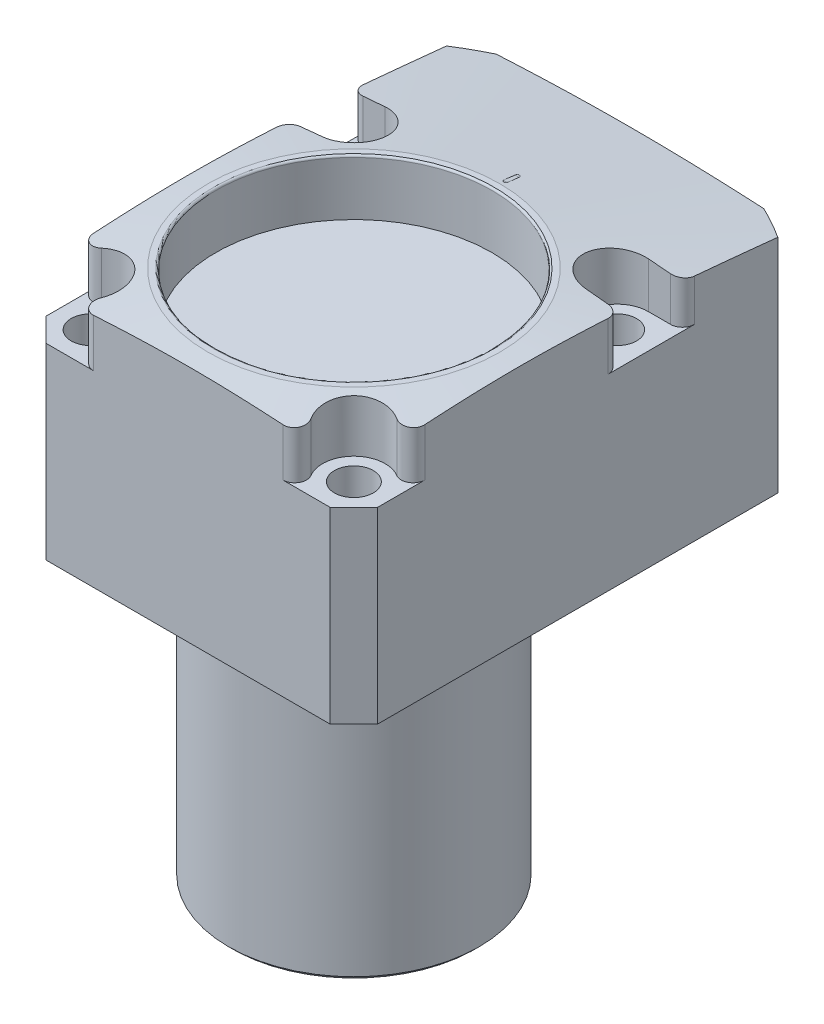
ISO-10303-21;
HEADER;
FILE_DESCRIPTION(('STEP AP214'),'2;1');
FILE_NAME('part.step','',(''),(''),'','','');
FILE_SCHEMA(('AUTOMOTIVE_DESIGN { 1 0 10303 214 1 1 1 1 }'));
ENDSEC;
DATA;
#1=APPLICATION_CONTEXT('core data for automotive mechanical design processes');
#2=APPLICATION_PROTOCOL_DEFINITION('international standard','automotive_design',2000,#1);
#3=PRODUCT_CONTEXT('',#1,'mechanical');
#4=PRODUCT('Part','Part','',(#3));
#5=PRODUCT_RELATED_PRODUCT_CATEGORY('part','',(#4));
#6=PRODUCT_DEFINITION_FORMATION('','',#4);
#7=PRODUCT_DEFINITION_CONTEXT('part definition',#1,'design');
#8=PRODUCT_DEFINITION('design','',#6,#7);
#9=PRODUCT_DEFINITION_SHAPE('','',#8);
#10=(LENGTH_UNIT() NAMED_UNIT(*) SI_UNIT(.MILLI.,.METRE.));
#11=(NAMED_UNIT(*) PLANE_ANGLE_UNIT() SI_UNIT($,.RADIAN.));
#12=(NAMED_UNIT(*) SI_UNIT($,.STERADIAN.) SOLID_ANGLE_UNIT());
#13=UNCERTAINTY_MEASURE_WITH_UNIT(LENGTH_MEASURE(1.E-05),#10,'distance_accuracy_value','');
#14=(GEOMETRIC_REPRESENTATION_CONTEXT(3) GLOBAL_UNCERTAINTY_ASSIGNED_CONTEXT((#13)) GLOBAL_UNIT_ASSIGNED_CONTEXT((#10,
#11,#12)) REPRESENTATION_CONTEXT('',''));
#15=CARTESIAN_POINT('',(0.,0.,0.));
#16=DIRECTION('',(0.,0.,1.));
#17=DIRECTION('',(1.,0.,0.));
#18=AXIS2_PLACEMENT_3D('',#15,#16,#17);
#19=CARTESIAN_POINT('',(0.,28.0774088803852,0.));
#20=DIRECTION('',(0.,-1.,0.));
#21=DIRECTION('',(0.,0.,-1.));
#22=AXIS2_PLACEMENT_3D('',#19,#20,#21);
#23=CONICAL_SURFACE('',#22,38.895,1.44862327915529);
#24=CARTESIAN_POINT('',(-0.159713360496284,30.4667739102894,-19.4345272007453));
#25=CARTESIAN_POINT('',(-0.170506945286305,30.467862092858,-19.4255756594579));
#26=CARTESIAN_POINT('',(-0.18051876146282,30.469063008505,-19.4157032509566));
#27=CARTESIAN_POINT('',(-0.198729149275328,30.4716515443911,-19.3944423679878));
#28=CARTESIAN_POINT('',(-0.206929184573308,30.4730390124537,-19.3830551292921));
#29=CARTESIAN_POINT('',(-0.221287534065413,30.4759643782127,-19.3590697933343));
#30=CARTESIAN_POINT('',(-0.227445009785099,30.4775023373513,-19.34647120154));
#31=CARTESIAN_POINT('',(-0.237543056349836,30.4806846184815,-19.3204303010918));
#32=CARTESIAN_POINT('',(-0.241484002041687,30.4823289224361,-19.306988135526));
#33=CARTESIAN_POINT('',(-0.247041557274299,30.4856791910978,-19.2796298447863));
#34=CARTESIAN_POINT('',(-0.248656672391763,30.4873851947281,-19.265713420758));
#35=CARTESIAN_POINT('',(-0.249513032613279,30.4908099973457,-19.2378072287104));
#36=CARTESIAN_POINT('',(-0.248753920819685,30.4925287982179,-19.22381744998));
#37=CARTESIAN_POINT('',(-0.244880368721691,30.4959318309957,-19.1961494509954));
#38=CARTESIAN_POINT('',(-0.241763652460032,30.4976160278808,-19.1824715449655));
#39=CARTESIAN_POINT('',(-0.233259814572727,30.5008997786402,-19.1558308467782));
#40=CARTESIAN_POINT('',(-0.227872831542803,30.5024993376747,-19.1428680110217));
#41=CARTESIAN_POINT('',(-0.214983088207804,30.5055669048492,-19.1180321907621));
#42=CARTESIAN_POINT('',(-0.207481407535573,30.5070349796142,-19.10615865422));
#43=CARTESIAN_POINT('',(-0.190572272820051,30.5097977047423,-19.0838330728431));
#44=CARTESIAN_POINT('',(-0.181164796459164,30.5110923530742,-19.0733810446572));
#45=CARTESIAN_POINT('',(-0.160729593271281,30.513467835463,-19.0542167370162));
#46=CARTESIAN_POINT('',(-0.149704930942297,30.514549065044,-19.0455012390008));
#47=CARTESIAN_POINT('',(-0.126334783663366,30.5164686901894,-19.03003615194));
#48=CARTESIAN_POINT('',(-0.113989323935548,30.5173070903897,-19.0232865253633));
#49=CARTESIAN_POINT('',(-0.0883595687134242,30.5187143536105,-19.011961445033));
#50=CARTESIAN_POINT('',(-0.0750775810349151,30.5192838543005,-19.0073808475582));
#51=CARTESIAN_POINT('',(-0.047926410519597,30.5201392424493,-19.0005020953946));
#52=CARTESIAN_POINT('',(-0.034057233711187,30.5204251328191,-18.9982039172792));
#53=CARTESIAN_POINT('',(-0.00615268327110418,30.5207044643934,-18.9959584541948));
#54=CARTESIAN_POINT('',(0.00788233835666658,30.5206984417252,-18.9960068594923));
#55=CARTESIAN_POINT('',(0.0357447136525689,30.520395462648,-18.9984424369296));
#56=CARTESIAN_POINT('',(0.04957206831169,30.5200985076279,-19.0008295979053));
#57=CARTESIAN_POINT('',(0.0766203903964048,30.5192227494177,-19.0078723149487));
#58=CARTESIAN_POINT('',(0.0898416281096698,30.5186440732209,-19.0125268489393));
#59=CARTESIAN_POINT('',(0.115310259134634,30.517222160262,-19.0239702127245));
#60=CARTESIAN_POINT('',(0.127557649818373,30.5163789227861,-19.0307590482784));
#61=CARTESIAN_POINT('',(0.150746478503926,30.5144517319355,-19.0462857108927));
#62=CARTESIAN_POINT('',(0.161686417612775,30.5133675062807,-19.0550257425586));
#63=CARTESIAN_POINT('',(0.181936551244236,30.5109907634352,-19.0742010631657));
#64=CARTESIAN_POINT('',(0.191246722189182,30.5096982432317,-19.0846363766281));
#65=CARTESIAN_POINT('',(0.207995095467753,30.5069395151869,-19.1069305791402));
#66=CARTESIAN_POINT('',(0.21542912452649,30.5054729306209,-19.1187925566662));
#67=CARTESIAN_POINT('',(0.228190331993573,30.5024108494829,-19.1435849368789));
#68=CARTESIAN_POINT('',(0.233517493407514,30.5008153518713,-19.1565153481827));
#69=CARTESIAN_POINT('',(0.24192605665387,30.4975374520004,-19.1831094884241));
#70=CARTESIAN_POINT('',(0.245002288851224,30.4958548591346,-19.1967748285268));
#71=CARTESIAN_POINT('',(0.248802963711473,30.4924542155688,-19.2244242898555));
#72=CARTESIAN_POINT('',(0.249527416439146,30.4907361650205,-19.2384084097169));
#73=CARTESIAN_POINT('',(0.248603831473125,30.4873111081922,-19.2663175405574));
#74=CARTESIAN_POINT('',(0.246952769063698,30.4856041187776,-19.2802424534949));
#75=CARTESIAN_POINT('',(0.241317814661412,30.4822512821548,-19.307622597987));
#76=CARTESIAN_POINT('',(0.237333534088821,30.4806054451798,-19.321077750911));
#77=CARTESIAN_POINT('',(0.227144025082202,30.4774213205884,-19.3471346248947));
#78=CARTESIAN_POINT('',(0.220938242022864,30.4758830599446,-19.3597361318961));
#79=CARTESIAN_POINT('',(0.206480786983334,30.4729583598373,-19.383716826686));
#80=CARTESIAN_POINT('',(0.198231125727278,30.4715717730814,-19.3950972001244));
#81=CARTESIAN_POINT('',(0.184597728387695,30.4696476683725,-19.4109013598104));
#82=CARTESIAN_POINT('',(0.179893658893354,30.4690373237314,-19.415916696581));
#83=CARTESIAN_POINT('',(0.17009228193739,30.4678672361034,-19.4255349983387));
#84=CARTESIAN_POINT('',(0.164995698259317,30.4673074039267,-19.4301386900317));
#85=CARTESIAN_POINT('',(0.159713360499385,30.4667739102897,-19.4345272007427));
#86=B_SPLINE_CURVE_WITH_KNOTS('',3,(#24,#25,#26,#27,#28,#29,#30,#31,#32,#33,#34,#35,#36,#37,#38,
#39,#40,#41,#42,#43,#44,#45,#46,#47,#48,#49,#50,#51,#52,#53,#54,#55,#56,#57,#58,#59,#60,#61,#62,
#63,#64,#65,#66,#67,#68,#69,#70,#71,#72,#73,#74,#75,#76,#77,#78,#79,#80,#81,#82,#83,#84,#85),
.UNSPECIFIED.,.F.,.F.,(4,2,2,2,2,2,2,2,2,2,2,2,2,2,2,2,2,2,2,2,2,2,2,2,2,2,2,2,2,2,4),(0.,
0.0421369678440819,0.0842397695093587,0.126359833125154,0.168472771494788,0.21061275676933,
0.252759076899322,0.294946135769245,0.33713061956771,0.379293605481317,0.42145708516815,
0.463541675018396,0.505625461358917,0.547608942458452,0.589591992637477,0.631497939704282,
0.673403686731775,0.715290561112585,0.757177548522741,0.799112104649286,0.841047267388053,
0.883074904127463,0.925102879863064,0.967227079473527,1.00935109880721,1.05152880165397,
1.09371353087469,1.13590879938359,1.17806272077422,1.19875197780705,1.21940395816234),.UNSPECIFIED.);
#87=CARTESIAN_POINT('',(-0.24920089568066,30.4900272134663,-19.2441870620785));
#88=VERTEX_POINT('',#87);
#89=CARTESIAN_POINT('',(0.249200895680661,30.4900272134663,-19.2441870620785));
#90=VERTEX_POINT('',#89);
#91=EDGE_CURVE('E13',#88,#90,#86,.T.);
#92=ORIENTED_EDGE('',*,*,#91,.F.);
#93=CARTESIAN_POINT('',(-0.249248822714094,30.2838194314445,-20.9237436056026));
#94=CARTESIAN_POINT('',(-0.249241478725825,30.3182909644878,-20.6429757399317));
#95=CARTESIAN_POINT('',(-0.249233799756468,30.3527623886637,-20.3622078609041));
#96=CARTESIAN_POINT('',(-0.249217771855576,30.4217050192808,-19.8006720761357));
#97=CARTESIAN_POINT('',(-0.249209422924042,30.456176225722,-19.5199041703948));
#98=CARTESIAN_POINT('',(-0.249200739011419,30.4906473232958,-19.2391362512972));
#99=B_SPLINE_CURVE_WITH_KNOTS('',3,(#93,#94,#95,#96,#97,#98),.UNSPECIFIED.,.F.,.F.,(4,2,4),(0.,
0.848628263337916,1.69725652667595),.UNSPECIFIED.);
#100=CARTESIAN_POINT('',(-0.249243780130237,30.3071883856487,-20.7334051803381));
#101=VERTEX_POINT('',#100);
#102=EDGE_CURVE('E295',#101,#88,#99,.T.);
#103=ORIENTED_EDGE('',*,*,#102,.F.);
#104=CARTESIAN_POINT('',(0.249191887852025,30.3078087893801,-20.7283526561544));
#105=CARTESIAN_POINT('',(0.249489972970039,30.3060948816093,-20.7423083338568));
#106=CARTESIAN_POINT('',(0.248580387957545,30.3043802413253,-20.7562853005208));
#107=CARTESIAN_POINT('',(0.244424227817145,30.3009978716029,-20.7838839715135));
#108=CARTESIAN_POINT('',(0.241179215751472,30.2993301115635,-20.7975059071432));
#109=CARTESIAN_POINT('',(0.232428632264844,30.2960866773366,-20.824022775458));
#110=CARTESIAN_POINT('',(0.226921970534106,30.2945110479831,-20.8369173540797));
#111=CARTESIAN_POINT('',(0.213807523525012,30.2914971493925,-20.861603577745));
#112=CARTESIAN_POINT('',(0.206200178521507,30.2900588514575,-20.8733954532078));
#113=CARTESIAN_POINT('',(0.189097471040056,30.2873595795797,-20.8955420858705));
#114=CARTESIAN_POINT('',(0.179602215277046,30.2860985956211,-20.9058969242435));
#115=CARTESIAN_POINT('',(0.158990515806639,30.2837889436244,-20.9248749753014));
#116=CARTESIAN_POINT('',(0.14787383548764,30.282740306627,-20.9334979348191));
#117=CARTESIAN_POINT('',(0.124361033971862,30.2808869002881,-20.9487458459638));
#118=CARTESIAN_POINT('',(0.111967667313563,30.280081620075,-20.955374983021));
#119=CARTESIAN_POINT('',(0.0862349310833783,30.2787344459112,-20.966468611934));
#120=CARTESIAN_POINT('',(0.0728956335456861,30.2781925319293,-20.970933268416));
#121=CARTESIAN_POINT('',(0.0456768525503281,30.2773879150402,-20.9775632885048));
#122=CARTESIAN_POINT('',(0.0317984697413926,30.2771246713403,-20.9797331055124));
#123=CARTESIAN_POINT('',(0.0038714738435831,30.2768828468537,-20.9817263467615));
#124=CARTESIAN_POINT('',(-0.0101771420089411,30.2769042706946,-20.9815497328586));
#125=CARTESIAN_POINT('',(-0.0380302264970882,30.2772310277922,-20.9788565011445));
#126=CARTESIAN_POINT('',(-0.0518349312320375,30.2775360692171,-20.9763422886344));
#127=CARTESIAN_POINT('',(-0.0788232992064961,30.2784211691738,-20.969049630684));
#128=CARTESIAN_POINT('',(-0.0920069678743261,30.2790012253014,-20.9642712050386));
#129=CARTESIAN_POINT('',(-0.11738489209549,30.2804205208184,-20.9525850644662));
#130=CARTESIAN_POINT('',(-0.129578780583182,30.2812598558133,-20.9456765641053));
#131=CARTESIAN_POINT('',(-0.15262724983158,30.2831743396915,-20.9299286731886));
#132=CARTESIAN_POINT('',(-0.16348185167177,30.2842494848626,-20.9210893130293));
#133=CARTESIAN_POINT('',(-0.183561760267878,30.2866075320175,-20.9017172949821));
#134=CARTESIAN_POINT('',(-0.192784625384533,30.2878907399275,-20.8911821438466));
#135=CARTESIAN_POINT('',(-0.209324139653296,30.2906284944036,-20.8687246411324));
#136=CARTESIAN_POINT('',(-0.21664037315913,30.2920830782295,-20.8568019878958));
#137=CARTESIAN_POINT('',(-0.229175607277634,30.2951265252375,-20.8318796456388));
#138=CARTESIAN_POINT('',(-0.234389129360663,30.2967157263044,-20.8188772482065));
#139=CARTESIAN_POINT('',(-0.24254159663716,30.2999800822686,-20.7921960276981));
#140=CARTESIAN_POINT('',(-0.245483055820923,30.3016551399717,-20.7785179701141));
#141=CARTESIAN_POINT('',(-0.248022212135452,30.3040876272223,-20.758675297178));
#142=CARTESIAN_POINT('',(-0.24857010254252,30.3048305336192,-20.7526178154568));
#143=CARTESIAN_POINT('',(-0.249216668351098,30.3063185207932,-20.7404905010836));
#144=CARTESIAN_POINT('',(-0.249316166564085,30.3070635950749,-20.7344207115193));
#145=CARTESIAN_POINT('',(-0.249191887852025,30.3078087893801,-20.7283526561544));
#146=B_SPLINE_CURVE_WITH_KNOTS('',3,(#104,#105,#106,#107,#108,#109,#110,#111,#112,#113,#114,
#115,#116,#117,#118,#119,#120,#121,#122,#123,#124,#125,#126,#127,#128,#129,#130,#131,#132,#133,
#134,#135,#136,#137,#138,#139,#140,#141,#142,#143,#144,#145),.UNSPECIFIED.,.F.,.F.,(4,2,2,2,2,2,
2,2,2,2,2,2,2,2,2,2,2,2,2,2,4),(0.,0.0421354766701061,0.0842427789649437,0.126370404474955,
0.168489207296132,0.21060563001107,0.25272820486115,0.294761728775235,0.336792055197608,
0.378740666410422,0.420689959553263,0.462596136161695,0.504501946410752,0.546423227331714,
0.588343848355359,0.630326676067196,0.67231864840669,0.714419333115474,0.756473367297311,
0.774842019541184,0.79317695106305),.UNSPECIFIED.);
#147=CARTESIAN_POINT('',(0.249243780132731,30.3071883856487,-20.7334051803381));
#148=VERTEX_POINT('',#147);
#149=EDGE_CURVE('E290',#148,#101,#146,.T.);
#150=ORIENTED_EDGE('',*,*,#149,.F.);
#151=CARTESIAN_POINT('',(0.249200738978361,30.4906473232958,-19.2391362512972));
#152=CARTESIAN_POINT('',(0.249209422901,30.456176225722,-19.5199041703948));
#153=CARTESIAN_POINT('',(0.249217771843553,30.4217050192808,-19.8006720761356));
#154=CARTESIAN_POINT('',(0.249233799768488,30.3527623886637,-20.3622078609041));
#155=CARTESIAN_POINT('',(0.24924147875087,30.3182909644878,-20.6429757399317));
#156=CARTESIAN_POINT('',(0.249248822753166,30.2838194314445,-20.9237436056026));
#157=B_SPLINE_CURVE_WITH_KNOTS('',3,(#151,#152,#153,#154,#155,#156),.UNSPECIFIED.,.F.,.F.,(4,2,
4),(0.,0.848628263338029,1.69725652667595),.UNSPECIFIED.);
#158=EDGE_CURVE('E55',#90,#148,#157,.T.);
#159=ORIENTED_EDGE('',*,*,#158,.F.);
#160=EDGE_LOOP('',(#92,#103,#150,#159));
#161=FACE_BOUND('',#160,.T.);
#162=CARTESIAN_POINT('',(26.9396508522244,28.68487629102,-20.6565500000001));
#163=CARTESIAN_POINT('',(26.1281539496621,28.7639276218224,-20.6565500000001));
#164=CARTESIAN_POINT('',(25.3165306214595,28.8417053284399,-20.6565500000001));
#165=CARTESIAN_POINT('',(23.6929848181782,28.9941337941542,-20.6565500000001));
#166=CARTESIAN_POINT('',(22.8810623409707,29.0687845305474,-20.6565500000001));
#167=CARTESIAN_POINT('',(21.2570355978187,29.2143645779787,-20.6565500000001));
#168=CARTESIAN_POINT('',(20.4449313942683,29.2852945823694,-20.6565500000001));
#169=CARTESIAN_POINT('',(18.8203452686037,29.4227159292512,-20.6565500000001));
#170=CARTESIAN_POINT('',(18.0078633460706,29.4892072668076,-20.65655));
#171=CARTESIAN_POINT('',(16.3823829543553,29.6168958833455,-20.65655));
#172=CARTESIAN_POINT('',(15.5693844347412,29.6780925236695,-20.65655));
#173=CARTESIAN_POINT('',(13.9429422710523,29.7941745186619,-20.65655));
#174=CARTESIAN_POINT('',(13.1294986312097,29.8490599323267,-20.65655));
#175=CARTESIAN_POINT('',(11.5019905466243,29.9513941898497,-20.65655));
#176=CARTESIAN_POINT('',(10.6879260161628,29.9988416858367,-20.65655));
#177=CARTESIAN_POINT('',(9.05931243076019,30.0850799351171,-20.65655));
#178=CARTESIAN_POINT('',(8.24476336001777,30.1238703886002,-20.65655));
#179=CARTESIAN_POINT('',(7.42999479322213,30.1577265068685,-20.65655));
#180=B_SPLINE_CURVE_WITH_KNOTS('',3,(#162,#163,#164,#165,#166,#167,#168,#169,#170,#171,#172,
#173,#174,#175,#176,#177,#178,#179),.UNSPECIFIED.,.F.,.F.,(4,2,2,2,2,2,2,2,4),(0.,
2.44601701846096,4.89205179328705,7.33762912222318,9.78320917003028,12.2290837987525,
14.6749355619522,17.1212300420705,19.5676092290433),.UNSPECIFIED.);
#181=CARTESIAN_POINT('',(19.4999999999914,29.3652048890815,-20.6565500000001));
#182=VERTEX_POINT('',#181);
#183=CARTESIAN_POINT('',(16.6877999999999,29.5925525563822,-20.65655));
#184=VERTEX_POINT('',#183);
#185=EDGE_CURVE('E1266',#182,#184,#180,.T.);
#186=ORIENTED_EDGE('',*,*,#185,.F.);
#187=CARTESIAN_POINT('',(19.5,29.3652048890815,-20.6565500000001));
#188=CARTESIAN_POINT('',(19.542420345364,29.3616294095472,-20.656550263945));
#189=CARTESIAN_POINT('',(19.5848058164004,29.3578899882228,-20.6583505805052));
#190=CARTESIAN_POINT('',(19.6692417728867,29.350111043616,-20.6655254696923));
#191=CARTESIAN_POINT('',(19.7112922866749,29.3460715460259,-20.6708997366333));
#192=CARTESIAN_POINT('',(19.8363996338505,29.3335591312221,-20.692318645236));
#193=CARTESIAN_POINT('',(19.9185715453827,29.3246788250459,-20.7136596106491));
#194=CARTESIAN_POINT('',(20.0780536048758,29.3061229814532,-20.7698223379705));
#195=CARTESIAN_POINT('',(20.1553622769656,29.2964472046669,-20.8046481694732));
#196=CARTESIAN_POINT('',(20.3029786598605,29.2765889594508,-20.886765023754));
#197=CARTESIAN_POINT('',(20.3732870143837,29.2664065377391,-20.9340548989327));
#198=CARTESIAN_POINT('',(20.5052305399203,29.2457850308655,-21.0399914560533));
#199=CARTESIAN_POINT('',(20.5668257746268,29.235345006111,-21.0986876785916));
#200=CARTESIAN_POINT('',(20.6792482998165,29.2145460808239,-21.2256561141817));
#201=CARTESIAN_POINT('',(20.7300732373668,29.204187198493,-21.2939304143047));
#202=CARTESIAN_POINT('',(20.8195868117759,29.1838185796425,-21.4382731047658));
#203=CARTESIAN_POINT('',(20.8582481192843,29.1738096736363,-21.5143585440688));
#204=CARTESIAN_POINT('',(20.9221320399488,29.1544420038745,-21.672026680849));
#205=CARTESIAN_POINT('',(20.9473640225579,29.1450827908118,-21.7536055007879));
#206=CARTESIAN_POINT('',(20.9769648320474,29.1305546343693,-21.8892143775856));
#207=CARTESIAN_POINT('',(20.985595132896,29.1251121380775,-21.9423225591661));
#208=CARTESIAN_POINT('',(20.9971113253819,29.114649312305,-22.0491220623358));
#209=CARTESIAN_POINT('',(21.0000053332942,29.1096283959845,-22.1028124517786));
#210=CARTESIAN_POINT('',(21.,29.1048399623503,-22.1565499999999));
#211=B_SPLINE_CURVE_WITH_KNOTS('',3,(#187,#188,#189,#190,#191,#192,#193,#194,#195,#196,#197,
#198,#199,#200,#201,#202,#203,#204,#205,#206,#207,#208,#209,#210),.UNSPECIFIED.,.F.,.F.,(4,2,2,
2,2,2,2,2,2,2,2,4),(0.,0.127632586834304,0.255254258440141,0.510024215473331,0.76487111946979,
1.01969456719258,1.27565056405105,1.53166242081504,1.78824544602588,2.04464922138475,
2.20660109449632,2.36832365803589),.UNSPECIFIED.);
#212=CARTESIAN_POINT('',(21.,29.1048399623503,-22.15655));
#213=VERTEX_POINT('',#212);
#214=EDGE_CURVE('E1337',#182,#213,#211,.T.);
#215=ORIENTED_EDGE('',*,*,#214,.T.);
#216=CARTESIAN_POINT('',(21.,24.7240708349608,-62.786948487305));
#217=CARTESIAN_POINT('',(21.,24.8930746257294,-61.3354643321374));
#218=CARTESIAN_POINT('',(21.,25.061521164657,-59.8839149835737));
#219=CARTESIAN_POINT('',(21.,25.3969972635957,-56.9806513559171));
#220=CARTESIAN_POINT('',(21.,25.564026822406,-55.5289370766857));
#221=CARTESIAN_POINT('',(21.,25.8963450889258,-52.6254959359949));
#222=CARTESIAN_POINT('',(21.,26.0616340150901,-51.1737690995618));
#223=CARTESIAN_POINT('',(21.,26.3900723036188,-48.2700733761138));
#224=CARTESIAN_POINT('',(21.,26.5532216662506,-46.8181044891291));
#225=CARTESIAN_POINT('',(21.,26.8768702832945,-43.9134916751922));
#226=CARTESIAN_POINT('',(21.,27.0373688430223,-42.4608476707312));
#227=CARTESIAN_POINT('',(21.,27.35492437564,-39.5551826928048));
#228=CARTESIAN_POINT('',(21.,27.5119813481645,-38.1021617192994));
#229=CARTESIAN_POINT('',(21.,27.8216489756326,-35.1954398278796));
#230=CARTESIAN_POINT('',(21.,27.9742590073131,-33.7417388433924));
#231=CARTESIAN_POINT('',(21.,28.2735803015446,-30.8337262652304));
#232=CARTESIAN_POINT('',(21.,28.4202915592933,-29.3794146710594));
#233=CARTESIAN_POINT('',(21.,28.7060669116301,-26.467304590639));
#234=CARTESIAN_POINT('',(21.,28.8451162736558,-25.0095046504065));
#235=CARTESIAN_POINT('',(21.,29.1124076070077,-22.0929043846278));
#236=CARTESIAN_POINT('',(21.,29.2406495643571,-20.6341040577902));
#237=CARTESIAN_POINT('',(21.,29.4822787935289,-17.7155945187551));
#238=CARTESIAN_POINT('',(21.,29.5956694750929,-16.2558855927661));
#239=CARTESIAN_POINT('',(21.,29.8022275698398,-13.3350026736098));
#240=CARTESIAN_POINT('',(21.,29.895394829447,-11.8738286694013));
#241=CARTESIAN_POINT('',(21.,30.0548785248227,-8.94907378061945));
#242=CARTESIAN_POINT('',(21.,30.1211787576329,-7.48549197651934));
#243=CARTESIAN_POINT('',(21.,30.1955165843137,-5.28929796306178));
#244=CARTESIAN_POINT('',(21.,30.216110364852,-4.55710320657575));
#245=CARTESIAN_POINT('',(21.,30.2483296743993,-3.09251315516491));
#246=CARTESIAN_POINT('',(21.,30.259955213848,-2.36011786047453));
#247=CARTESIAN_POINT('',(21.,30.2738552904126,-0.895188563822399));
#248=CARTESIAN_POINT('',(21.,30.2761291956,-0.162654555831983));
#249=CARTESIAN_POINT('',(21.,30.2712496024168,1.30238277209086));
#250=CARTESIAN_POINT('',(21.,30.2640960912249,2.0348860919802));
#251=CARTESIAN_POINT('',(21.,30.240598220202,3.49974221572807));
#252=CARTESIAN_POINT('',(21.,30.2242538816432,4.23209501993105));
#253=CARTESIAN_POINT('',(21.,30.1828885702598,5.69654894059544));
#254=CARTESIAN_POINT('',(21.,30.1578676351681,6.42865005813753));
#255=CARTESIAN_POINT('',(21.,30.0872158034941,8.21154785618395));
#256=CARTESIAN_POINT('',(21.,30.0373551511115,9.26217732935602));
#257=CARTESIAN_POINT('',(21.,29.9236776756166,11.3626895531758));
#258=CARTESIAN_POINT('',(21.,29.859860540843,12.4125722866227));
#259=CARTESIAN_POINT('',(21.,29.7207661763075,14.5116699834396));
#260=CARTESIAN_POINT('',(21.,29.6454878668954,15.5608848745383));
#261=CARTESIAN_POINT('',(21.,29.485706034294,17.6585993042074));
#262=CARTESIAN_POINT('',(21.,29.4012025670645,18.7070988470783));
#263=CARTESIAN_POINT('',(21.,29.2247997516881,20.8038588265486));
#264=CARTESIAN_POINT('',(21.,29.1328977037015,21.8521190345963));
#265=CARTESIAN_POINT('',(21.,28.9432207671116,23.9481064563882));
#266=CARTESIAN_POINT('',(21.,28.8454458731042,24.9958336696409));
#267=CARTESIAN_POINT('',(21.,28.6452055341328,27.0907872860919));
#268=CARTESIAN_POINT('',(21.,28.5427403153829,28.1380137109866));
#269=CARTESIAN_POINT('',(21.,28.334032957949,30.2320885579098));
#270=CARTESIAN_POINT('',(21.,28.2277908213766,31.2789369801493));
#271=CARTESIAN_POINT('',(21.,28.0120686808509,33.3740415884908));
#272=CARTESIAN_POINT('',(21.,27.9025836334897,34.4222972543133));
#273=CARTESIAN_POINT('',(21.,27.681100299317,36.5185433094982));
#274=CARTESIAN_POINT('',(21.,27.5691020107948,37.5665336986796));
#275=CARTESIAN_POINT('',(21.,27.2300218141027,40.710188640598));
#276=CARTESIAN_POINT('',(21.,26.999856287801,42.8055204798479));
#277=CARTESIAN_POINT('',(21.,26.5338756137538,46.995097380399));
#278=CARTESIAN_POINT('',(21.,26.2980616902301,49.0893425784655));
#279=CARTESIAN_POINT('',(21.,25.822322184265,53.2773593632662));
#280=CARTESIAN_POINT('',(21.,25.5823966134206,55.3711309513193));
#281=CARTESIAN_POINT('',(21.,25.0982245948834,59.5694426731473));
#282=CARTESIAN_POINT('',(21.,24.8539619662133,61.6739809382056));
#283=CARTESIAN_POINT('',(21.,24.3631054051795,65.8827857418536));
#284=CARTESIAN_POINT('',(21.,24.1165114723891,67.9870522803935));
#285=CARTESIAN_POINT('',(21.,23.3740247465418,74.2998285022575));
#286=CARTESIAN_POINT('',(21.,22.8754607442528,78.50802386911));
#287=CARTESIAN_POINT('',(21.,21.8752178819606,86.9126408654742));
#288=CARTESIAN_POINT('',(21.,21.3735509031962,91.1090639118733));
#289=CARTESIAN_POINT('',(21.,20.6188191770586,97.4032791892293));
#290=CARTESIAN_POINT('',(21.,20.3668790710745,99.5012063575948));
#291=CARTESIAN_POINT('',(21.,19.8623655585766,103.696984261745));
#292=CARTESIAN_POINT('',(21.,19.6097921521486,105.794834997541));
#293=CARTESIAN_POINT('',(21.,19.3569602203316,107.892654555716));
#294=B_SPLINE_CURVE_WITH_KNOTS('',3,(#216,#217,#218,#219,#220,#221,#222,#223,#224,#225,#226,
#227,#228,#229,#230,#231,#232,#233,#234,#235,#236,#237,#238,#239,#240,#241,#242,#243,#244,#245,
#246,#247,#248,#249,#250,#251,#252,#253,#254,#255,#256,#257,#258,#259,#260,#261,#262,#263,#264,
#265,#266,#267,#268,#269,#270,#271,#272,#273,#274,#275,#276,#277,#278,#279,#280,#281,#282,#283,
#284,#285,#286,#287,#288,#289,#290,#291,#292,#293),.UNSPECIFIED.,.F.,.F.,(4,2,2,2,2,2,2,2,2,2,2,
2,2,2,2,2,2,2,2,2,2,2,2,2,2,2,2,2,2,2,2,2,2,2,2,2,2,2,4),(0.,4.38387042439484,8.76774456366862,
13.1510617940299,17.5343784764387,21.918826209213,26.303274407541,30.6883341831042,
35.0733975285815,39.4666177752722,43.8598437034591,48.2520592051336,52.6443080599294,
57.0392018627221,59.2366079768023,61.4340115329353,63.6315635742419,65.8291186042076,
68.026668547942,70.2242089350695,73.3795260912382,76.5349137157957,79.6905987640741,
82.8462646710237,86.0030873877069,89.1599130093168,92.3165865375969,95.4732583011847,
98.635127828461,101.79699950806,108.12079259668,114.443227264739,120.765644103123,
127.121640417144,133.477637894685,146.190511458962,158.869418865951,165.208421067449,
171.547422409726),.UNSPECIFIED.);
#295=CARTESIAN_POINT('',(21.,28.0774088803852,-32.7386778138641));
#296=VERTEX_POINT('',#295);
#297=EDGE_CURVE('E1183',#213,#296,#294,.F.);
#298=ORIENTED_EDGE('',*,*,#297,.T.);
#299=CARTESIAN_POINT('',(0.,28.0774088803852,0.));
#300=DIRECTION('',(0.,-1.,0.));
#301=DIRECTION('',(0.,0.,-1.));
#302=AXIS2_PLACEMENT_3D('',#299,#300,#301);
#303=CIRCLE('',#302,38.895);
#304=CARTESIAN_POINT('',(16.9652888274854,28.0774088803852,-35.));
#305=VERTEX_POINT('',#304);
#306=EDGE_CURVE('E1127',#305,#296,#303,.T.);
#307=ORIENTED_EDGE('',*,*,#306,.F.);
#308=CARTESIAN_POINT('',(-54.0775632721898,24.943860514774,-35.));
#309=CARTESIAN_POINT('',(-52.4797887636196,25.1085156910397,-35.));
#310=CARTESIAN_POINT('',(-50.8817990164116,25.2711179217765,-35.));
#311=CARTESIAN_POINT('',(-47.6852864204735,25.5911377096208,-35.));
#312=CARTESIAN_POINT('',(-46.0867635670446,25.7485552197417,-35.));
#313=CARTESIAN_POINT('',(-42.8888016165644,26.0571536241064,-35.));
#314=CARTESIAN_POINT('',(-41.2893624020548,26.2083333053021,-35.));
#315=CARTESIAN_POINT('',(-38.0897751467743,26.5029912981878,-35.));
#316=CARTESIAN_POINT('',(-36.4896271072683,26.6464696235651,-35.));
#317=CARTESIAN_POINT('',(-33.2910558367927,26.9237343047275,-35.));
#318=CARTESIAN_POINT('',(-31.6926339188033,27.0575357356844,-35.));
#319=CARTESIAN_POINT('',(-28.4948529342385,27.31352082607,-35.));
#320=CARTESIAN_POINT('',(-26.895493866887,27.4357044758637,-35.));
#321=CARTESIAN_POINT('',(-23.6957807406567,27.6658348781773,-35.));
#322=CARTESIAN_POINT('',(-22.0954267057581,27.7737819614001,-35.));
#323=CARTESIAN_POINT('',(-18.893637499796,27.9724288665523,-35.));
#324=CARTESIAN_POINT('',(-17.2922023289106,28.0631286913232,-35.));
#325=CARTESIAN_POINT('',(-14.0846520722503,28.2242300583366,-35.));
#326=CARTESIAN_POINT('',(-12.4785346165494,28.2945850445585,-35.));
#327=CARTESIAN_POINT('',(-9.2654294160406,28.4116107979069,-35.));
#328=CARTESIAN_POINT('',(-7.65844167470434,28.4582816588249,-35.));
#329=CARTESIAN_POINT('',(-4.44406180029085,28.5255142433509,-35.));
#330=CARTESIAN_POINT('',(-2.83666971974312,28.5460784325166,-35.));
#331=CARTESIAN_POINT('',(0.378233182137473,28.5599319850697,-35.));
#332=CARTESIAN_POINT('',(1.98574400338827,28.5532213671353,-35.));
#333=CARTESIAN_POINT('',(5.20165926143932,28.5129004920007,-35.));
#334=CARTESIAN_POINT('',(6.81006343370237,28.4792695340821,-35.));
#335=CARTESIAN_POINT('',(10.0261452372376,28.3869330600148,-35.));
#336=CARTESIAN_POINT('',(11.6338228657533,28.3282274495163,-35.));
#337=CARTESIAN_POINT('',(14.8483993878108,28.1885730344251,-35.));
#338=CARTESIAN_POINT('',(16.4552981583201,28.1076214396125,-35.));
#339=CARTESIAN_POINT('',(19.6680147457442,27.9267265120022,-35.));
#340=CARTESIAN_POINT('',(21.2738325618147,27.8267831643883,-35.));
#341=CARTESIAN_POINT('',(24.4610427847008,27.612660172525,-35.));
#342=CARTESIAN_POINT('',(26.0424506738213,27.4987087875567,-35.));
#343=CARTESIAN_POINT('',(29.2043119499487,27.2581901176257,-35.));
#344=CARTESIAN_POINT('',(30.7847653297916,27.1316227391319,-35.));
#345=CARTESIAN_POINT('',(33.9448537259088,26.8681920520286,-35.));
#346=CARTESIAN_POINT('',(35.5244887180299,26.7313284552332,-35.));
#347=CARTESIAN_POINT('',(38.6830031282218,26.4492189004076,-35.));
#348=CARTESIAN_POINT('',(40.2618825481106,26.3039729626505,-35.));
#349=CARTESIAN_POINT('',(43.4191495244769,26.0066261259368,-35.));
#350=CARTESIAN_POINT('',(44.9975370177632,25.8545245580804,-35.));
#351=CARTESIAN_POINT('',(48.1537608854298,25.5447133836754,-35.));
#352=CARTESIAN_POINT('',(49.7315972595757,25.387003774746,-35.));
#353=CARTESIAN_POINT('',(52.8867732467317,25.0669655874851,-35.));
#354=CARTESIAN_POINT('',(54.4641128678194,24.9046370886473,-35.));
#355=CARTESIAN_POINT('',(57.6183924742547,24.5761389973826,-35.));
#356=CARTESIAN_POINT('',(59.1953324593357,24.4099694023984,-35.));
#357=CARTESIAN_POINT('',(63.9189950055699,23.9073850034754,-35.));
#358=CARTESIAN_POINT('',(67.0652114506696,23.5662140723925,-35.));
#359=CARTESIAN_POINT('',(73.3566636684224,22.8748459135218,-35.));
#360=CARTESIAN_POINT('',(76.501899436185,22.5246486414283,-35.));
#361=CARTESIAN_POINT('',(82.7905041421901,21.8177475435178,-35.));
#362=CARTESIAN_POINT('',(85.9338733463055,21.4610460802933,-35.));
#363=CARTESIAN_POINT('',(90.6484859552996,20.9222578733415,-35.));
#364=CARTESIAN_POINT('',(92.219943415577,20.7420398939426,-35.));
#365=CARTESIAN_POINT('',(95.3627316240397,20.3805058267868,-35.));
#366=CARTESIAN_POINT('',(96.9340623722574,20.199189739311,-35.));
#367=CARTESIAN_POINT('',(98.5053381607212,20.0173984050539,-35.));
#368=B_SPLINE_CURVE_WITH_KNOTS('',3,(#308,#309,#310,#311,#312,#313,#314,#315,#316,#317,#318,
#319,#320,#321,#322,#323,#324,#325,#326,#327,#328,#329,#330,#331,#332,#333,#334,#335,#336,#337,
#338,#339,#340,#341,#342,#343,#344,#345,#346,#347,#348,#349,#350,#351,#352,#353,#354,#355,#356,
#357,#358,#359,#360,#361,#362,#363,#364,#365,#366,#367),.UNSPECIFIED.,.F.,.F.,(4,2,2,2,2,2,2,2,
2,2,2,2,2,2,2,2,2,2,2,2,2,2,2,2,2,2,2,2,2,4),(0.,4.81871272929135,9.63746911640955,
14.457158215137,19.2768387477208,24.0888415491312,28.9008483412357,33.7127433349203,
38.5246375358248,43.3474574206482,48.1702582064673,52.9926034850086,57.8149454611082,
62.6409992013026,67.4670711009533,72.2937485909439,77.120429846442,81.876893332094,
86.6333920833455,91.3900240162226,96.1466444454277,100.903729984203,105.660817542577,
110.41782327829,115.174832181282,124.668792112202,134.162798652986,143.653422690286,
148.398695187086,153.143966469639),.UNSPECIFIED.);
#369=CARTESIAN_POINT('',(-16.9652888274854,28.0774088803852,-35.));
#370=VERTEX_POINT('',#369);
#371=EDGE_CURVE('E1190',#305,#370,#368,.F.);
#372=ORIENTED_EDGE('',*,*,#371,.T.);
#373=CARTESIAN_POINT('',(-21.,28.0774088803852,-32.7386778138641));
#374=VERTEX_POINT('',#373);
#375=EDGE_CURVE('E1126',#374,#370,#303,.T.);
#376=ORIENTED_EDGE('',*,*,#375,.F.);
#377=CARTESIAN_POINT('',(-21.,24.7240708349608,-62.786948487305));
#378=CARTESIAN_POINT('',(-21.,24.8930746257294,-61.3354643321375));
#379=CARTESIAN_POINT('',(-21.,25.061521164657,-59.8839149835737));
#380=CARTESIAN_POINT('',(-21.,25.3969972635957,-56.9806513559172));
#381=CARTESIAN_POINT('',(-21.,25.564026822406,-55.5289370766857));
#382=CARTESIAN_POINT('',(-21.,25.8963450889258,-52.6254959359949));
#383=CARTESIAN_POINT('',(-21.,26.0616340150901,-51.1737690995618));
#384=CARTESIAN_POINT('',(-21.,26.3900723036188,-48.2700733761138));
#385=CARTESIAN_POINT('',(-21.,26.5532216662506,-46.8181044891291));
#386=CARTESIAN_POINT('',(-21.,26.8768702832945,-43.9134916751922));
#387=CARTESIAN_POINT('',(-21.,27.0373688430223,-42.4608476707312));
#388=CARTESIAN_POINT('',(-21.,27.35492437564,-39.5551826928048));
#389=CARTESIAN_POINT('',(-21.,27.5119813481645,-38.1021617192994));
#390=CARTESIAN_POINT('',(-21.,27.8216489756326,-35.1954398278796));
#391=CARTESIAN_POINT('',(-21.,27.9742590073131,-33.7417388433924));
#392=CARTESIAN_POINT('',(-21.,28.2735803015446,-30.8337262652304));
#393=CARTESIAN_POINT('',(-21.,28.4202915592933,-29.3794146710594));
#394=CARTESIAN_POINT('',(-21.,28.7060669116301,-26.467304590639));
#395=CARTESIAN_POINT('',(-21.,28.8451162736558,-25.0095046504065));
#396=CARTESIAN_POINT('',(-21.,29.1124076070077,-22.0929043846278));
#397=CARTESIAN_POINT('',(-21.,29.2406495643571,-20.6341040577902));
#398=CARTESIAN_POINT('',(-21.,29.4822787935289,-17.7155945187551));
#399=CARTESIAN_POINT('',(-21.,29.5956694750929,-16.2558855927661));
#400=CARTESIAN_POINT('',(-21.,29.8022275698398,-13.3350026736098));
#401=CARTESIAN_POINT('',(-21.,29.895394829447,-11.8738286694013));
#402=CARTESIAN_POINT('',(-21.,30.0548785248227,-8.94907378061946));
#403=CARTESIAN_POINT('',(-21.,30.1211787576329,-7.48549197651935));
#404=CARTESIAN_POINT('',(-21.,30.1955165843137,-5.28929796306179));
#405=CARTESIAN_POINT('',(-21.,30.216110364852,-4.55710320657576));
#406=CARTESIAN_POINT('',(-21.,30.2483296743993,-3.09251315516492));
#407=CARTESIAN_POINT('',(-21.,30.259955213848,-2.36011786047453));
#408=CARTESIAN_POINT('',(-21.,30.2738552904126,-0.895188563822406));
#409=CARTESIAN_POINT('',(-21.,30.2761291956,-0.162654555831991));
#410=CARTESIAN_POINT('',(-21.,30.2712496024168,1.30238277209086));
#411=CARTESIAN_POINT('',(-21.,30.2640960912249,2.0348860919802));
#412=CARTESIAN_POINT('',(-21.,30.240598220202,3.49974221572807));
#413=CARTESIAN_POINT('',(-21.,30.2242538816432,4.23209501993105));
#414=CARTESIAN_POINT('',(-21.,30.1828885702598,5.69654894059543));
#415=CARTESIAN_POINT('',(-21.,30.1578676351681,6.42865005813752));
#416=CARTESIAN_POINT('',(-21.,30.0872158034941,8.21154785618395));
#417=CARTESIAN_POINT('',(-21.,30.0373551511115,9.26217732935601));
#418=CARTESIAN_POINT('',(-21.,29.9236776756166,11.3626895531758));
#419=CARTESIAN_POINT('',(-21.,29.859860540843,12.4125722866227));
#420=CARTESIAN_POINT('',(-21.,29.7207661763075,14.5116699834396));
#421=CARTESIAN_POINT('',(-21.,29.6454878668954,15.5608848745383));
#422=CARTESIAN_POINT('',(-21.,29.485706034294,17.6585993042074));
#423=CARTESIAN_POINT('',(-21.,29.4012025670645,18.7070988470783));
#424=CARTESIAN_POINT('',(-21.,29.2247997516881,20.8038588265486));
#425=CARTESIAN_POINT('',(-21.,29.1328977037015,21.8521190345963));
#426=CARTESIAN_POINT('',(-21.,28.9432207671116,23.9481064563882));
#427=CARTESIAN_POINT('',(-21.,28.8454458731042,24.9958336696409));
#428=CARTESIAN_POINT('',(-21.,28.6452055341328,27.0907872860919));
#429=CARTESIAN_POINT('',(-21.,28.5427403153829,28.1380137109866));
#430=CARTESIAN_POINT('',(-21.,28.334032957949,30.2320885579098));
#431=CARTESIAN_POINT('',(-21.,28.2277908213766,31.2789369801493));
#432=CARTESIAN_POINT('',(-21.,28.0120686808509,33.3740415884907));
#433=CARTESIAN_POINT('',(-21.,27.9025836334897,34.4222972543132));
#434=CARTESIAN_POINT('',(-21.,27.681100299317,36.5185433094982));
#435=CARTESIAN_POINT('',(-21.,27.5691020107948,37.5665336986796));
#436=CARTESIAN_POINT('',(-21.,27.2300218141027,40.7101886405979));
#437=CARTESIAN_POINT('',(-21.,26.999856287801,42.8055204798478));
#438=CARTESIAN_POINT('',(-21.,26.5338756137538,46.9950973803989));
#439=CARTESIAN_POINT('',(-21.,26.2980616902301,49.0893425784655));
#440=CARTESIAN_POINT('',(-21.,25.822322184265,53.2773593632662));
#441=CARTESIAN_POINT('',(-21.,25.5823966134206,55.3711309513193));
#442=CARTESIAN_POINT('',(-21.,25.0982245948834,59.5694426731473));
#443=CARTESIAN_POINT('',(-21.,24.8539619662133,61.6739809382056));
#444=CARTESIAN_POINT('',(-21.,24.3631054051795,65.8827857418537));
#445=CARTESIAN_POINT('',(-21.,24.1165114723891,67.9870522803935));
#446=CARTESIAN_POINT('',(-21.,23.3740247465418,74.2998285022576));
#447=CARTESIAN_POINT('',(-21.,22.8754607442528,78.5080238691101));
#448=CARTESIAN_POINT('',(-21.,21.8752178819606,86.9126408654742));
#449=CARTESIAN_POINT('',(-21.,21.3735509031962,91.1090639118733));
#450=CARTESIAN_POINT('',(-21.,20.6188191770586,97.4032791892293));
#451=CARTESIAN_POINT('',(-21.,20.3668790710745,99.5012063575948));
#452=CARTESIAN_POINT('',(-21.,19.8623655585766,103.696984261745));
#453=CARTESIAN_POINT('',(-21.,19.6097921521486,105.79483499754));
#454=CARTESIAN_POINT('',(-21.,19.3569602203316,107.892654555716));
#455=B_SPLINE_CURVE_WITH_KNOTS('',3,(#377,#378,#379,#380,#381,#382,#383,#384,#385,#386,#387,
#388,#389,#390,#391,#392,#393,#394,#395,#396,#397,#398,#399,#400,#401,#402,#403,#404,#405,#406,
#407,#408,#409,#410,#411,#412,#413,#414,#415,#416,#417,#418,#419,#420,#421,#422,#423,#424,#425,
#426,#427,#428,#429,#430,#431,#432,#433,#434,#435,#436,#437,#438,#439,#440,#441,#442,#443,#444,
#445,#446,#447,#448,#449,#450,#451,#452,#453,#454),.UNSPECIFIED.,.F.,.F.,(4,2,2,2,2,2,2,2,2,2,2,
2,2,2,2,2,2,2,2,2,2,2,2,2,2,2,2,2,2,2,2,2,2,2,2,2,2,2,4),(0.,4.38387042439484,8.76774456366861,
13.1510617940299,17.5343784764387,21.918826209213,26.303274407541,30.6883341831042,
35.0733975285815,39.4666177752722,43.8598437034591,48.2520592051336,52.6443080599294,
57.0392018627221,59.2366079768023,61.4340115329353,63.6315635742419,65.8291186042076,
68.0266685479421,70.2242089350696,73.3795260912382,76.5349137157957,79.6905987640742,
82.8462646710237,86.0030873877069,89.1599130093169,92.316586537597,95.4732583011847,
98.635127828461,101.79699950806,108.12079259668,114.443227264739,120.765644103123,
127.121640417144,133.477637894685,146.190511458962,158.869418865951,165.208421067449,
171.547422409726),.UNSPECIFIED.);
#456=CARTESIAN_POINT('',(-21.,29.1048399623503,-22.15655));
#457=VERTEX_POINT('',#456);
#458=EDGE_CURVE('E1105',#374,#457,#455,.T.);
#459=ORIENTED_EDGE('',*,*,#458,.T.);
#460=CARTESIAN_POINT('',(-21.,29.1048399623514,-22.15655));
#461=CARTESIAN_POINT('',(-20.9999997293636,29.1086224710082,-22.114105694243));
#462=CARTESIAN_POINT('',(-20.9981973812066,29.1125490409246,-22.0716952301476));
#463=CARTESIAN_POINT('',(-20.991013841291,29.1206671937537,-21.9872074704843));
#464=CARTESIAN_POINT('',(-20.9856329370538,29.1248587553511,-21.9451301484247));
#465=CARTESIAN_POINT('',(-20.9641860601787,29.1377814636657,-21.8199384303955));
#466=CARTESIAN_POINT('',(-20.9428157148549,29.1468746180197,-21.7377073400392));
#467=CARTESIAN_POINT('',(-20.8865698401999,29.1657685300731,-21.5781076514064));
#468=CARTESIAN_POINT('',(-20.8516899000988,29.175569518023,-21.5007406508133));
#469=CARTESIAN_POINT('',(-20.7694413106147,29.1956166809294,-21.3530200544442));
#470=CARTESIAN_POINT('',(-20.7220739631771,29.2058628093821,-21.2826657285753));
#471=CARTESIAN_POINT('',(-20.6159937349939,29.2265589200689,-21.1506897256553));
#472=CARTESIAN_POINT('',(-20.5572380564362,29.2370095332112,-21.089102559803));
#473=CARTESIAN_POINT('',(-20.4301440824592,29.2577840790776,-20.9767074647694));
#474=CARTESIAN_POINT('',(-20.3618036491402,29.2681079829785,-20.9259019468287));
#475=CARTESIAN_POINT('',(-20.2173577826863,29.2883435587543,-20.8364630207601));
#476=CARTESIAN_POINT('',(-20.1412389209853,29.2982544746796,-20.7978511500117));
#477=CARTESIAN_POINT('',(-19.9835050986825,29.3173432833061,-20.7340708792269));
#478=CARTESIAN_POINT('',(-19.9018941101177,29.3265216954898,-20.7088928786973));
#479=CARTESIAN_POINT('',(-19.7664289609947,29.3406397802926,-20.6794281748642));
#480=CARTESIAN_POINT('',(-19.7135010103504,29.3458894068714,-20.6708569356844));
#481=CARTESIAN_POINT('',(-19.6070643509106,29.3559148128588,-20.659419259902));
#482=CARTESIAN_POINT('',(-19.5535565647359,29.360691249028,-20.6565448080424));
#483=CARTESIAN_POINT('',(-19.5,29.3652048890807,-20.65655));
#484=B_SPLINE_CURVE_WITH_KNOTS('',3,(#460,#461,#462,#463,#464,#465,#466,#467,#468,#469,#470,
#471,#472,#473,#474,#475,#476,#477,#478,#479,#480,#481,#482,#483),.UNSPECIFIED.,.F.,.F.,(4,2,2,
2,2,2,2,2,2,2,2,4),(0.,0.127757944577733,0.255505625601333,0.510534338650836,0.765646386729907,
1.02073184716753,1.27679519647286,1.53291575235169,1.78948619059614,2.04587302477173,
2.20721094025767,2.3683216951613),.UNSPECIFIED.);
#485=CARTESIAN_POINT('',(-19.5,29.3652048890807,-20.6565500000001));
#486=VERTEX_POINT('',#485);
#487=EDGE_CURVE('E483',#457,#486,#484,.T.);
#488=ORIENTED_EDGE('',*,*,#487,.T.);
#489=CARTESIAN_POINT('',(-10.7534568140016,29.9937102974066,-20.65655));
#490=CARTESIAN_POINT('',(-11.5675269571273,29.9475377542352,-20.65655));
#491=CARTESIAN_POINT('',(-12.3813548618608,29.897287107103,-20.65655));
#492=CARTESIAN_POINT('',(-14.008527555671,29.7897447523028,-20.65655));
#493=CARTESIAN_POINT('',(-14.8218723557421,29.7324532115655,-20.65655));
#494=CARTESIAN_POINT('',(-16.448026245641,29.6119487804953,-20.65655));
#495=CARTESIAN_POINT('',(-17.2608353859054,29.5487365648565,-20.65655));
#496=CARTESIAN_POINT('',(-18.8860552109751,29.4173355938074,-20.65655));
#497=CARTESIAN_POINT('',(-19.6984658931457,29.3491468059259,-20.6565500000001));
#498=CARTESIAN_POINT('',(-21.3228630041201,29.2086141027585,-20.6565500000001));
#499=CARTESIAN_POINT('',(-22.134849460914,29.1362705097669,-20.6565500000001));
#500=CARTESIAN_POINT('',(-23.7585029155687,28.9881015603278,-20.6565500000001));
#501=CARTESIAN_POINT('',(-24.5701699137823,28.9122762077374,-20.6565500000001));
#502=CARTESIAN_POINT('',(-26.1933206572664,28.7577014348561,-20.6565500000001));
#503=CARTESIAN_POINT('',(-27.0048043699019,28.6789516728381,-20.6565500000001));
#504=CARTESIAN_POINT('',(-28.6275252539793,28.5189817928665,-20.6565500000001));
#505=CARTESIAN_POINT('',(-29.4387624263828,28.4377616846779,-20.6565500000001));
#506=CARTESIAN_POINT('',(-30.2498954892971,28.3555287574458,-20.6565500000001));
#507=B_SPLINE_CURVE_WITH_KNOTS('',3,(#489,#490,#491,#492,#493,#494,#495,#496,#497,#498,#499,
#500,#501,#502,#503,#504,#505,#506),.UNSPECIFIED.,.F.,.F.,(4,2,2,2,2,2,2,2,4),(0.,
2.44610949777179,4.89216101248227,7.33793412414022,9.78372319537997,12.229322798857,
14.6749196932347,17.1208032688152,19.5666771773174),.UNSPECIFIED.);
#508=CARTESIAN_POINT('',(-16.6877999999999,29.5925525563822,-20.65655));
#509=VERTEX_POINT('',#508);
#510=EDGE_CURVE('E1236',#509,#486,#507,.T.);
#511=ORIENTED_EDGE('',*,*,#510,.F.);
#512=CARTESIAN_POINT('',(-16.6879999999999,30.276792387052,-12.7190500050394));
#513=CARTESIAN_POINT('',(-16.5770719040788,30.2876260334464,-12.7190340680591));
#514=CARTESIAN_POINT('',(-16.4661091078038,30.2980760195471,-12.7236895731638));
#515=CARTESIAN_POINT('',(-16.2448849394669,30.3181071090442,-12.742283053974));
#516=CARTESIAN_POINT('',(-16.1346235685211,30.3276882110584,-12.756221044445));
#517=CARTESIAN_POINT('',(-15.9156136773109,30.3458765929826,-12.7933122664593));
#518=CARTESIAN_POINT('',(-15.8068646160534,30.3544842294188,-12.8164621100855));
#519=CARTESIAN_POINT('',(-15.5916470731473,30.3706338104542,-12.8718088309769));
#520=CARTESIAN_POINT('',(-15.4851785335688,30.3781757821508,-12.9040054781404));
#521=CARTESIAN_POINT('',(-15.1701749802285,30.3990789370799,-13.0139524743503));
#522=CARTESIAN_POINT('',(-14.9660040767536,30.410720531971,-13.1050663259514));
#523=CARTESIAN_POINT('',(-14.5758250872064,30.4288103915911,-13.3202741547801));
#524=CARTESIAN_POINT('',(-14.3898108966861,30.4352604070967,-13.444356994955));
#525=CARTESIAN_POINT('',(-14.0422248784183,30.4426363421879,-13.7211639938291));
#526=CARTESIAN_POINT('',(-13.8805071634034,30.443596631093,-13.8737037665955));
#527=CARTESIAN_POINT('',(-13.5847712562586,30.4400331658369,-14.2035941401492));
#528=CARTESIAN_POINT('',(-13.4507574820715,30.4355085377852,-14.380948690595));
#529=CARTESIAN_POINT('',(-13.2146106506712,30.4212254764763,-14.754758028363));
#530=CARTESIAN_POINT('',(-13.1123778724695,30.4114836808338,-14.9511504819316));
#531=CARTESIAN_POINT('',(-12.9420040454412,30.3872474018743,-15.3579087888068));
#532=CARTESIAN_POINT('',(-12.8738612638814,30.3727531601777,-15.5682739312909));
#533=CARTESIAN_POINT('',(-12.7731669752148,30.3395847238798,-15.9981588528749));
#534=CARTESIAN_POINT('',(-12.7407965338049,30.3208898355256,-16.2177194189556));
#535=CARTESIAN_POINT('',(-12.7130052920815,30.2801499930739,-16.658861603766));
#536=CARTESIAN_POINT('',(-12.7175871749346,30.2581047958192,-16.8804433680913));
#537=CARTESIAN_POINT('',(-12.763650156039,30.2112930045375,-17.3215636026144));
#538=CARTESIAN_POINT('',(-12.8054757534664,30.186502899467,-17.5410636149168));
#539=CARTESIAN_POINT('',(-12.9252152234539,30.135250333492,-17.9697816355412));
#540=CARTESIAN_POINT('',(-13.0031305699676,30.1087878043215,-18.178999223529));
#541=CARTESIAN_POINT('',(-13.1935762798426,30.0548245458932,-18.5829560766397));
#542=CARTESIAN_POINT('',(-13.3063745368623,30.0273172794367,-18.7775682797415));
#543=CARTESIAN_POINT('',(-13.5631292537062,29.9722833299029,-19.1449667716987));
#544=CARTESIAN_POINT('',(-13.7070849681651,29.9447566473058,-19.317753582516));
#545=CARTESIAN_POINT('',(-14.0227008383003,29.890333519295,-19.6371553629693));
#546=CARTESIAN_POINT('',(-14.1944391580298,29.8634391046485,-19.7836939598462));
#547=CARTESIAN_POINT('',(-14.468711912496,29.8241722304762,-19.9801160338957));
#548=CARTESIAN_POINT('',(-14.5629848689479,29.8112538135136,-20.0417270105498));
#549=CARTESIAN_POINT('',(-14.7564554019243,29.7858463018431,-20.1567370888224));
#550=CARTESIAN_POINT('',(-14.8556511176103,29.7733570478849,-20.2101392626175));
#551=CARTESIAN_POINT('',(-15.0581674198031,29.7488928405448,-20.3082875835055));
#552=CARTESIAN_POINT('',(-15.1614838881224,29.7369173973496,-20.3530421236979));
#553=CARTESIAN_POINT('',(-15.3715639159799,29.7135390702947,-20.4336174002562));
#554=CARTESIAN_POINT('',(-15.4783261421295,29.7021359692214,-20.4694415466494));
#555=CARTESIAN_POINT('',(-15.6944468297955,29.6799736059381,-20.5318688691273));
#556=CARTESIAN_POINT('',(-15.8038023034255,29.6692136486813,-20.5584821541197));
#557=CARTESIAN_POINT('',(-16.02439793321,29.6483862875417,-20.6023256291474));
#558=CARTESIAN_POINT('',(-16.1356371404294,29.6383185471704,-20.6195604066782));
#559=CARTESIAN_POINT('',(-16.3205864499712,29.6222769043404,-20.6402110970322));
#560=CARTESIAN_POINT('',(-16.3939856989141,29.6160902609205,-20.6463440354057));
#561=CARTESIAN_POINT('',(-16.5409163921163,29.6040581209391,-20.6545125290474));
#562=CARTESIAN_POINT('',(-16.614447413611,29.5982120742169,-20.6565548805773));
#563=CARTESIAN_POINT('',(-16.6879999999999,29.5925371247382,-20.6565499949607));
#564=B_SPLINE_CURVE_WITH_KNOTS('',3,(#512,#513,#514,#515,#516,#517,#518,#519,#520,#521,#522,
#523,#524,#525,#526,#527,#528,#529,#530,#531,#532,#533,#534,#535,#536,#537,#538,#539,#540,#541,
#542,#543,#544,#545,#546,#547,#548,#549,#550,#551,#552,#553,#554,#555,#556,#557,#558,#559,#560,
#561,#562,#563),.UNSPECIFIED.,.F.,.F.,(4,2,2,2,2,2,2,2,2,2,2,2,2,2,2,2,2,2,2,2,2,2,2,2,2,4),(0.,
0.33426341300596,0.668527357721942,1.00266848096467,1.33680110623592,2.00495193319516,
2.67287734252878,3.3366164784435,4.00046137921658,4.66220176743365,5.32390851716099,
5.98894944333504,6.65403865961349,7.32534451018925,7.99667778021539,8.67330046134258,
9.34990695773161,10.0284512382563,10.3681948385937,10.7078109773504,11.0470958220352,
11.3862509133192,11.7250325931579,12.0636484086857,12.2852853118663,12.506553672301),.UNSPECIFIED.);
#565=CARTESIAN_POINT('',(-16.6877999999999,30.2768119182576,-12.7190500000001));
#566=VERTEX_POINT('',#565);
#567=EDGE_CURVE('E1163',#566,#509,#564,.T.);
#568=ORIENTED_EDGE('',*,*,#567,.F.);
#569=CARTESIAN_POINT('',(-30.1793880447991,28.831906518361,-12.7190500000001));
#570=CARTESIAN_POINT('',(-29.3693070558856,28.9235497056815,-12.7190500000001));
#571=CARTESIAN_POINT('',(-28.5591664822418,29.0146711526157,-12.7190500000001));
#572=CARTESIAN_POINT('',(-26.9387330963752,29.1955488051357,-12.7190500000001));
#573=CARTESIAN_POINT('',(-26.1284402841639,29.2853050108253,-12.7190500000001));
#574=CARTESIAN_POINT('',(-24.5077163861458,29.4631252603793,-12.7190500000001));
#575=CARTESIAN_POINT('',(-23.697285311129,29.5511894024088,-12.7190500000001));
#576=CARTESIAN_POINT('',(-22.0761932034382,29.7251737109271,-12.7190500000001));
#577=CARTESIAN_POINT('',(-21.2655321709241,29.8110938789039,-12.7190500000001));
#578=CARTESIAN_POINT('',(-19.643874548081,29.9801850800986,-12.7190500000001));
#579=CARTESIAN_POINT('',(-18.83287794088,30.063355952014,-12.7190500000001));
#580=CARTESIAN_POINT('',(-17.210528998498,30.2261054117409,-12.7190500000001));
#581=CARTESIAN_POINT('',(-16.3991766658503,30.3056840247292,-12.7190500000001));
#582=CARTESIAN_POINT('',(-14.7759688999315,30.4601074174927,-12.7190500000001));
#583=CARTESIAN_POINT('',(-13.9641134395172,30.5349519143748,-12.7190500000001));
#584=CARTESIAN_POINT('',(-12.7459012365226,30.642471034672,-12.7190500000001));
#585=CARTESIAN_POINT('',(-12.3397541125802,30.6775198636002,-12.7190500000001));
#586=CARTESIAN_POINT('',(-11.5273028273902,30.7457740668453,-12.7190500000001));
#587=CARTESIAN_POINT('',(-11.1209986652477,30.7789794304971,-12.7190500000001));
#588=CARTESIAN_POINT('',(-10.7146096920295,30.8111325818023,-12.7190500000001));
#589=B_SPLINE_CURVE_WITH_KNOTS('',3,(#569,#570,#571,#572,#573,#574,#575,#576,#577,#578,#579,
#580,#581,#582,#583,#584,#585,#586,#587,#588),.UNSPECIFIED.,.F.,.F.,(4,2,2,2,2,2,2,2,2,4),(0.,
2.44574536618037,4.89149054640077,7.33709340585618,9.78269456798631,12.2284389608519,
14.6741662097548,17.1200394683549,18.343005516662,19.5659786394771),.UNSPECIFIED.);
#590=CARTESIAN_POINT('',(-19.5000000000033,29.9945161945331,-12.7190500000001));
#591=VERTEX_POINT('',#590);
#592=EDGE_CURVE('E1230',#591,#566,#589,.T.);
#593=ORIENTED_EDGE('',*,*,#592,.F.);
#594=CARTESIAN_POINT('',(-19.5,29.9945161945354,-12.7190500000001));
#595=CARTESIAN_POINT('',(-19.5421115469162,29.9901853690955,-12.7190496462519));
#596=CARTESIAN_POINT('',(-19.5842150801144,29.9859702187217,-12.7172754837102));
#597=CARTESIAN_POINT('',(-19.6681477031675,29.9777937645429,-12.7101911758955));
#598=CARTESIAN_POINT('',(-19.7099767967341,29.9738324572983,-12.7048810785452));
#599=CARTESIAN_POINT('',(-19.8345495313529,29.9623736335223,-12.6836841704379));
#600=CARTESIAN_POINT('',(-19.9164986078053,29.9552888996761,-12.6625306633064));
#601=CARTESIAN_POINT('',(-20.0757827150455,29.9424160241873,-12.6067135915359));
#602=CARTESIAN_POINT('',(-20.1531147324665,29.9366287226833,-12.5720413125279));
#603=CARTESIAN_POINT('',(-20.3009104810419,29.926498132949,-12.4901415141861));
#604=CARTESIAN_POINT('',(-20.3713760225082,29.9221544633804,-12.4429173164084));
#605=CARTESIAN_POINT('',(-20.5030883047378,29.9150362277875,-12.3374857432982));
#606=CARTESIAN_POINT('',(-20.5643766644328,29.9122544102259,-12.2793308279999));
#607=CARTESIAN_POINT('',(-20.6763710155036,29.908297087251,-12.1535247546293));
#608=CARTESIAN_POINT('',(-20.7270751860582,29.9071218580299,-12.0858719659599));
#609=CARTESIAN_POINT('',(-20.8162334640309,29.9064090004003,-11.9433223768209));
#610=CARTESIAN_POINT('',(-20.8547379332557,29.9068645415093,-11.8684570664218));
#611=CARTESIAN_POINT('',(-20.9186815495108,29.9093876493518,-11.7133843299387));
#612=CARTESIAN_POINT('',(-20.9441277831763,29.9114543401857,-11.6331798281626));
#613=CARTESIAN_POINT('',(-20.9750995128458,29.9161976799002,-11.496931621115));
#614=CARTESIAN_POINT('',(-20.9844339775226,29.9184439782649,-11.441707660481));
#615=CARTESIAN_POINT('',(-20.9968838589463,29.9236008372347,-11.3306735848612));
#616=CARTESIAN_POINT('',(-21.0000081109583,29.9265104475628,-11.2748644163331));
#617=CARTESIAN_POINT('',(-21.,29.9297403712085,-11.21905));
#618=B_SPLINE_CURVE_WITH_KNOTS('',3,(#594,#595,#596,#597,#598,#599,#600,#601,#602,#603,#604,
#605,#606,#607,#608,#609,#610,#611,#612,#613,#614,#615,#616,#617),.UNSPECIFIED.,.F.,.F.,(4,2,2,
2,2,2,2,2,2,2,2,4),(0.,0.126924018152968,0.253846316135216,0.507333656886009,0.760984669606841,
1.01456862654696,1.2669652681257,1.51940529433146,1.77078921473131,2.02203656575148,
2.18986402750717,2.3574525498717),.UNSPECIFIED.);
#619=CARTESIAN_POINT('',(-21.,29.9297403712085,-11.21905));
#620=VERTEX_POINT('',#619);
#621=EDGE_CURVE('E476',#591,#620,#618,.T.);
#622=ORIENTED_EDGE('',*,*,#621,.T.);
#623=CARTESIAN_POINT('',(-21.,29.8835033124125,11.9975166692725));
#624=VERTEX_POINT('',#623);
#625=EDGE_CURVE('E1114',#620,#624,#455,.T.);
#626=ORIENTED_EDGE('',*,*,#625,.T.);
#627=CARTESIAN_POINT('',(-21.,29.8835033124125,11.9975166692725));
#628=CARTESIAN_POINT('',(-20.999999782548,29.8809498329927,12.0394406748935));
#629=CARTESIAN_POINT('',(-20.9982412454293,29.8785741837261,12.0813557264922));
#630=CARTESIAN_POINT('',(-20.9912206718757,29.8741905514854,12.1649094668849));
#631=CARTESIAN_POINT('',(-20.9859587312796,29.8721825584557,12.2065481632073));
#632=CARTESIAN_POINT('',(-20.9649588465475,29.8667334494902,12.3305386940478));
#633=CARTESIAN_POINT('',(-20.9440067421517,29.8638593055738,12.4120950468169));
#634=CARTESIAN_POINT('',(-20.8887517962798,29.8597053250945,12.5706017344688));
#635=CARTESIAN_POINT('',(-20.8544414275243,29.8584263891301,12.6475494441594));
#636=CARTESIAN_POINT('',(-20.7734423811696,29.8574946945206,12.7946282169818));
#637=CARTESIAN_POINT('',(-20.7267566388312,29.8578415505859,12.8647608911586));
#638=CARTESIAN_POINT('',(-20.622432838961,29.860150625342,12.9960990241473));
#639=CARTESIAN_POINT('',(-20.5648147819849,29.8621099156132,13.0573204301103));
#640=CARTESIAN_POINT('',(-20.4402083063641,29.8675919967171,13.1692779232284));
#641=CARTESIAN_POINT('',(-20.3732182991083,29.8711150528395,13.2200122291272));
#642=CARTESIAN_POINT('',(-20.2316980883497,29.8796433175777,13.3096302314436));
#643=CARTESIAN_POINT('',(-20.1571583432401,29.8846504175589,13.3484986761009));
#644=CARTESIAN_POINT('',(-20.0027411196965,29.8960204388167,13.413235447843));
#645=CARTESIAN_POINT('',(-19.9228641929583,29.9023832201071,13.4391051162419));
#646=CARTESIAN_POINT('',(-19.7596336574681,29.9163399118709,13.4772629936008));
#647=CARTESIAN_POINT('',(-19.6762653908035,29.9239395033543,13.4894863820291));
#648=CARTESIAN_POINT('',(-19.5087228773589,29.9401604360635,13.4998380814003));
#649=CARTESIAN_POINT('',(-19.4245483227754,29.9487821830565,13.4979607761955));
#650=CARTESIAN_POINT('',(-19.2571859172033,29.9668888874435,13.4801426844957));
#651=CARTESIAN_POINT('',(-19.1740096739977,29.9763796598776,13.4640998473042));
#652=CARTESIAN_POINT('',(-19.0116718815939,29.9959156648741,13.4183000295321));
#653=CARTESIAN_POINT('',(-18.932504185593,30.0059599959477,13.388564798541));
#654=CARTESIAN_POINT('',(-18.8346337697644,30.019064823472,13.3420899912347));
#655=CARTESIAN_POINT('',(-18.8130264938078,30.0220040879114,13.3311788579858));
#656=CARTESIAN_POINT('',(-18.770400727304,30.027895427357,13.3083433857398));
#657=CARTESIAN_POINT('',(-18.7493813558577,30.030847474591,13.296420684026));
#658=CARTESIAN_POINT('',(-18.7286537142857,30.0338060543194,13.2839943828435));
#659=B_SPLINE_CURVE_WITH_KNOTS('',3,(#627,#628,#629,#630,#631,#632,#633,#634,#635,#636,#637,
#638,#639,#640,#641,#642,#643,#644,#645,#646,#647,#648,#649,#650,#651,#652,#653,#654,#655,#656,
#657,#658),.UNSPECIFIED.,.F.,.F.,(4,2,2,2,2,2,2,2,2,2,2,2,2,2,2,4),(0.,0.125928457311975,
0.251853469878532,0.503317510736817,0.754923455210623,1.00646977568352,1.25756025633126,
1.50869335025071,1.76014789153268,2.01157648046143,2.26419435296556,2.51691284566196,
2.77146695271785,3.02561810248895,3.09875084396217,3.17176739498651),.UNSPECIFIED.);
#660=CARTESIAN_POINT('',(-18.7286537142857,30.0338060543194,13.2839943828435));
#661=VERTEX_POINT('',#660);
#662=EDGE_CURVE('E1614',#624,#661,#659,.T.);
#663=ORIENTED_EDGE('',*,*,#662,.T.);
#664=CARTESIAN_POINT('',(-13.8816699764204,29.9146623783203,19.4943300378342));
#665=CARTESIAN_POINT('',(-13.8021792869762,29.9282710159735,19.4148652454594));
#666=CARTESIAN_POINT('',(-13.7260911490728,29.9419739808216,19.3320212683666));
#667=CARTESIAN_POINT('',(-13.5812195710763,29.9694738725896,19.1601959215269));
#668=CARTESIAN_POINT('',(-13.5124358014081,29.9832707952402,19.0712148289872));
#669=CARTESIAN_POINT('',(-13.3827012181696,30.0108575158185,18.8877797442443));
#670=CARTESIAN_POINT('',(-13.321746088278,30.0246473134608,18.7933288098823));
#671=CARTESIAN_POINT('',(-13.2080655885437,30.0521222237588,18.5996196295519));
#672=CARTESIAN_POINT('',(-13.1553401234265,30.0658073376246,18.5003614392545));
#673=CARTESIAN_POINT('',(-13.0100580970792,30.1065661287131,18.1962927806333));
#674=CARTESIAN_POINT('',(-12.9303427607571,30.1333545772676,17.9851129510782));
#675=CARTESIAN_POINT('',(-12.807811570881,30.1852217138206,17.5522756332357));
#676=CARTESIAN_POINT('',(-12.764987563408,30.2103007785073,17.3306204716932));
#677=CARTESIAN_POINT('',(-12.7175171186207,30.2578208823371,16.8834023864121));
#678=CARTESIAN_POINT('',(-12.7127936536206,30.280267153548,16.6578482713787));
#679=CARTESIAN_POINT('',(-12.7416370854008,30.3216850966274,16.2088472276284));
#680=CARTESIAN_POINT('',(-12.7752083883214,30.340656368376,15.9854005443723));
#681=CARTESIAN_POINT('',(-12.8794366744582,30.3741626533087,15.5487966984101));
#682=CARTESIAN_POINT('',(-12.9498079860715,30.3887304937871,15.3355738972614));
#683=CARTESIAN_POINT('',(-13.1255805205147,30.4129411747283,14.9238074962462));
#684=CARTESIAN_POINT('',(-13.2309774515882,30.42258461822,14.7252621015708));
#685=CARTESIAN_POINT('',(-13.4726852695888,30.436403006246,14.3504351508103));
#686=CARTESIAN_POINT('',(-13.608694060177,30.4406288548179,14.1739606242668));
#687=CARTESIAN_POINT('',(-13.9083140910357,30.4435659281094,13.8461928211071));
#688=CARTESIAN_POINT('',(-14.0719248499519,30.442277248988,13.694899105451));
#689=CARTESIAN_POINT('',(-14.421092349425,30.4342730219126,13.422562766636));
#690=CARTESIAN_POINT('',(-14.6065264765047,30.4275866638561,13.301362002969));
#691=CARTESIAN_POINT('',(-14.9947468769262,30.4091550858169,13.0915189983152));
#692=CARTESIAN_POINT('',(-15.1975332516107,30.3974098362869,13.002876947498));
#693=CARTESIAN_POINT('',(-15.6152961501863,30.3693748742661,12.8603257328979));
#694=CARTESIAN_POINT('',(-15.8303050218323,30.3530726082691,12.806513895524));
#695=CARTESIAN_POINT('',(-16.265944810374,30.3166584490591,12.7353660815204));
#696=CARTESIAN_POINT('',(-16.486575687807,30.2965465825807,12.7180298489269));
#697=CARTESIAN_POINT('',(-16.9292599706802,30.2531396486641,12.7201719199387));
#698=CARTESIAN_POINT('',(-17.1513093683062,30.2298187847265,12.7399669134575));
#699=CARTESIAN_POINT('',(-17.5887952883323,30.1809957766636,12.8162959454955));
#700=CARTESIAN_POINT('',(-17.8042293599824,30.1554928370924,12.8728434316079));
#701=CARTESIAN_POINT('',(-18.2245668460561,30.1029085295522,13.0218168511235));
#702=CARTESIAN_POINT('',(-18.4293519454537,30.0758145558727,13.1145757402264));
#703=CARTESIAN_POINT('',(-18.7222647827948,30.0348484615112,13.2783296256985));
#704=CARTESIAN_POINT('',(-18.8175083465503,30.0211415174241,13.3370034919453));
#705=CARTESIAN_POINT('',(-19.0026928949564,29.9937040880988,13.4621669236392));
#706=CARTESIAN_POINT('',(-19.0926364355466,29.9799736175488,13.5286526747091));
#707=CARTESIAN_POINT('',(-19.2345663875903,29.9576268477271,13.6431405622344));
#708=CARTESIAN_POINT('',(-19.2883424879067,29.9489876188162,13.6889430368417));
#709=CARTESIAN_POINT('',(-19.393292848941,29.9317745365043,13.7832769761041));
#710=CARTESIAN_POINT('',(-19.4444712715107,29.9232005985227,13.8318037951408));
#711=CARTESIAN_POINT('',(-19.4943300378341,29.9146623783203,13.8816699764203));
#712=B_SPLINE_CURVE_WITH_KNOTS('',3,(#664,#665,#666,#667,#668,#669,#670,#671,#672,#673,#674,
#675,#676,#677,#678,#679,#680,#681,#682,#683,#684,#685,#686,#687,#688,#689,#690,#691,#692,#693,
#694,#695,#696,#697,#698,#699,#700,#701,#702,#703,#704,#705,#706,#707,#708,#709,#710,#711),
.UNSPECIFIED.,.F.,.F.,(4,2,2,2,2,2,2,2,2,2,2,2,2,2,2,2,2,2,2,2,2,2,2,4),(0.,0.339547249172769,
0.679079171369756,1.01842308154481,1.35776306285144,2.03616802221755,2.71442299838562,
3.39130640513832,4.0682677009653,4.74005021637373,5.41175044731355,6.07709194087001,
6.74242183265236,7.40417762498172,8.06593728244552,8.72953820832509,9.39313447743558,
10.062416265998,10.7319430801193,11.4077768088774,11.7455665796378,12.0831920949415,
12.2965950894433,12.5096446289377),.UNSPECIFIED.);
#713=CARTESIAN_POINT('',(-13.2839943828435,30.0338060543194,18.7286537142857));
#714=VERTEX_POINT('',#713);
#715=EDGE_CURVE('E1156',#714,#661,#712,.T.);
#716=ORIENTED_EDGE('',*,*,#715,.F.);
#717=CARTESIAN_POINT('',(-13.2839943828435,30.0338060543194,18.7286537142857));
#718=CARTESIAN_POINT('',(-13.3057975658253,30.0286152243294,18.7650186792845));
#719=CARTESIAN_POINT('',(-13.3260493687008,30.0234436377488,18.8022927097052));
#720=CARTESIAN_POINT('',(-13.3633297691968,30.0131695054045,18.8784269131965));
#721=CARTESIAN_POINT('',(-13.3803584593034,30.0080669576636,18.9172870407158));
#722=CARTESIAN_POINT('',(-13.4263886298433,29.9929221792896,19.0357928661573));
#723=CARTESIAN_POINT('',(-13.4503949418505,29.9830283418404,19.1174654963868));
#724=CARTESIAN_POINT('',(-13.4842788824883,29.9639214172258,19.2837742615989));
#725=CARTESIAN_POINT('',(-13.4941486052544,29.9547087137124,19.3684120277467));
#726=CARTESIAN_POINT('',(-13.4994315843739,29.9372079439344,19.5382242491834));
#727=CARTESIAN_POINT('',(-13.4948486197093,29.9289196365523,19.6233985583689));
#728=CARTESIAN_POINT('',(-13.4713519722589,29.913510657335,19.7915294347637));
#729=CARTESIAN_POINT('',(-13.4524914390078,29.9063857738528,19.8744930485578));
#730=CARTESIAN_POINT('',(-13.4009900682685,29.8934473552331,20.0361518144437));
#731=CARTESIAN_POINT('',(-13.3683473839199,29.8876339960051,20.1148463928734));
#732=CARTESIAN_POINT('',(-13.2904442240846,29.8775024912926,20.2651507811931));
#733=CARTESIAN_POINT('',(-13.2452700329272,29.8731745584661,20.33680465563));
#734=CARTESIAN_POINT('',(-13.1434827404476,29.8660691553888,20.471539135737));
#735=CARTESIAN_POINT('',(-13.0868715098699,29.863291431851,20.5346211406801));
#736=CARTESIAN_POINT('',(-12.9641796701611,29.85936654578,20.6500506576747));
#737=CARTESIAN_POINT('',(-12.8981563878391,29.8582099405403,20.7024588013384));
#738=CARTESIAN_POINT('',(-12.758237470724,29.8575256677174,20.7955166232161));
#739=CARTESIAN_POINT('',(-12.68433889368,29.8579986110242,20.8361618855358));
#740=CARTESIAN_POINT('',(-12.5309729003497,29.860559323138,20.9044439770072));
#741=CARTESIAN_POINT('',(-12.451516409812,29.8626440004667,20.9321055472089));
#742=CARTESIAN_POINT('',(-12.2892308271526,29.8683726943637,20.9737352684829));
#743=CARTESIAN_POINT('',(-12.2064078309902,29.8720139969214,20.987727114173));
#744=CARTESIAN_POINT('',(-12.1022428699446,29.8774781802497,20.9964878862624));
#745=CARTESIAN_POINT('',(-12.0812990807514,29.878621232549,20.9978057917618));
#746=CARTESIAN_POINT('',(-12.0394106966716,29.880995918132,20.9995606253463));
#747=CARTESIAN_POINT('',(-12.0184661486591,29.8822274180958,20.9999988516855));
#748=CARTESIAN_POINT('',(-11.9975166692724,29.8835033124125,21.));
#749=B_SPLINE_CURVE_WITH_KNOTS('',3,(#717,#718,#719,#720,#721,#722,#723,#724,#725,#726,#727,
#728,#729,#730,#731,#732,#733,#734,#735,#736,#737,#738,#739,#740,#741,#742,#743,#744,#745,#746,
#747,#748),.UNSPECIFIED.,.F.,.F.,(4,2,2,2,2,2,2,2,2,2,2,2,2,2,2,4),(0.,0.128072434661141,
0.256141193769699,0.511925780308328,0.767853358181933,1.02371402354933,1.27862687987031,
1.53357390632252,1.78680732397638,2.03999935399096,2.29171037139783,2.54351576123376,
2.79483935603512,3.0457265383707,3.10876464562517,3.17170965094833),.UNSPECIFIED.);
#750=CARTESIAN_POINT('',(-11.9975166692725,29.8835033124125,21.));
#751=VERTEX_POINT('',#750);
#752=EDGE_CURVE('E1589',#714,#751,#749,.T.);
#753=ORIENTED_EDGE('',*,*,#752,.T.);
#754=CARTESIAN_POINT('',(-42.0175504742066,27.085539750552,21.));
#755=CARTESIAN_POINT('',(-40.9248120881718,27.2055368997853,21.));
#756=CARTESIAN_POINT('',(-39.8319752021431,27.3246464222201,21.));
#757=CARTESIAN_POINT('',(-37.6460545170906,27.5606150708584,21.));
#758=CARTESIAN_POINT('',(-36.5529707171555,27.6774741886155,21.));
#759=CARTESIAN_POINT('',(-34.3665410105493,27.9084631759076,21.));
#760=CARTESIAN_POINT('',(-33.2731951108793,28.0225931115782,21.));
#761=CARTESIAN_POINT('',(-31.0861564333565,28.2474794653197,21.));
#762=CARTESIAN_POINT('',(-29.9924636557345,28.358235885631,21.));
#763=CARTESIAN_POINT('',(-27.8058180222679,28.5754322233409,21.));
#764=CARTESIAN_POINT('',(-26.7128656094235,28.6818765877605,21.));
#765=CARTESIAN_POINT('',(-24.5264581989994,28.8894989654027,21.));
#766=CARTESIAN_POINT('',(-23.4330032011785,28.9906769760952,21.));
#767=CARTESIAN_POINT('',(-21.2453776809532,29.1863871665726,21.));
#768=CARTESIAN_POINT('',(-20.1512070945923,29.2809186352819,21.));
#769=CARTESIAN_POINT('',(-17.9621632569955,29.4615428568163,21.));
#770=CARTESIAN_POINT('',(-16.8672900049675,29.5476356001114,21.));
#771=CARTESIAN_POINT('',(-14.6740145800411,29.7093594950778,21.));
#772=CARTESIAN_POINT('',(-13.5756104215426,29.7849639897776,21.));
#773=CARTESIAN_POINT('',(-11.3779519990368,29.9227893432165,21.));
#774=CARTESIAN_POINT('',(-10.278697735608,29.9850102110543,21.));
#775=CARTESIAN_POINT('',(-8.07963585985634,30.0931455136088,21.));
#776=CARTESIAN_POINT('',(-6.97982844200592,30.1390638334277,21.));
#777=CARTESIAN_POINT('',(-4.77957869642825,30.211894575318,21.));
#778=CARTESIAN_POINT('',(-3.67913637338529,30.2388071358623,21.));
#779=CARTESIAN_POINT('',(-1.47702739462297,30.2717540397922,21.));
#780=CARTESIAN_POINT('',(-0.375360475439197,30.2777712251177,21.));
#781=CARTESIAN_POINT('',(1.82788053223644,30.2684229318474,21.));
#782=CARTESIAN_POINT('',(2.92945462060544,30.2530574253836,21.));
#783=CARTESIAN_POINT('',(5.13236121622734,30.2020776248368,21.));
#784=CARTESIAN_POINT('',(6.23369362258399,30.1664590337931,21.));
#785=CARTESIAN_POINT('',(7.88512840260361,30.0996059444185,21.));
#786=CARTESIAN_POINT('',(8.43551425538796,30.0750839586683,21.));
#787=CARTESIAN_POINT('',(9.53608705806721,30.0219213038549,21.));
#788=CARTESIAN_POINT('',(10.0862740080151,29.9932806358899,21.));
#789=CARTESIAN_POINT('',(12.2195755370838,29.8749347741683,21.));
#790=CARTESIAN_POINT('',(13.8019382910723,29.7715692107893,21.));
#791=CARTESIAN_POINT('',(16.9650227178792,29.5420680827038,21.));
#792=CARTESIAN_POINT('',(18.5457443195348,29.4159315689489,21.));
#793=CARTESIAN_POINT('',(21.7060201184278,29.1474384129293,21.));
#794=CARTESIAN_POINT('',(23.2855741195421,29.0050794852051,21.));
#795=CARTESIAN_POINT('',(26.4435657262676,28.708838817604,21.));
#796=CARTESIAN_POINT('',(28.0220033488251,28.5549572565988,21.));
#797=CARTESIAN_POINT('',(31.1788785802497,28.2388169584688,21.));
#798=CARTESIAN_POINT('',(32.7573157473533,28.0765538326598,21.));
#799=CARTESIAN_POINT('',(35.9135551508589,27.7459459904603,21.));
#800=CARTESIAN_POINT('',(37.4913573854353,27.5776012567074,21.));
#801=CARTESIAN_POINT('',(40.6463377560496,27.2363846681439,21.));
#802=CARTESIAN_POINT('',(42.2235159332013,27.0635131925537,21.));
#803=CARTESIAN_POINT('',(45.3774872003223,26.7143134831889,21.));
#804=CARTESIAN_POINT('',(46.9542802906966,26.5379852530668,21.));
#805=CARTESIAN_POINT('',(50.1054442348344,26.1828893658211,21.));
#806=CARTESIAN_POINT('',(51.6798154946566,26.0041253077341,21.));
#807=CARTESIAN_POINT('',(54.8283171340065,25.6444871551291,21.));
#808=CARTESIAN_POINT('',(56.402447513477,25.4636130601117,21.));
#809=CARTESIAN_POINT('',(61.1246293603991,24.9184734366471,21.));
#810=CARTESIAN_POINT('',(64.2723911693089,24.551699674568,21.));
#811=CARTESIAN_POINT('',(70.5638794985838,23.8141406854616,21.));
#812=CARTESIAN_POINT('',(73.707606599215,23.4433603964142,21.));
#813=CARTESIAN_POINT('',(78.4228771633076,22.8848700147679,21.));
#814=CARTESIAN_POINT('',(79.9945584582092,22.6983225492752,21.));
#815=CARTESIAN_POINT('',(83.1378418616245,22.3245635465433,21.));
#816=CARTESIAN_POINT('',(84.7094439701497,22.1373520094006,21.));
#817=CARTESIAN_POINT('',(86.2810130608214,21.9498638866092,21.));
#818=B_SPLINE_CURVE_WITH_KNOTS('',3,(#754,#755,#756,#757,#758,#759,#760,#761,#762,#763,#764,
#765,#766,#767,#768,#769,#770,#771,#772,#773,#774,#775,#776,#777,#778,#779,#780,#781,#782,#783,
#784,#785,#786,#787,#788,#789,#790,#791,#792,#793,#794,#795,#796,#797,#798,#799,#800,#801,#802,
#803,#804,#805,#806,#807,#808,#809,#810,#811,#812,#813,#814,#815,#816,#817),.UNSPECIFIED.,.F.,
.F.,(4,2,2,2,2,2,2,2,2,2,2,2,2,2,2,2,2,2,2,2,2,2,2,2,2,2,2,2,2,2,2,4),(0.,3.29792300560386,
6.59585838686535,9.89371376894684,13.1915669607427,16.4859276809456,19.7802899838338,
23.0750041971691,26.3697221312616,29.6726662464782,32.9756081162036,36.2777623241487,
39.5798924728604,42.8847334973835,46.1895788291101,49.4951255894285,51.1479083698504,
52.8006907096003,57.5576291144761,62.3147658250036,67.072573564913,71.8303074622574,
76.5905583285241,81.35082278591,86.110689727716,90.8705516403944,95.6240131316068,
100.377475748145,109.884643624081,119.38119287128,124.129333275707,128.877472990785),.UNSPECIFIED.);
#819=CARTESIAN_POINT('',(11.9975166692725,29.8835033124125,21.));
#820=VERTEX_POINT('',#819);
#821=EDGE_CURVE('E1169',#751,#820,#818,.T.);
#822=ORIENTED_EDGE('',*,*,#821,.T.);
#823=CARTESIAN_POINT('',(11.9975166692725,29.8835033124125,21.));
#824=CARTESIAN_POINT('',(12.0394406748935,29.8809498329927,20.999999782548));
#825=CARTESIAN_POINT('',(12.0813557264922,29.8785741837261,20.9982412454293));
#826=CARTESIAN_POINT('',(12.1649094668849,29.8741905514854,20.9912206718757));
#827=CARTESIAN_POINT('',(12.2065481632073,29.8721825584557,20.9859587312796));
#828=CARTESIAN_POINT('',(12.3305386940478,29.8667334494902,20.9649588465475));
#829=CARTESIAN_POINT('',(12.4120950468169,29.8638593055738,20.9440067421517));
#830=CARTESIAN_POINT('',(12.5706017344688,29.8597053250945,20.8887517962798));
#831=CARTESIAN_POINT('',(12.6475494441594,29.8584263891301,20.8544414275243));
#832=CARTESIAN_POINT('',(12.7946282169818,29.8574946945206,20.7734423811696));
#833=CARTESIAN_POINT('',(12.8647608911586,29.8578415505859,20.7267566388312));
#834=CARTESIAN_POINT('',(12.9960990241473,29.860150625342,20.622432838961));
#835=CARTESIAN_POINT('',(13.0573204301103,29.8621099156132,20.5648147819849));
#836=CARTESIAN_POINT('',(13.1692779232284,29.8675919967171,20.4402083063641));
#837=CARTESIAN_POINT('',(13.2200122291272,29.8711150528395,20.3732182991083));
#838=CARTESIAN_POINT('',(13.3096302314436,29.8796433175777,20.2316980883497));
#839=CARTESIAN_POINT('',(13.3484986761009,29.8846504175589,20.1571583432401));
#840=CARTESIAN_POINT('',(13.413235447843,29.8960204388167,20.0027411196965));
#841=CARTESIAN_POINT('',(13.4391051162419,29.9023832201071,19.9228641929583));
#842=CARTESIAN_POINT('',(13.4772629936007,29.9163399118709,19.7596336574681));
#843=CARTESIAN_POINT('',(13.4894863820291,29.9239395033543,19.6762653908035));
#844=CARTESIAN_POINT('',(13.4998380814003,29.9401604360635,19.5087228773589));
#845=CARTESIAN_POINT('',(13.4979607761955,29.9487821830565,19.4245483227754));
#846=CARTESIAN_POINT('',(13.4801426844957,29.9668888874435,19.2571859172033));
#847=CARTESIAN_POINT('',(13.4640998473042,29.9763796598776,19.1740096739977));
#848=CARTESIAN_POINT('',(13.4183000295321,29.9959156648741,19.0116718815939));
#849=CARTESIAN_POINT('',(13.388564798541,30.0059599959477,18.932504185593));
#850=CARTESIAN_POINT('',(13.3420899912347,30.019064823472,18.8346337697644));
#851=CARTESIAN_POINT('',(13.3311788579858,30.0220040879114,18.8130264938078));
#852=CARTESIAN_POINT('',(13.3083433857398,30.027895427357,18.770400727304));
#853=CARTESIAN_POINT('',(13.296420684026,30.030847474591,18.7493813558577));
#854=CARTESIAN_POINT('',(13.2839943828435,30.0338060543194,18.7286537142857));
#855=B_SPLINE_CURVE_WITH_KNOTS('',3,(#823,#824,#825,#826,#827,#828,#829,#830,#831,#832,#833,
#834,#835,#836,#837,#838,#839,#840,#841,#842,#843,#844,#845,#846,#847,#848,#849,#850,#851,#852,
#853,#854),.UNSPECIFIED.,.F.,.F.,(4,2,2,2,2,2,2,2,2,2,2,2,2,2,2,4),(0.,0.125928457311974,
0.251853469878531,0.503317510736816,0.75492345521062,1.00646977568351,1.25756025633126,
1.50869335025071,1.76014789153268,2.01157648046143,2.26419435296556,2.51691284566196,
2.77146695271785,3.02561810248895,3.09875084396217,3.17176739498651),.UNSPECIFIED.);
#856=CARTESIAN_POINT('',(13.2839943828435,30.0338060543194,18.7286537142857));
#857=VERTEX_POINT('',#856);
#858=EDGE_CURVE('E1586',#820,#857,#855,.T.);
#859=ORIENTED_EDGE('',*,*,#858,.T.);
#860=CARTESIAN_POINT('',(19.4943300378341,29.9146623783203,13.8816699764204));
#861=CARTESIAN_POINT('',(19.4148652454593,29.9282710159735,13.8021792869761));
#862=CARTESIAN_POINT('',(19.3320212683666,29.9419739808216,13.7260911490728));
#863=CARTESIAN_POINT('',(19.1601959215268,29.9694738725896,13.5812195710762));
#864=CARTESIAN_POINT('',(19.0712148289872,29.9832707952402,13.5124358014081));
#865=CARTESIAN_POINT('',(18.8877797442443,30.0108575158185,13.3827012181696));
#866=CARTESIAN_POINT('',(18.7933288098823,30.0246473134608,13.3217460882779));
#867=CARTESIAN_POINT('',(18.5996196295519,30.0521222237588,13.2080655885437));
#868=CARTESIAN_POINT('',(18.5003614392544,30.0658073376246,13.1553401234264));
#869=CARTESIAN_POINT('',(18.1962927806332,30.1065661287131,13.0100580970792));
#870=CARTESIAN_POINT('',(17.9851129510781,30.1333545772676,12.9303427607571));
#871=CARTESIAN_POINT('',(17.5522756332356,30.1852217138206,12.807811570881));
#872=CARTESIAN_POINT('',(17.3306204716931,30.2103007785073,12.764987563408));
#873=CARTESIAN_POINT('',(16.883402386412,30.2578208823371,12.7175171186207));
#874=CARTESIAN_POINT('',(16.6578482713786,30.2802671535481,12.7127936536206));
#875=CARTESIAN_POINT('',(16.2088472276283,30.3216850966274,12.7416370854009));
#876=CARTESIAN_POINT('',(15.9854005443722,30.340656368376,12.7752083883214));
#877=CARTESIAN_POINT('',(15.5487966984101,30.3741626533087,12.8794366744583));
#878=CARTESIAN_POINT('',(15.3355738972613,30.3887304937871,12.9498079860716));
#879=CARTESIAN_POINT('',(14.9238074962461,30.4129411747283,13.1255805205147));
#880=CARTESIAN_POINT('',(14.7252621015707,30.42258461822,13.2309774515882));
#881=CARTESIAN_POINT('',(14.3504351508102,30.436403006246,13.4726852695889));
#882=CARTESIAN_POINT('',(14.1739606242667,30.4406288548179,13.6086940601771));
#883=CARTESIAN_POINT('',(13.846192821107,30.4435659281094,13.9083140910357));
#884=CARTESIAN_POINT('',(13.6948991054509,30.442277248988,14.071924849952));
#885=CARTESIAN_POINT('',(13.422562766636,30.4342730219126,14.421092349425));
#886=CARTESIAN_POINT('',(13.3013620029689,30.4275866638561,14.6065264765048));
#887=CARTESIAN_POINT('',(13.0915189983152,30.4091550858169,14.9947468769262));
#888=CARTESIAN_POINT('',(13.002876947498,30.3974098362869,15.1975332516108));
#889=CARTESIAN_POINT('',(12.8603257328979,30.3693748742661,15.6152961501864));
#890=CARTESIAN_POINT('',(12.8065138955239,30.3530726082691,15.8303050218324));
#891=CARTESIAN_POINT('',(12.7353660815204,30.3166584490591,16.2659448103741));
#892=CARTESIAN_POINT('',(12.7180298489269,30.2965465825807,16.486575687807));
#893=CARTESIAN_POINT('',(12.7201719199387,30.2531396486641,16.9292599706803));
#894=CARTESIAN_POINT('',(12.7399669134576,30.2298187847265,17.1513093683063));
#895=CARTESIAN_POINT('',(12.8162959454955,30.1809957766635,17.5887952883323));
#896=CARTESIAN_POINT('',(12.8728434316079,30.1554928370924,17.8042293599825));
#897=CARTESIAN_POINT('',(13.0218168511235,30.1029085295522,18.2245668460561));
#898=CARTESIAN_POINT('',(13.1145757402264,30.0758145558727,18.4293519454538));
#899=CARTESIAN_POINT('',(13.2783296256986,30.0348484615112,18.7222647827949));
#900=CARTESIAN_POINT('',(13.3370034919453,30.0211415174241,18.8175083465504));
#901=CARTESIAN_POINT('',(13.4621669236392,29.9937040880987,19.0026928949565));
#902=CARTESIAN_POINT('',(13.5286526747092,29.9799736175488,19.0926364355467));
#903=CARTESIAN_POINT('',(13.6431405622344,29.9576268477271,19.2345663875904));
#904=CARTESIAN_POINT('',(13.6889430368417,29.9489876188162,19.2883424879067));
#905=CARTESIAN_POINT('',(13.7832769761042,29.9317745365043,19.393292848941));
#906=CARTESIAN_POINT('',(13.8318037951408,29.9232005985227,19.4444712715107));
#907=CARTESIAN_POINT('',(13.8816699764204,29.9146623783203,19.4943300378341));
#908=B_SPLINE_CURVE_WITH_KNOTS('',3,(#860,#861,#862,#863,#864,#865,#866,#867,#868,#869,#870,
#871,#872,#873,#874,#875,#876,#877,#878,#879,#880,#881,#882,#883,#884,#885,#886,#887,#888,#889,
#890,#891,#892,#893,#894,#895,#896,#897,#898,#899,#900,#901,#902,#903,#904,#905,#906,#907),
.UNSPECIFIED.,.F.,.F.,(4,2,2,2,2,2,2,2,2,2,2,2,2,2,2,2,2,2,2,2,2,2,2,4),(0.,0.339547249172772,
0.679079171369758,1.01842308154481,1.35776306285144,2.03616802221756,2.71442299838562,
3.39130640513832,4.0682677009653,4.74005021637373,5.41175044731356,6.07709194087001,
6.74242183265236,7.40417762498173,8.06593728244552,8.72953820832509,9.39313447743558,
10.062416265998,10.7319430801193,11.4077768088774,11.7455665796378,12.0831920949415,
12.2965950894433,12.5096446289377),.UNSPECIFIED.);
#909=CARTESIAN_POINT('',(18.7286537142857,30.0338060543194,13.2839943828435));
#910=VERTEX_POINT('',#909);
#911=EDGE_CURVE('E471',#910,#857,#908,.T.);
#912=ORIENTED_EDGE('',*,*,#911,.F.);
#913=CARTESIAN_POINT('',(18.7286537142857,30.0338060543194,13.2839943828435));
#914=CARTESIAN_POINT('',(18.7650186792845,30.0286152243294,13.3057975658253));
#915=CARTESIAN_POINT('',(18.8022927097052,30.0234436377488,13.3260493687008));
#916=CARTESIAN_POINT('',(18.8784269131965,30.0131695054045,13.3633297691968));
#917=CARTESIAN_POINT('',(18.9172870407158,30.0080669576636,13.3803584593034));
#918=CARTESIAN_POINT('',(19.0357928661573,29.9929221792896,13.4263886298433));
#919=CARTESIAN_POINT('',(19.1174654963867,29.9830283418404,13.4503949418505));
#920=CARTESIAN_POINT('',(19.2837742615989,29.9639214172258,13.4842788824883));
#921=CARTESIAN_POINT('',(19.3684120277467,29.9547087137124,13.4941486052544));
#922=CARTESIAN_POINT('',(19.5382242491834,29.9372079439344,13.4994315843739));
#923=CARTESIAN_POINT('',(19.6233985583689,29.9289196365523,13.4948486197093));
#924=CARTESIAN_POINT('',(19.7915294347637,29.913510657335,13.4713519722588));
#925=CARTESIAN_POINT('',(19.8744930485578,29.9063857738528,13.4524914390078));
#926=CARTESIAN_POINT('',(20.0361518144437,29.8934473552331,13.4009900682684));
#927=CARTESIAN_POINT('',(20.1148463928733,29.8876339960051,13.3683473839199));
#928=CARTESIAN_POINT('',(20.265150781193,29.8775024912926,13.2904442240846));
#929=CARTESIAN_POINT('',(20.33680465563,29.8731745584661,13.2452700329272));
#930=CARTESIAN_POINT('',(20.471539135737,29.8660691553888,13.1434827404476));
#931=CARTESIAN_POINT('',(20.5346211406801,29.863291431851,13.0868715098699));
#932=CARTESIAN_POINT('',(20.6500506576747,29.85936654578,12.9641796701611));
#933=CARTESIAN_POINT('',(20.7024588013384,29.8582099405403,12.8981563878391));
#934=CARTESIAN_POINT('',(20.7955166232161,29.8575256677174,12.758237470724));
#935=CARTESIAN_POINT('',(20.8361618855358,29.8579986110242,12.68433889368));
#936=CARTESIAN_POINT('',(20.9044439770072,29.860559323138,12.5309729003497));
#937=CARTESIAN_POINT('',(20.9321055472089,29.8626440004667,12.451516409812));
#938=CARTESIAN_POINT('',(20.9737352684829,29.8683726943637,12.2892308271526));
#939=CARTESIAN_POINT('',(20.987727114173,29.8720139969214,12.2064078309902));
#940=CARTESIAN_POINT('',(20.9964878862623,29.8774781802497,12.1022428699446));
#941=CARTESIAN_POINT('',(20.9978057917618,29.878621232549,12.0812990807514));
#942=CARTESIAN_POINT('',(20.9995606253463,29.880995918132,12.0394106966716));
#943=CARTESIAN_POINT('',(20.9999988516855,29.8822274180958,12.0184661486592));
#944=CARTESIAN_POINT('',(21.,29.8835033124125,11.9975166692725));
#945=B_SPLINE_CURVE_WITH_KNOTS('',3,(#913,#914,#915,#916,#917,#918,#919,#920,#921,#922,#923,
#924,#925,#926,#927,#928,#929,#930,#931,#932,#933,#934,#935,#936,#937,#938,#939,#940,#941,#942,
#943,#944),.UNSPECIFIED.,.F.,.F.,(4,2,2,2,2,2,2,2,2,2,2,2,2,2,2,4),(0.,0.128072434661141,
0.256141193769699,0.511925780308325,0.767853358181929,1.02371402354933,1.27862687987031,
1.53357390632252,1.78680732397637,2.03999935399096,2.29171037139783,2.54351576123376,
2.79483935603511,3.04572653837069,3.10876464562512,3.17170965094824),.UNSPECIFIED.);
#946=CARTESIAN_POINT('',(21.,29.8835033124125,11.9975166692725));
#947=VERTEX_POINT('',#946);
#948=EDGE_CURVE('E1585',#910,#947,#945,.T.);
#949=ORIENTED_EDGE('',*,*,#948,.T.);
#950=CARTESIAN_POINT('',(21.,29.9297403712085,-11.2190500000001));
#951=VERTEX_POINT('',#950);
#952=EDGE_CURVE('E1176',#947,#951,#294,.F.);
#953=ORIENTED_EDGE('',*,*,#952,.T.);
#954=CARTESIAN_POINT('',(21.,29.9297403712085,-11.2190500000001));
#955=CARTESIAN_POINT('',(20.999999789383,29.9273149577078,-11.2609715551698));
#956=CARTESIAN_POINT('',(20.9982414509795,29.9250698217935,-11.3028837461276));
#957=CARTESIAN_POINT('',(20.9912219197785,29.9209513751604,-11.3864308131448));
#958=CARTESIAN_POINT('',(20.9859608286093,29.9190780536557,-11.4280656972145));
#959=CARTESIAN_POINT('',(20.9649657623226,29.9140378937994,-11.5520379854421));
#960=CARTESIAN_POINT('',(20.9440198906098,29.9114430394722,-11.6335786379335));
#961=CARTESIAN_POINT('',(20.8887849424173,29.9078534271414,-11.7920520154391));
#962=CARTESIAN_POINT('',(20.8544882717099,29.9068595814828,-11.8689820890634));
#963=CARTESIAN_POINT('',(20.773524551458,29.9064966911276,-12.016027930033));
#964=CARTESIAN_POINT('',(20.7268600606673,29.9071273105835,-12.0861451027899));
#965=CARTESIAN_POINT('',(20.6225765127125,29.9099954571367,-12.2174703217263));
#966=CARTESIAN_POINT('',(20.5649749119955,29.912230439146,-12.2786922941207));
#967=CARTESIAN_POINT('',(20.4404035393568,29.9182500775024,-12.3906533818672));
#968=CARTESIAN_POINT('',(20.3734320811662,29.9220350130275,-12.4413906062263));
#969=CARTESIAN_POINT('',(20.2319231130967,29.9310688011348,-12.5310406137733));
#970=CARTESIAN_POINT('',(20.1573722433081,29.93632026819,-12.5699320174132));
#971=CARTESIAN_POINT('',(20.0029299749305,29.9481547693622,-12.6346998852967));
#972=CARTESIAN_POINT('',(19.923040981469,29.9547372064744,-12.6605821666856));
#973=CARTESIAN_POINT('',(19.7856181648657,29.9668297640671,-12.6927322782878));
#974=CARTESIAN_POINT('',(19.7288716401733,29.9720352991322,-12.7025984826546));
#975=CARTESIAN_POINT('',(19.6147497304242,29.9829282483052,-12.7157572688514));
#976=CARTESIAN_POINT('',(19.5573753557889,29.9886149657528,-12.719059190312));
#977=CARTESIAN_POINT('',(19.5,29.9945161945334,-12.7190500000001));
#978=B_SPLINE_CURVE_WITH_KNOTS('',3,(#954,#955,#956,#957,#958,#959,#960,#961,#962,#963,#964,
#965,#966,#967,#968,#969,#970,#971,#972,#973,#974,#975,#976,#977),.UNSPECIFIED.,.F.,.F.,(4,2,2,
2,2,2,2,2,2,2,2,4),(0.,0.1258983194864,0.251792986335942,0.503179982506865,0.754710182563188,
1.00618838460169,1.25726853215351,1.50839392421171,1.75996990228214,2.0114332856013,
2.18457384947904,2.35746789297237),.UNSPECIFIED.);
#979=CARTESIAN_POINT('',(19.5,29.9945161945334,-12.7190500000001));
#980=VERTEX_POINT('',#979);
#981=EDGE_CURVE('E1581',#951,#980,#978,.T.);
#982=ORIENTED_EDGE('',*,*,#981,.T.);
#983=CARTESIAN_POINT('',(7.50377614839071,31.0398857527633,-12.7190500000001));
#984=CARTESIAN_POINT('',(7.91070199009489,31.0144939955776,-12.7190500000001));
#985=CARTESIAN_POINT('',(8.31752997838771,30.9875841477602,-12.7190500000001));
#986=CARTESIAN_POINT('',(9.13099554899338,30.9310882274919,-12.7190500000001));
#987=CARTESIAN_POINT('',(9.53763313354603,30.9015021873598,-12.7190500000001));
#988=CARTESIAN_POINT('',(10.7572403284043,30.8092719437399,-12.7190500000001));
#989=CARTESIAN_POINT('',(11.56994705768,30.7431528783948,-12.7190500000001));
#990=CARTESIAN_POINT('',(13.1946593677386,30.6039945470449,-12.7190500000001));
#991=CARTESIAN_POINT('',(14.0066650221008,30.5309561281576,-12.7190500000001));
#992=CARTESIAN_POINT('',(15.630202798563,30.3796892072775,-12.7190500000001));
#993=CARTESIAN_POINT('',(16.441734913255,30.3014606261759,-12.7190500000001));
#994=CARTESIAN_POINT('',(18.0643108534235,30.141098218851,-12.7190500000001));
#995=CARTESIAN_POINT('',(18.8753547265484,30.0589648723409,-12.7190500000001));
#996=CARTESIAN_POINT('',(20.4971287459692,29.8917064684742,-12.7190500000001));
#997=CARTESIAN_POINT('',(21.307858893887,29.806581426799,-12.7190500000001));
#998=CARTESIAN_POINT('',(22.9291717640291,29.6340102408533,-12.7190500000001));
#999=CARTESIAN_POINT('',(23.7397544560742,29.5465638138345,-12.7190500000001));
#1000=CARTESIAN_POINT('',(25.3607197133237,29.3698302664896,-12.7190500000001));
#1001=CARTESIAN_POINT('',(26.1711022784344,29.2805431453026,-12.7190500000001));
#1002=CARTESIAN_POINT('',(26.9814076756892,29.1905709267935,-12.7190500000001));
#1003=B_SPLINE_CURVE_WITH_KNOTS('',3,(#983,#984,#985,#986,#987,#988,#989,#990,#991,#992,#993,
#994,#995,#996,#997,#998,#999,#1000,#1001,#1002),.UNSPECIFIED.,.F.,.F.,(4,2,2,2,2,2,2,2,2,4),
(0.,1.22314424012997,2.44627371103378,4.89240436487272,7.33823593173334,9.78410478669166,
12.2296739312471,14.6752302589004,17.1210858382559,19.5669425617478),.UNSPECIFIED.);
#1004=CARTESIAN_POINT('',(16.6877999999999,30.2768119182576,-12.7190500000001));
#1005=VERTEX_POINT('',#1004);
#1006=EDGE_CURVE('E1257',#1005,#980,#1003,.T.);
#1007=ORIENTED_EDGE('',*,*,#1006,.F.);
#1008=CARTESIAN_POINT('',(16.6879999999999,29.5925371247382,-20.6565499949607));
#1009=CARTESIAN_POINT('',(16.5759059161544,29.6011850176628,-20.6565665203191));
#1010=CARTESIAN_POINT('',(16.463848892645,29.6102325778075,-20.6518123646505));
#1011=CARTESIAN_POINT('',(16.240607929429,29.6290767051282,-20.6328629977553));
#1012=CARTESIAN_POINT('',(16.1294239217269,29.6388732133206,-20.6186685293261));
#1013=CARTESIAN_POINT('',(15.9088117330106,29.6591569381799,-20.5809561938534));
#1014=CARTESIAN_POINT('',(15.7993820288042,29.6696435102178,-20.5574469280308));
#1015=CARTESIAN_POINT('',(15.5829833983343,29.6912548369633,-20.5013114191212));
#1016=CARTESIAN_POINT('',(15.4760144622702,29.7023795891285,-20.4686852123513));
#1017=CARTESIAN_POINT('',(15.1598638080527,29.7366324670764,-20.3574310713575));
#1018=CARTESIAN_POINT('',(14.955311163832,29.7606508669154,-20.2654057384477));
#1019=CARTESIAN_POINT('',(14.5648784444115,29.810463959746,-20.0484733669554));
#1020=CARTESIAN_POINT('',(14.3789962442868,29.8362584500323,-19.9235700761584));
#1021=CARTESIAN_POINT('',(14.0301760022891,29.8891383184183,-19.643839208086));
#1022=CARTESIAN_POINT('',(13.8673368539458,29.9162286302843,-19.4888890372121));
#1023=CARTESIAN_POINT('',(13.5701087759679,29.9709045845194,-19.1538001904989));
#1024=CARTESIAN_POINT('',(13.4357243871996,29.998490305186,-18.973657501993));
#1025=CARTESIAN_POINT('',(13.1987908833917,30.0534837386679,-18.5926087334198));
#1026=CARTESIAN_POINT('',(13.0963546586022,30.0808904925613,-18.3916322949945));
#1027=CARTESIAN_POINT('',(12.9269095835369,30.1345864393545,-17.975132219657));
#1028=CARTESIAN_POINT('',(12.8598988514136,30.1608756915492,-17.7596093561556));
#1029=CARTESIAN_POINT('',(12.7633267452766,30.2114297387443,-17.3202785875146));
#1030=CARTESIAN_POINT('',(12.7337354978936,30.2356961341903,-17.0964774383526));
#1031=CARTESIAN_POINT('',(12.7128844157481,30.28132133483,-16.6467923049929));
#1032=CARTESIAN_POINT('',(12.7216243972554,30.3026801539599,-16.4209083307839));
#1033=CARTESIAN_POINT('',(12.7771745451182,30.3414883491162,-15.9749400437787));
#1034=CARTESIAN_POINT('',(12.8237510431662,30.3589608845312,-15.7548286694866));
#1035=CARTESIAN_POINT('',(12.9535003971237,30.3893805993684,-15.3253399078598));
#1036=CARTESIAN_POINT('',(13.0366710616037,30.4023280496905,-15.1159618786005));
#1037=CARTESIAN_POINT('',(13.2363735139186,30.4229761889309,-14.7159652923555));
#1038=CARTESIAN_POINT('',(13.3525832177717,30.4307252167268,-14.5251884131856));
#1039=CARTESIAN_POINT('',(13.6153977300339,30.4407840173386,-14.1657211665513));
#1040=CARTESIAN_POINT('',(13.7619995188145,30.4430943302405,-13.9970286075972));
#1041=CARTESIAN_POINT('',(14.0801832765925,30.4421626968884,-13.6877715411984));
#1042=CARTESIAN_POINT('',(14.2515697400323,30.4389622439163,-13.54700564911));
#1043=CARTESIAN_POINT('',(14.615303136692,30.4272472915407,-13.2959619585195));
#1044=CARTESIAN_POINT('',(14.8076563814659,30.4187311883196,-13.1856933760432));
#1045=CARTESIAN_POINT('',(15.2078603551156,30.3967977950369,-12.9986795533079));
#1046=CARTESIAN_POINT('',(15.4157207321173,30.3833774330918,-12.9219553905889));
#1047=CARTESIAN_POINT('',(15.8408358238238,30.3522616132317,-12.8042288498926));
#1048=CARTESIAN_POINT('',(16.0580765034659,30.3345723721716,-12.7631749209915));
#1049=CARTESIAN_POINT('',(16.3451664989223,30.3090779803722,-12.7332664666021));
#1050=CARTESIAN_POINT('',(16.4137070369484,30.3028346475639,-12.7279281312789));
#1051=CARTESIAN_POINT('',(16.5508274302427,30.2900407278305,-12.7208230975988));
#1052=CARTESIAN_POINT('',(16.6194070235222,30.2834906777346,-12.7190503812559));
#1053=CARTESIAN_POINT('',(16.6879999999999,30.276792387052,-12.7190500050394));
#1054=B_SPLINE_CURVE_WITH_KNOTS('',3,(#1008,#1009,#1010,#1011,#1012,#1013,#1014,#1015,#1016,
#1017,#1018,#1019,#1020,#1021,#1022,#1023,#1024,#1025,#1026,#1027,#1028,#1029,#1030,#1031,#1032,
#1033,#1034,#1035,#1036,#1037,#1038,#1039,#1040,#1041,#1042,#1043,#1044,#1045,#1046,#1047,#1048,
#1049,#1050,#1051,#1052,#1053),.UNSPECIFIED.,.F.,.F.,(4,2,2,2,2,2,2,2,2,2,2,2,2,2,2,2,2,2,2,2,2,
2,4),(0.,0.337168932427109,0.674311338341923,1.01114315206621,1.34797362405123,2.02125102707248,
2.69445171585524,3.37045921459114,4.04657451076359,4.72505250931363,5.4034944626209,
6.08139444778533,6.75929118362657,7.43303295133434,8.10673437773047,8.77408101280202,
9.44136137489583,10.1036393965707,10.7661173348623,11.429010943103,12.0909449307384,
12.2979735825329,12.5046525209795),.UNSPECIFIED.);
#1055=EDGE_CURVE('E463',#184,#1005,#1054,.T.);
#1056=ORIENTED_EDGE('',*,*,#1055,.F.);
#1057=EDGE_LOOP('',(#186,#215,#298,#307,#372,#376,#459,#488,#511,#568,#593,#622,#626,#663,#716,
#753,#822,#859,#912,#949,#953,#982,#1007,#1056));
#1058=FACE_BOUND('',#1057,.T.);
#1059=CARTESIAN_POINT('',(0.,30.5816,0.));
#1060=DIRECTION('',(0.,-1.,0.));
#1061=DIRECTION('',(0.,0.,-1.));
#1062=AXIS2_PLACEMENT_3D('',#1059,#1060,#1061);
#1063=CIRCLE('',#1062,18.5);
#1064=CARTESIAN_POINT('',(0.,30.5816,-18.5));
#1065=VERTEX_POINT('',#1064);
#1066=EDGE_CURVE('E1113',#1065,#1065,#1063,.T.);
#1067=ORIENTED_EDGE('',*,*,#1066,.T.);
#1068=EDGE_LOOP('',(#1067));
#1069=FACE_BOUND('',#1068,.T.);
#1070=ADVANCED_FACE('F40',(#161,#1058,#1069),#23,.T.);
#1071=CARTESIAN_POINT('',(0.,-8.96894233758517,0.));
#1072=DIRECTION('',(0.,-1.,0.));
#1073=DIRECTION('',(0.,0.,-1.));
#1074=AXIS2_PLACEMENT_3D('',#1071,#1072,#1073);
#1075=CYLINDRICAL_SURFACE('',#1074,38.895);
#1076=CARTESIAN_POINT('',(-16.9652888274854,9.19094705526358,-35.));
#1077=CARTESIAN_POINT('',(-17.0522326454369,9.26831180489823,-34.9578360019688));
#1078=CARTESIAN_POINT('',(-17.1379012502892,9.34714574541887,-34.9159206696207));
#1079=CARTESIAN_POINT('',(-17.3066880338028,9.50775200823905,-34.8325873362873));
#1080=CARTESIAN_POINT('',(-17.3898062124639,9.58952433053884,-34.791169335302));
#1081=CARTESIAN_POINT('',(-17.4716491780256,9.67276584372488,-34.75));
#1082=B_SPLINE_CURVE_WITH_KNOTS('',3,(#1076,#1077,#1078,#1079,#1080,#1081),.UNSPECIFIED.,.F.,
.F.,(4,2,4),(0.,0.37121039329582,0.742420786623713),.UNSPECIFIED.);
#1083=CARTESIAN_POINT('',(-16.9652888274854,9.19094705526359,-35.));
#1084=VERTEX_POINT('',#1083);
#1085=CARTESIAN_POINT('',(-17.4716491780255,9.67276584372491,-34.75));
#1086=VERTEX_POINT('',#1085);
#1087=EDGE_CURVE('E530',#1084,#1086,#1082,.T.);
#1088=ORIENTED_EDGE('',*,*,#1087,.F.);
#1089=DIRECTION('',(0.,-1.,0.));
#1090=VECTOR('',#1089,1.);
#1091=CARTESIAN_POINT('',(-16.9652888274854,-8.96894233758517,-35.));
#1092=LINE('',#1091,#1090);
#1093=CARTESIAN_POINT('',(-16.9652888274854,0.,-35.));
#1094=VERTEX_POINT('',#1093);
#1095=EDGE_CURVE('E1200',#1084,#1094,#1092,.T.);
#1096=ORIENTED_EDGE('',*,*,#1095,.T.);
#1097=CARTESIAN_POINT('',(0.,0.,0.));
#1098=DIRECTION('',(0.,-1.,0.));
#1099=DIRECTION('',(0.,0.,-1.));
#1100=AXIS2_PLACEMENT_3D('',#1097,#1098,#1099);
#1101=CIRCLE('',#1100,38.895);
#1102=CARTESIAN_POINT('',(-21.,0.,-32.7386778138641));
#1103=VERTEX_POINT('',#1102);
#1104=EDGE_CURVE('E1122',#1103,#1094,#1101,.T.);
#1105=ORIENTED_EDGE('',*,*,#1104,.F.);
#1106=DIRECTION('',(0.,-1.,0.));
#1107=VECTOR('',#1106,1.);
#1108=CARTESIAN_POINT('',(-21.,-8.96894233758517,-32.7386778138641));
#1109=LINE('',#1108,#1107);
#1110=EDGE_CURVE('E1115',#1103,#374,#1109,.F.);
#1111=ORIENTED_EDGE('',*,*,#1110,.T.);
#1112=ORIENTED_EDGE('',*,*,#375,.T.);
#1113=CARTESIAN_POINT('',(-16.9652888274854,24.8450529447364,-35.));
#1114=VERTEX_POINT('',#1113);
#1115=EDGE_CURVE('E1197',#370,#1114,#1092,.T.);
#1116=ORIENTED_EDGE('',*,*,#1115,.T.);
#1117=CARTESIAN_POINT('',(-17.4716491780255,24.3632341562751,-34.75));
#1118=CARTESIAN_POINT('',(-17.3898062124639,24.4464756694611,-34.7911693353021));
#1119=CARTESIAN_POINT('',(-17.3066880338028,24.5282479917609,-34.8325873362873));
#1120=CARTESIAN_POINT('',(-17.1379012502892,24.6888542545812,-34.9159206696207));
#1121=CARTESIAN_POINT('',(-17.0522326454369,24.7676881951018,-34.9578360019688));
#1122=CARTESIAN_POINT('',(-16.9652888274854,24.8450529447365,-35.));
#1123=B_SPLINE_CURVE_WITH_KNOTS('',3,(#1117,#1118,#1119,#1120,#1121,#1122),.UNSPECIFIED.,.F.,
.F.,(4,2,4),(0.,0.371210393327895,0.74242078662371),.UNSPECIFIED.);
#1124=CARTESIAN_POINT('',(-17.4716491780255,24.3632341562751,-34.75));
#1125=VERTEX_POINT('',#1124);
#1126=EDGE_CURVE('E69',#1125,#1114,#1123,.T.);
#1127=ORIENTED_EDGE('',*,*,#1126,.F.);
#1128=DIRECTION('',(0.,-1.,0.));
#1129=VECTOR('',#1128,1.);
#1130=CARTESIAN_POINT('',(-17.4716491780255,-8.96894233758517,-34.75));
#1131=LINE('',#1130,#1129);
#1132=EDGE_CURVE('E437',#1086,#1125,#1131,.F.);
#1133=ORIENTED_EDGE('',*,*,#1132,.F.);
#1134=EDGE_LOOP('',(#1088,#1096,#1105,#1111,#1112,#1116,#1127,#1133));
#1135=FACE_BOUND('',#1134,.T.);
#1136=ADVANCED_FACE('F507',(#1135),#1075,.T.);
#1137=ORIENTED_EDGE('',*,*,#306,.T.);
#1138=DIRECTION('',(0.,-1.,0.));
#1139=VECTOR('',#1138,1.);
#1140=CARTESIAN_POINT('',(21.,-8.96894233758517,-32.7386778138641));
#1141=LINE('',#1140,#1139);
#1142=CARTESIAN_POINT('',(21.,0.,-32.7386778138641));
#1143=VERTEX_POINT('',#1142);
#1144=EDGE_CURVE('E1184',#296,#1143,#1141,.T.);
#1145=ORIENTED_EDGE('',*,*,#1144,.T.);
#1146=CARTESIAN_POINT('',(16.9652888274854,0.,-35.));
#1147=VERTEX_POINT('',#1146);
#1148=EDGE_CURVE('E1123',#1147,#1143,#1101,.T.);
#1149=ORIENTED_EDGE('',*,*,#1148,.F.);
#1150=DIRECTION('',(0.,-1.,0.));
#1151=VECTOR('',#1150,1.);
#1152=CARTESIAN_POINT('',(16.9652888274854,-8.96894233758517,-35.));
#1153=LINE('',#1152,#1151);
#1154=EDGE_CURVE('E1187',#1147,#305,#1153,.F.);
#1155=ORIENTED_EDGE('',*,*,#1154,.T.);
#1156=EDGE_LOOP('',(#1137,#1145,#1149,#1155));
#1157=FACE_BOUND('',#1156,.T.);
#1158=ADVANCED_FACE('F511',(#1157),#1075,.T.);
#1159=CARTESIAN_POINT('',(38.895,0.,0.));
#1160=DIRECTION('',(0.,-1.,0.));
#1161=DIRECTION('',(0.,0.,-1.));
#1162=AXIS2_PLACEMENT_3D('',#1159,#1160,#1161);
#1163=PLANE('',#1162);
#1164=CARTESIAN_POINT('',(-10.,0.,-26.7462));
#1165=DIRECTION('',(0.,1.,0.));
#1166=DIRECTION('',(-1.,0.,0.));
#1167=AXIS2_PLACEMENT_3D('',#1164,#1165,#1166);
#1168=CIRCLE('',#1167,5.6261);
#1169=CARTESIAN_POINT('',(-15.6261,0.,-26.7462));
#1170=VERTEX_POINT('',#1169);
#1171=EDGE_CURVE('E1445',#1170,#1170,#1168,.T.);
#1172=ORIENTED_EDGE('',*,*,#1171,.T.);
#1173=EDGE_LOOP('',(#1172));
#1174=FACE_BOUND('',#1173,.T.);
#1175=CARTESIAN_POINT('',(0.,0.,0.));
#1176=DIRECTION('',(0.,-1.,0.));
#1177=DIRECTION('',(0.,0.,-1.));
#1178=AXIS2_PLACEMENT_3D('',#1175,#1176,#1177);
#1179=CIRCLE('',#1178,16.285);
#1180=CARTESIAN_POINT('',(0.,0.,-16.285));
#1181=VERTEX_POINT('',#1180);
#1182=EDGE_CURVE('E1366',#1181,#1181,#1179,.F.);
#1183=ORIENTED_EDGE('',*,*,#1182,.T.);
#1184=EDGE_LOOP('',(#1183));
#1185=FACE_BOUND('',#1184,.T.);
#1186=CARTESIAN_POINT('',(16.6877999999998,0.,16.6878000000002));
#1187=DIRECTION('',(0.,-1.,0.));
#1188=DIRECTION('',(-1.,0.,0.));
#1189=AXIS2_PLACEMENT_3D('',#1186,#1187,#1188);
#1190=CIRCLE('',#1189,2.4638);
#1191=CARTESIAN_POINT('',(16.6877999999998,0.,14.2240000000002));
#1192=VERTEX_POINT('',#1191);
#1193=EDGE_CURVE('E1215',#1192,#1192,#1190,.T.);
#1194=ORIENTED_EDGE('',*,*,#1193,.F.);
#1195=EDGE_LOOP('',(#1194));
#1196=FACE_BOUND('',#1195,.T.);
#1197=CARTESIAN_POINT('',(16.6878000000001,0.,-16.6877999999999));
#1198=DIRECTION('',(0.,-1.,0.));
#1199=DIRECTION('',(0.,0.,1.));
#1200=AXIS2_PLACEMENT_3D('',#1197,#1198,#1199);
#1201=CIRCLE('',#1200,2.4638);
#1202=CARTESIAN_POINT('',(16.6878000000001,0.,-19.1515999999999));
#1203=VERTEX_POINT('',#1202);
#1204=EDGE_CURVE('E1212',#1203,#1203,#1201,.T.);
#1205=ORIENTED_EDGE('',*,*,#1204,.F.);
#1206=EDGE_LOOP('',(#1205));
#1207=FACE_BOUND('',#1206,.T.);
#1208=CARTESIAN_POINT('',(-16.6877999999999,0.,-16.6878000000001));
#1209=DIRECTION('',(0.,-1.,0.));
#1210=DIRECTION('',(1.,0.,0.));
#1211=AXIS2_PLACEMENT_3D('',#1208,#1209,#1210);
#1212=CIRCLE('',#1211,2.4638);
#1213=CARTESIAN_POINT('',(-16.6877999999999,0.,-19.1516000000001));
#1214=VERTEX_POINT('',#1213);
#1215=EDGE_CURVE('E1209',#1214,#1214,#1212,.T.);
#1216=ORIENTED_EDGE('',*,*,#1215,.F.);
#1217=EDGE_LOOP('',(#1216));
#1218=FACE_BOUND('',#1217,.T.);
#1219=CARTESIAN_POINT('',(-16.6878,0.,16.6878));
#1220=DIRECTION('',(0.,-1.,0.));
#1221=DIRECTION('',(0.,0.,-1.));
#1222=AXIS2_PLACEMENT_3D('',#1219,#1220,#1221);
#1223=CIRCLE('',#1222,2.4638);
#1224=CARTESIAN_POINT('',(-16.6878,0.,14.224));
#1225=VERTEX_POINT('',#1224);
#1226=EDGE_CURVE('E1206',#1225,#1225,#1223,.T.);
#1227=ORIENTED_EDGE('',*,*,#1226,.F.);
#1228=EDGE_LOOP('',(#1227));
#1229=FACE_BOUND('',#1228,.T.);
#1230=DIRECTION('',(-1.,0.,0.));
#1231=VECTOR('',#1230,1.);
#1232=CARTESIAN_POINT('',(-21.,0.,21.));
#1233=LINE('',#1232,#1231);
#1234=CARTESIAN_POINT('',(18.,0.,21.));
#1235=VERTEX_POINT('',#1234);
#1236=CARTESIAN_POINT('',(-18.,0.,21.));
#1237=VERTEX_POINT('',#1236);
#1238=EDGE_CURVE('E1201',#1235,#1237,#1233,.T.);
#1239=ORIENTED_EDGE('',*,*,#1238,.T.);
#1240=DIRECTION('',(0.707106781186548,0.,0.707106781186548));
#1241=VECTOR('',#1240,1.);
#1242=CARTESIAN_POINT('',(-0.0524999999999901,0.,38.9475));
#1243=LINE('',#1242,#1241);
#1244=CARTESIAN_POINT('',(-21.,0.,18.));
#1245=VERTEX_POINT('',#1244);
#1246=EDGE_CURVE('E1149',#1237,#1245,#1243,.F.);
#1247=ORIENTED_EDGE('',*,*,#1246,.T.);
#1248=DIRECTION('',(0.,0.,-1.));
#1249=VECTOR('',#1248,1.);
#1250=CARTESIAN_POINT('',(-21.,0.,21.));
#1251=LINE('',#1250,#1249);
#1252=EDGE_CURVE('E1204',#1245,#1103,#1251,.T.);
#1253=ORIENTED_EDGE('',*,*,#1252,.T.);
#1254=ORIENTED_EDGE('',*,*,#1104,.T.);
#1255=DIRECTION('',(1.,0.,0.));
#1256=VECTOR('',#1255,1.);
#1257=CARTESIAN_POINT('',(38.895,0.,-35.));
#1258=LINE('',#1257,#1256);
#1259=EDGE_CURVE('E1136',#1094,#1147,#1258,.T.);
#1260=ORIENTED_EDGE('',*,*,#1259,.T.);
#1261=ORIENTED_EDGE('',*,*,#1148,.T.);
#1262=DIRECTION('',(0.,0.,1.));
#1263=VECTOR('',#1262,1.);
#1264=CARTESIAN_POINT('',(21.,0.,0.));
#1265=LINE('',#1264,#1263);
#1266=CARTESIAN_POINT('',(21.,0.,18.));
#1267=VERTEX_POINT('',#1266);
#1268=EDGE_CURVE('E1139',#1143,#1267,#1265,.T.);
#1269=ORIENTED_EDGE('',*,*,#1268,.T.);
#1270=DIRECTION('',(0.707106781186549,0.,-0.707106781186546));
#1271=VECTOR('',#1270,1.);
#1272=CARTESIAN_POINT('',(38.9475,0.,0.052500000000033));
#1273=LINE('',#1272,#1271);
#1274=EDGE_CURVE('E1147',#1267,#1235,#1273,.F.);
#1275=ORIENTED_EDGE('',*,*,#1274,.T.);
#1276=EDGE_LOOP('',(#1239,#1247,#1253,#1254,#1260,#1261,#1269,#1275));
#1277=FACE_BOUND('',#1276,.T.);
#1278=ADVANCED_FACE('F516',(#1174,#1185,#1196,#1207,#1218,#1229,#1277),#1163,.T.);
#1279=CARTESIAN_POINT('',(0.,-8.96894233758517,0.));
#1280=DIRECTION('',(0.,-1.,0.));
#1281=DIRECTION('',(0.,0.,-1.));
#1282=AXIS2_PLACEMENT_3D('',#1279,#1280,#1281);
#1283=CYLINDRICAL_SURFACE('',#1282,15.885);
#1284=CARTESIAN_POINT('',(0.,-35.999794,0.));
#1285=DIRECTION('',(0.,-1.,0.));
#1286=DIRECTION('',(0.,0.,-1.));
#1287=AXIS2_PLACEMENT_3D('',#1284,#1285,#1286);
#1288=CIRCLE('',#1287,15.885);
#1289=CARTESIAN_POINT('',(0.,-35.999794,-15.885));
#1290=VERTEX_POINT('',#1289);
#1291=EDGE_CURVE('E1372',#1290,#1290,#1288,.F.);
#1292=ORIENTED_EDGE('',*,*,#1291,.T.);
#1293=EDGE_LOOP('',(#1292));
#1294=FACE_BOUND('',#1293,.T.);
#1295=CARTESIAN_POINT('',(0.,-0.400000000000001,0.));
#1296=DIRECTION('',(0.,-1.,0.));
#1297=DIRECTION('',(0.,0.,-1.));
#1298=AXIS2_PLACEMENT_3D('',#1295,#1296,#1297);
#1299=CIRCLE('',#1298,15.885);
#1300=CARTESIAN_POINT('',(0.,-0.400000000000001,-15.885));
#1301=VERTEX_POINT('',#1300);
#1302=EDGE_CURVE('E1363',#1301,#1301,#1299,.T.);
#1303=ORIENTED_EDGE('',*,*,#1302,.T.);
#1304=EDGE_LOOP('',(#1303));
#1305=FACE_BOUND('',#1304,.T.);
#1306=ADVANCED_FACE('F601',(#1294,#1305),#1283,.T.);
#1307=CARTESIAN_POINT('',(15.885,-36.4998,0.));
#1308=DIRECTION('',(0.,-1.,0.));
#1309=DIRECTION('',(0.,0.,-1.));
#1310=AXIS2_PLACEMENT_3D('',#1307,#1308,#1309);
#1311=PLANE('',#1310);
#1312=CARTESIAN_POINT('',(0.,-36.4998,0.));
#1313=DIRECTION('',(0.,-1.,0.));
#1314=DIRECTION('',(0.,0.,-1.));
#1315=AXIS2_PLACEMENT_3D('',#1312,#1313,#1314);
#1316=CIRCLE('',#1315,15.384994);
#1317=CARTESIAN_POINT('',(0.,-36.4998,-15.384994));
#1318=VERTEX_POINT('',#1317);
#1319=EDGE_CURVE('E1369',#1318,#1318,#1316,.T.);
#1320=ORIENTED_EDGE('',*,*,#1319,.T.);
#1321=EDGE_LOOP('',(#1320));
#1322=FACE_BOUND('',#1321,.T.);
#1323=ADVANCED_FACE('F1071',(#1322),#1311,.T.);
#1324=CARTESIAN_POINT('',(17.515,23.5116,0.));
#1325=DIRECTION('',(0.,1.,0.));
#1326=DIRECTION('',(0.,0.,1.));
#1327=AXIS2_PLACEMENT_3D('',#1324,#1325,#1326);
#1328=PLANE('',#1327);
#1329=CARTESIAN_POINT('',(0.,23.5116,0.));
#1330=DIRECTION('',(0.,-1.,0.));
#1331=DIRECTION('',(0.,0.,-1.));
#1332=AXIS2_PLACEMENT_3D('',#1329,#1330,#1331);
#1333=CIRCLE('',#1332,17.515);
#1334=CARTESIAN_POINT('',(0.,23.5116,-17.515));
#1335=VERTEX_POINT('',#1334);
#1336=EDGE_CURVE('E1119',#1335,#1335,#1333,.T.);
#1337=ORIENTED_EDGE('',*,*,#1336,.F.);
#1338=EDGE_LOOP('',(#1337));
#1339=FACE_BOUND('',#1338,.T.);
#1340=ADVANCED_FACE('F1076',(#1339),#1328,.T.);
#1341=CARTESIAN_POINT('',(0.,-8.96894233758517,0.));
#1342=DIRECTION('',(0.,-1.,0.));
#1343=DIRECTION('',(0.,0.,-1.));
#1344=AXIS2_PLACEMENT_3D('',#1341,#1342,#1343);
#1345=CYLINDRICAL_SURFACE('',#1344,17.515);
#1346=CARTESIAN_POINT('',(0.,30.3316,0.));
#1347=DIRECTION('',(0.,1.,0.));
#1348=DIRECTION('',(0.,0.,1.));
#1349=AXIS2_PLACEMENT_3D('',#1346,#1347,#1348);
#1350=CIRCLE('',#1349,17.515);
#1351=CARTESIAN_POINT('',(0.,30.3316,17.515));
#1352=VERTEX_POINT('',#1351);
#1353=EDGE_CURVE('E1133',#1352,#1352,#1350,.T.);
#1354=ORIENTED_EDGE('',*,*,#1353,.T.);
#1355=EDGE_LOOP('',(#1354));
#1356=FACE_BOUND('',#1355,.T.);
#1357=ORIENTED_EDGE('',*,*,#1336,.T.);
#1358=EDGE_LOOP('',(#1357));
#1359=FACE_BOUND('',#1358,.T.);
#1360=ADVANCED_FACE('F1094',(#1356,#1359),#1345,.F.);
#1361=CARTESIAN_POINT('',(17.515,30.5816,0.));
#1362=DIRECTION('',(0.,1.,0.));
#1363=DIRECTION('',(0.,0.,1.));
#1364=AXIS2_PLACEMENT_3D('',#1361,#1362,#1363);
#1365=PLANE('',#1364);
#1366=CARTESIAN_POINT('',(0.,30.5816,0.));
#1367=DIRECTION('',(0.,1.,0.));
#1368=DIRECTION('',(0.,0.,1.));
#1369=AXIS2_PLACEMENT_3D('',#1366,#1367,#1368);
#1370=CIRCLE('',#1369,17.765);
#1371=CARTESIAN_POINT('',(0.,30.5816,17.765));
#1372=VERTEX_POINT('',#1371);
#1373=EDGE_CURVE('E1130',#1372,#1372,#1370,.F.);
#1374=ORIENTED_EDGE('',*,*,#1373,.T.);
#1375=EDGE_LOOP('',(#1374));
#1376=FACE_BOUND('',#1375,.T.);
#1377=ORIENTED_EDGE('',*,*,#1066,.F.);
#1378=EDGE_LOOP('',(#1377));
#1379=FACE_BOUND('',#1378,.T.);
#1380=ADVANCED_FACE('F1098',(#1376,#1379),#1365,.T.);
#1381=CARTESIAN_POINT('',(0.,30.3316,0.));
#1382=DIRECTION('',(0.,1.,0.));
#1383=DIRECTION('',(0.,0.,1.));
#1384=AXIS2_PLACEMENT_3D('',#1381,#1382,#1383);
#1385=TOROIDAL_SURFACE('',#1384,17.765,0.25);
#1386=ORIENTED_EDGE('',*,*,#1353,.F.);
#1387=EDGE_LOOP('',(#1386));
#1388=FACE_BOUND('',#1387,.T.);
#1389=ORIENTED_EDGE('',*,*,#1373,.F.);
#1390=EDGE_LOOP('',(#1389));
#1391=FACE_BOUND('',#1390,.T.);
#1392=ADVANCED_FACE('F806',(#1388,#1391),#1385,.T.);
#1393=CARTESIAN_POINT('',(-21.,30.5816,-35.));
#1394=DIRECTION('',(0.,0.,-1.));
#1395=DIRECTION('',(-1.,0.,0.));
#1396=AXIS2_PLACEMENT_3D('',#1393,#1394,#1395);
#1397=PLANE('',#1396);
#1398=CARTESIAN_POINT('',(-10.,17.018,-35.));
#1399=DIRECTION('',(0.,0.,-1.));
#1400=DIRECTION('',(-1.,0.,0.));
#1401=AXIS2_PLACEMENT_3D('',#1398,#1399,#1400);
#1402=CIRCLE('',#1401,10.4775);
#1403=EDGE_CURVE('E1373',#1114,#1084,#1402,.T.);
#1404=ORIENTED_EDGE('',*,*,#1403,.F.);
#1405=ORIENTED_EDGE('',*,*,#1115,.F.);
#1406=ORIENTED_EDGE('',*,*,#371,.F.);
#1407=ORIENTED_EDGE('',*,*,#1154,.F.);
#1408=ORIENTED_EDGE('',*,*,#1259,.F.);
#1409=ORIENTED_EDGE('',*,*,#1095,.F.);
#1410=EDGE_LOOP('',(#1404,#1405,#1406,#1407,#1408,#1409));
#1411=FACE_BOUND('',#1410,.T.);
#1412=ADVANCED_FACE('F799',(#1411),#1397,.T.);
#1413=CARTESIAN_POINT('',(-21.,30.5816,21.));
#1414=DIRECTION('',(-1.,0.,0.));
#1415=DIRECTION('',(0.,0.,1.));
#1416=AXIS2_PLACEMENT_3D('',#1413,#1414,#1415);
#1417=PLANE('',#1416);
#1418=DIRECTION('',(0.,0.,1.));
#1419=VECTOR('',#1418,1.);
#1420=CARTESIAN_POINT('',(-21.,23.7998,15.3873399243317));
#1421=LINE('',#1420,#1419);
#1422=CARTESIAN_POINT('',(-21.,23.7998,11.9975166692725));
#1423=VERTEX_POINT('',#1422);
#1424=CARTESIAN_POINT('',(-21.,23.7998,18.));
#1425=VERTEX_POINT('',#1424);
#1426=EDGE_CURVE('E1221',#1423,#1425,#1421,.T.);
#1427=ORIENTED_EDGE('',*,*,#1426,.F.);
#1428=DIRECTION('',(0.,-1.,0.));
#1429=VECTOR('',#1428,1.);
#1430=CARTESIAN_POINT('',(-21.,29.6565385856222,11.9975166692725));
#1431=LINE('',#1430,#1429);
#1432=EDGE_CURVE('E1553',#1423,#624,#1431,.F.);
#1433=ORIENTED_EDGE('',*,*,#1432,.T.);
#1434=ORIENTED_EDGE('',*,*,#625,.F.);
#1435=DIRECTION('',(0.,1.,0.));
#1436=VECTOR('',#1435,1.);
#1437=CARTESIAN_POINT('',(-21.,23.7998,-11.2190500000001));
#1438=LINE('',#1437,#1436);
#1439=CARTESIAN_POINT('',(-21.,23.7998,-11.2190500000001));
#1440=VERTEX_POINT('',#1439);
#1441=EDGE_CURVE('E1547',#620,#1440,#1438,.F.);
#1442=ORIENTED_EDGE('',*,*,#1441,.T.);
#1443=DIRECTION('',(0.,0.,1.));
#1444=VECTOR('',#1443,1.);
#1445=CARTESIAN_POINT('',(-21.,23.7998,-20.6565500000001));
#1446=LINE('',#1445,#1444);
#1447=CARTESIAN_POINT('',(-21.,23.7998,-22.15655));
#1448=VERTEX_POINT('',#1447);
#1449=EDGE_CURVE('E1286',#1448,#1440,#1446,.T.);
#1450=ORIENTED_EDGE('',*,*,#1449,.F.);
#1451=DIRECTION('',(0.,1.,0.));
#1452=VECTOR('',#1451,1.);
#1453=CARTESIAN_POINT('',(-21.,29.2362949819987,-22.15655));
#1454=LINE('',#1453,#1452);
#1455=EDGE_CURVE('E1550',#1448,#457,#1454,.T.);
#1456=ORIENTED_EDGE('',*,*,#1455,.T.);
#1457=ORIENTED_EDGE('',*,*,#458,.F.);
#1458=ORIENTED_EDGE('',*,*,#1110,.F.);
#1459=ORIENTED_EDGE('',*,*,#1252,.F.);
#1460=DIRECTION('',(0.,1.,0.));
#1461=VECTOR('',#1460,1.);
#1462=CARTESIAN_POINT('',(-21.,30.5816,18.));
#1463=LINE('',#1462,#1461);
#1464=EDGE_CURVE('E1151',#1245,#1425,#1463,.T.);
#1465=ORIENTED_EDGE('',*,*,#1464,.T.);
#1466=EDGE_LOOP('',(#1427,#1433,#1434,#1442,#1450,#1456,#1457,#1458,#1459,#1465));
#1467=FACE_BOUND('',#1466,.T.);
#1468=ADVANCED_FACE('F805',(#1467),#1417,.T.);
#1469=CARTESIAN_POINT('',(-21.,30.5816,21.));
#1470=DIRECTION('',(0.,0.,1.));
#1471=DIRECTION('',(1.,0.,0.));
#1472=AXIS2_PLACEMENT_3D('',#1469,#1470,#1471);
#1473=PLANE('',#1472);
#1474=DIRECTION('',(1.,0.,0.));
#1475=VECTOR('',#1474,1.);
#1476=CARTESIAN_POINT('',(18.0000000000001,23.7998,21.));
#1477=LINE('',#1476,#1475);
#1478=CARTESIAN_POINT('',(11.9975166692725,23.7998,21.));
#1479=VERTEX_POINT('',#1478);
#1480=CARTESIAN_POINT('',(18.,23.7998,21.));
#1481=VERTEX_POINT('',#1480);
#1482=EDGE_CURVE('E1277',#1479,#1481,#1477,.T.);
#1483=ORIENTED_EDGE('',*,*,#1482,.F.);
#1484=DIRECTION('',(0.,-1.,0.));
#1485=VECTOR('',#1484,1.);
#1486=CARTESIAN_POINT('',(11.9975166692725,29.6565385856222,21.));
#1487=LINE('',#1486,#1485);
#1488=EDGE_CURVE('E1539',#1479,#820,#1487,.F.);
#1489=ORIENTED_EDGE('',*,*,#1488,.T.);
#1490=ORIENTED_EDGE('',*,*,#821,.F.);
#1491=DIRECTION('',(0.,-1.,0.));
#1492=VECTOR('',#1491,1.);
#1493=CARTESIAN_POINT('',(-11.9975166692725,23.7998,21.));
#1494=LINE('',#1493,#1492);
#1495=CARTESIAN_POINT('',(-11.9975166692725,23.7998,21.));
#1496=VERTEX_POINT('',#1495);
#1497=EDGE_CURVE('E1536',#751,#1496,#1494,.T.);
#1498=ORIENTED_EDGE('',*,*,#1497,.T.);
#1499=DIRECTION('',(1.,0.,0.));
#1500=VECTOR('',#1499,1.);
#1501=CARTESIAN_POINT('',(-18.,23.7998,21.));
#1502=LINE('',#1501,#1500);
#1503=CARTESIAN_POINT('',(-18.,23.7998,21.));
#1504=VERTEX_POINT('',#1503);
#1505=EDGE_CURVE('E1222',#1504,#1496,#1502,.T.);
#1506=ORIENTED_EDGE('',*,*,#1505,.F.);
#1507=DIRECTION('',(0.,-1.,0.));
#1508=VECTOR('',#1507,1.);
#1509=CARTESIAN_POINT('',(-18.,30.5816,21.));
#1510=LINE('',#1509,#1508);
#1511=EDGE_CURVE('E1145',#1504,#1237,#1510,.T.);
#1512=ORIENTED_EDGE('',*,*,#1511,.T.);
#1513=ORIENTED_EDGE('',*,*,#1238,.F.);
#1514=DIRECTION('',(0.,1.,0.));
#1515=VECTOR('',#1514,1.);
#1516=CARTESIAN_POINT('',(18.,30.5816,21.));
#1517=LINE('',#1516,#1515);
#1518=EDGE_CURVE('E1142',#1235,#1481,#1517,.T.);
#1519=ORIENTED_EDGE('',*,*,#1518,.T.);
#1520=EDGE_LOOP('',(#1483,#1489,#1490,#1498,#1506,#1512,#1513,#1519));
#1521=FACE_BOUND('',#1520,.T.);
#1522=ADVANCED_FACE('F815',(#1521),#1473,.T.);
#1523=CARTESIAN_POINT('',(21.,30.5816,21.));
#1524=DIRECTION('',(1.,0.,0.));
#1525=DIRECTION('',(0.,0.,-1.));
#1526=AXIS2_PLACEMENT_3D('',#1523,#1524,#1525);
#1527=PLANE('',#1526);
#1528=ORIENTED_EDGE('',*,*,#297,.F.);
#1529=DIRECTION('',(0.,1.,0.));
#1530=VECTOR('',#1529,1.);
#1531=CARTESIAN_POINT('',(21.,23.7998,-22.1565500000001));
#1532=LINE('',#1531,#1530);
#1533=CARTESIAN_POINT('',(21.,23.7998,-22.1565500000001));
#1534=VERTEX_POINT('',#1533);
#1535=EDGE_CURVE('E1525',#213,#1534,#1532,.F.);
#1536=ORIENTED_EDGE('',*,*,#1535,.T.);
#1537=DIRECTION('',(0.,0.,-1.));
#1538=VECTOR('',#1537,1.);
#1539=CARTESIAN_POINT('',(21.,23.7998,-20.6565500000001));
#1540=LINE('',#1539,#1538);
#1541=CARTESIAN_POINT('',(21.,23.7998,-11.2190500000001));
#1542=VERTEX_POINT('',#1541);
#1543=EDGE_CURVE('E1565',#1542,#1534,#1540,.T.);
#1544=ORIENTED_EDGE('',*,*,#1543,.F.);
#1545=DIRECTION('',(0.,1.,0.));
#1546=VECTOR('',#1545,1.);
#1547=CARTESIAN_POINT('',(21.,29.8385740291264,-11.2190500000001));
#1548=LINE('',#1547,#1546);
#1549=EDGE_CURVE('E1336',#1542,#951,#1548,.T.);
#1550=ORIENTED_EDGE('',*,*,#1549,.T.);
#1551=ORIENTED_EDGE('',*,*,#952,.F.);
#1552=DIRECTION('',(0.,-1.,0.));
#1553=VECTOR('',#1552,1.);
#1554=CARTESIAN_POINT('',(21.,23.7998,11.9975166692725));
#1555=LINE('',#1554,#1553);
#1556=CARTESIAN_POINT('',(21.,23.7998,11.9975166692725));
#1557=VERTEX_POINT('',#1556);
#1558=EDGE_CURVE('E1333',#947,#1557,#1555,.T.);
#1559=ORIENTED_EDGE('',*,*,#1558,.T.);
#1560=DIRECTION('',(0.,0.,-1.));
#1561=VECTOR('',#1560,1.);
#1562=CARTESIAN_POINT('',(21.,23.7998,15.3873399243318));
#1563=LINE('',#1562,#1561);
#1564=CARTESIAN_POINT('',(21.,23.7998,17.9999999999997));
#1565=VERTEX_POINT('',#1564);
#1566=EDGE_CURVE('E1265',#1565,#1557,#1563,.T.);
#1567=ORIENTED_EDGE('',*,*,#1566,.F.);
#1568=DIRECTION('',(0.,-1.,0.));
#1569=VECTOR('',#1568,1.);
#1570=CARTESIAN_POINT('',(21.,30.5816,18.));
#1571=LINE('',#1570,#1569);
#1572=EDGE_CURVE('E1154',#1565,#1267,#1571,.T.);
#1573=ORIENTED_EDGE('',*,*,#1572,.T.);
#1574=ORIENTED_EDGE('',*,*,#1268,.F.);
#1575=ORIENTED_EDGE('',*,*,#1144,.F.);
#1576=EDGE_LOOP('',(#1528,#1536,#1544,#1550,#1551,#1559,#1567,#1573,#1574,#1575));
#1577=FACE_BOUND('',#1576,.T.);
#1578=ADVANCED_FACE('F825',(#1577),#1527,.T.);
#1579=CARTESIAN_POINT('',(-16.6878,30.5816,16.6878));
#1580=DIRECTION('',(0.,-1.,0.));
#1581=DIRECTION('',(0.,0.,-1.));
#1582=AXIS2_PLACEMENT_3D('',#1579,#1580,#1581);
#1583=CYLINDRICAL_SURFACE('',#1582,2.4638);
#1584=CARTESIAN_POINT('',(-16.6878,23.7998,16.6878));
#1585=DIRECTION('',(0.,-1.,0.));
#1586=DIRECTION('',(0.,0.,-1.));
#1587=AXIS2_PLACEMENT_3D('',#1584,#1585,#1586);
#1588=CIRCLE('',#1587,2.4638);
#1589=CARTESIAN_POINT('',(-16.6878,23.7998,14.224));
#1590=VERTEX_POINT('',#1589);
#1591=EDGE_CURVE('E1218',#1590,#1590,#1588,.F.);
#1592=CARTESIAN_POINT('',(-16.6878,23.7998,14.224));
#1593=CARTESIAN_POINT('',(-16.6878,23.5518854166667,14.224));
#1594=CARTESIAN_POINT('',(-16.6878,23.3039708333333,14.224));
#1595=CARTESIAN_POINT('',(-16.6878,22.8081416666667,14.224));
#1596=CARTESIAN_POINT('',(-16.6878,22.5602270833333,14.224));
#1597=CARTESIAN_POINT('',(-16.6878,22.0643979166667,14.224));
#1598=CARTESIAN_POINT('',(-16.6878,21.8164833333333,14.224));
#1599=CARTESIAN_POINT('',(-16.6878,21.3206541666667,14.224));
#1600=CARTESIAN_POINT('',(-16.6878,21.0727395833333,14.224));
#1601=CARTESIAN_POINT('',(-16.6878,20.5769104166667,14.224));
#1602=CARTESIAN_POINT('',(-16.6878,20.3289958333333,14.224));
#1603=CARTESIAN_POINT('',(-16.6878,19.8331666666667,14.224));
#1604=CARTESIAN_POINT('',(-16.6878,19.5852520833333,14.224));
#1605=CARTESIAN_POINT('',(-16.6878,19.0894229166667,14.224));
#1606=CARTESIAN_POINT('',(-16.6878,18.8415083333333,14.224));
#1607=CARTESIAN_POINT('',(-16.6878,18.3456791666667,14.224));
#1608=CARTESIAN_POINT('',(-16.6878,18.0977645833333,14.224));
#1609=CARTESIAN_POINT('',(-16.6878,17.6019354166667,14.224));
#1610=CARTESIAN_POINT('',(-16.6878,17.3540208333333,14.224));
#1611=CARTESIAN_POINT('',(-16.6878,16.8581916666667,14.224));
#1612=CARTESIAN_POINT('',(-16.6878,16.6102770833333,14.224));
#1613=CARTESIAN_POINT('',(-16.6878,16.1144479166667,14.224));
#1614=CARTESIAN_POINT('',(-16.6878,15.8665333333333,14.224));
#1615=CARTESIAN_POINT('',(-16.6878,15.3707041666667,14.224));
#1616=CARTESIAN_POINT('',(-16.6878,15.1227895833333,14.224));
#1617=CARTESIAN_POINT('',(-16.6878,14.6269604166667,14.224));
#1618=CARTESIAN_POINT('',(-16.6878,14.3790458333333,14.224));
#1619=CARTESIAN_POINT('',(-16.6878,13.8832166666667,14.224));
#1620=CARTESIAN_POINT('',(-16.6878,13.6353020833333,14.224));
#1621=CARTESIAN_POINT('',(-16.6878,13.1394729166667,14.224));
#1622=CARTESIAN_POINT('',(-16.6878,12.8915583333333,14.224));
#1623=CARTESIAN_POINT('',(-16.6878,12.3957291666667,14.224));
#1624=CARTESIAN_POINT('',(-16.6878,12.1478145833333,14.224));
#1625=CARTESIAN_POINT('',(-16.6878,11.6519854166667,14.224));
#1626=CARTESIAN_POINT('',(-16.6878,11.4040708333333,14.224));
#1627=CARTESIAN_POINT('',(-16.6878,10.9082416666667,14.224));
#1628=CARTESIAN_POINT('',(-16.6878,10.6603270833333,14.224));
#1629=CARTESIAN_POINT('',(-16.6878,10.1644979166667,14.224));
#1630=CARTESIAN_POINT('',(-16.6878,9.91658333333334,14.224));
#1631=CARTESIAN_POINT('',(-16.6878,9.42075416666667,14.224));
#1632=CARTESIAN_POINT('',(-16.6878,9.17283958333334,14.224));
#1633=CARTESIAN_POINT('',(-16.6878,8.67701041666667,14.224));
#1634=CARTESIAN_POINT('',(-16.6878,8.42909583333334,14.224));
#1635=CARTESIAN_POINT('',(-16.6878,7.93326666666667,14.224));
#1636=CARTESIAN_POINT('',(-16.6878,7.68535208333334,14.224));
#1637=CARTESIAN_POINT('',(-16.6878,7.18952291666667,14.224));
#1638=CARTESIAN_POINT('',(-16.6878,6.94160833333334,14.224));
#1639=CARTESIAN_POINT('',(-16.6878,6.44577916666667,14.224));
#1640=CARTESIAN_POINT('',(-16.6878,6.19786458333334,14.224));
#1641=CARTESIAN_POINT('',(-16.6878,5.70203541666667,14.224));
#1642=CARTESIAN_POINT('',(-16.6878,5.45412083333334,14.224));
#1643=CARTESIAN_POINT('',(-16.6878,4.95829166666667,14.224));
#1644=CARTESIAN_POINT('',(-16.6878,4.71037708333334,14.224));
#1645=CARTESIAN_POINT('',(-16.6878,4.21454791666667,14.224));
#1646=CARTESIAN_POINT('',(-16.6878,3.96663333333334,14.224));
#1647=CARTESIAN_POINT('',(-16.6878,3.47080416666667,14.224));
#1648=CARTESIAN_POINT('',(-16.6878,3.22288958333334,14.224));
#1649=CARTESIAN_POINT('',(-16.6878,2.72706041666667,14.224));
#1650=CARTESIAN_POINT('',(-16.6878,2.47914583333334,14.224));
#1651=CARTESIAN_POINT('',(-16.6878,1.98331666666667,14.224));
#1652=CARTESIAN_POINT('',(-16.6878,1.73540208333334,14.224));
#1653=CARTESIAN_POINT('',(-16.6878,1.23957291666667,14.224));
#1654=CARTESIAN_POINT('',(-16.6878,0.991658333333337,14.224));
#1655=CARTESIAN_POINT('',(-16.6878,0.495829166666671,14.224));
#1656=CARTESIAN_POINT('',(-16.6878,0.247914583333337,14.224));
#1657=CARTESIAN_POINT('',(-16.6878,0.,14.224));
#1658=B_SPLINE_CURVE_WITH_KNOTS('',3,(#1592,#1593,#1594,#1595,#1596,#1597,#1598,#1599,#1600,
#1601,#1602,#1603,#1604,#1605,#1606,#1607,#1608,#1609,#1610,#1611,#1612,#1613,#1614,#1615,#1616,
#1617,#1618,#1619,#1620,#1621,#1622,#1623,#1624,#1625,#1626,#1627,#1628,#1629,#1630,#1631,#1632,
#1633,#1634,#1635,#1636,#1637,#1638,#1639,#1640,#1641,#1642,#1643,#1644,#1645,#1646,#1647,#1648,
#1649,#1650,#1651,#1652,#1653,#1654,#1655,#1656,#1657),.UNSPECIFIED.,.F.,.F.,(4,2,2,2,2,2,2,2,2,
2,2,2,2,2,2,2,2,2,2,2,2,2,2,2,2,2,2,2,2,2,2,2,4),(0.,0.743743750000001,1.4874875,2.23123125,
2.974975,3.71871875,4.4624625,5.20620625,5.94995,6.69369375,7.4374375,8.18118125,8.924925,
9.66866875,10.4124125,11.15615625,11.8999,12.64364375,13.3873875,14.13113125,14.874875,
15.61861875,16.3623625,17.10610625,17.84985,18.59359375,19.3373375,20.08108125,20.824825,
21.56856875,22.3123125,23.05605625,23.7998),.UNSPECIFIED.);
#1659=EDGE_CURVE('BSEAM834',#1590,#1225,#1658,.T.);
#1660=ORIENTED_EDGE('',*,*,#1591,.T.);
#1661=ORIENTED_EDGE('',*,*,#1226,.T.);
#1662=ORIENTED_EDGE('',*,*,#1659,.T.);
#1663=ORIENTED_EDGE('',*,*,#1659,.F.);
#1664=EDGE_LOOP('',(#1660,#1662,#1661,#1663));
#1665=FACE_BOUND('',#1664,.T.);
#1666=ADVANCED_FACE('F834',(#1665),#1583,.F.);
#1667=CARTESIAN_POINT('',(-16.6877999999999,30.5816,-16.6878000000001));
#1668=DIRECTION('',(0.,-1.,0.));
#1669=DIRECTION('',(0.,0.,-1.));
#1670=AXIS2_PLACEMENT_3D('',#1667,#1668,#1669);
#1671=CYLINDRICAL_SURFACE('',#1670,2.4638);
#1672=CARTESIAN_POINT('',(-16.6877999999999,23.7998,-16.6878000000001));
#1673=DIRECTION('',(0.,-1.,0.));
#1674=DIRECTION('',(0.,0.,-1.));
#1675=AXIS2_PLACEMENT_3D('',#1672,#1673,#1674);
#1676=CIRCLE('',#1675,2.4638);
#1677=CARTESIAN_POINT('',(-16.6877999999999,23.7998,-19.1516000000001));
#1678=VERTEX_POINT('',#1677);
#1679=EDGE_CURVE('E1164',#1678,#1678,#1676,.F.);
#1680=CARTESIAN_POINT('',(-16.6877999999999,23.7998,-19.1516000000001));
#1681=CARTESIAN_POINT('',(-16.6877999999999,23.5518854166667,-19.1516000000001));
#1682=CARTESIAN_POINT('',(-16.6877999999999,23.3039708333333,-19.1516000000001));
#1683=CARTESIAN_POINT('',(-16.6877999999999,22.8081416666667,-19.1516000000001));
#1684=CARTESIAN_POINT('',(-16.6877999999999,22.5602270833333,-19.1516000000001));
#1685=CARTESIAN_POINT('',(-16.6877999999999,22.0643979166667,-19.1516000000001));
#1686=CARTESIAN_POINT('',(-16.6877999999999,21.8164833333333,-19.1516000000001));
#1687=CARTESIAN_POINT('',(-16.6877999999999,21.3206541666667,-19.1516000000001));
#1688=CARTESIAN_POINT('',(-16.6877999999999,21.0727395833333,-19.1516000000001));
#1689=CARTESIAN_POINT('',(-16.6877999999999,20.5769104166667,-19.1516000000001));
#1690=CARTESIAN_POINT('',(-16.6877999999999,20.3289958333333,-19.1516000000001));
#1691=CARTESIAN_POINT('',(-16.6877999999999,19.8331666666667,-19.1516000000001));
#1692=CARTESIAN_POINT('',(-16.6877999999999,19.5852520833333,-19.1516000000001));
#1693=CARTESIAN_POINT('',(-16.6877999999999,19.0894229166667,-19.1516000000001));
#1694=CARTESIAN_POINT('',(-16.6877999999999,18.8415083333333,-19.1516000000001));
#1695=CARTESIAN_POINT('',(-16.6877999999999,18.3456791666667,-19.1516000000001));
#1696=CARTESIAN_POINT('',(-16.6877999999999,18.0977645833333,-19.1516000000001));
#1697=CARTESIAN_POINT('',(-16.6877999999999,17.6019354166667,-19.1516000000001));
#1698=CARTESIAN_POINT('',(-16.6877999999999,17.3540208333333,-19.1516000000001));
#1699=CARTESIAN_POINT('',(-16.6877999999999,16.8581916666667,-19.1516000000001));
#1700=CARTESIAN_POINT('',(-16.6877999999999,16.6102770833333,-19.1516000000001));
#1701=CARTESIAN_POINT('',(-16.6877999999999,16.1144479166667,-19.1516000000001));
#1702=CARTESIAN_POINT('',(-16.6877999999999,15.8665333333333,-19.1516000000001));
#1703=CARTESIAN_POINT('',(-16.6877999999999,15.3707041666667,-19.1516000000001));
#1704=CARTESIAN_POINT('',(-16.6877999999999,15.1227895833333,-19.1516000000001));
#1705=CARTESIAN_POINT('',(-16.6877999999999,14.6269604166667,-19.1516000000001));
#1706=CARTESIAN_POINT('',(-16.6877999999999,14.3790458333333,-19.1516000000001));
#1707=CARTESIAN_POINT('',(-16.6877999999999,13.8832166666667,-19.1516000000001));
#1708=CARTESIAN_POINT('',(-16.6877999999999,13.6353020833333,-19.1516000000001));
#1709=CARTESIAN_POINT('',(-16.6877999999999,13.1394729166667,-19.1516000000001));
#1710=CARTESIAN_POINT('',(-16.6877999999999,12.8915583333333,-19.1516000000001));
#1711=CARTESIAN_POINT('',(-16.6877999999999,12.3957291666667,-19.1516000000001));
#1712=CARTESIAN_POINT('',(-16.6877999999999,12.1478145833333,-19.1516000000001));
#1713=CARTESIAN_POINT('',(-16.6877999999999,11.6519854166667,-19.1516000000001));
#1714=CARTESIAN_POINT('',(-16.6877999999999,11.4040708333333,-19.1516000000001));
#1715=CARTESIAN_POINT('',(-16.6877999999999,10.9082416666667,-19.1516000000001));
#1716=CARTESIAN_POINT('',(-16.6877999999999,10.6603270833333,-19.1516000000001));
#1717=CARTESIAN_POINT('',(-16.6877999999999,10.1644979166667,-19.1516000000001));
#1718=CARTESIAN_POINT('',(-16.6877999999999,9.91658333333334,-19.1516000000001));
#1719=CARTESIAN_POINT('',(-16.6877999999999,9.42075416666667,-19.1516000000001));
#1720=CARTESIAN_POINT('',(-16.6877999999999,9.17283958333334,-19.1516000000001));
#1721=CARTESIAN_POINT('',(-16.6877999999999,8.67701041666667,-19.1516000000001));
#1722=CARTESIAN_POINT('',(-16.6877999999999,8.42909583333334,-19.1516000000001));
#1723=CARTESIAN_POINT('',(-16.6877999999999,7.93326666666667,-19.1516000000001));
#1724=CARTESIAN_POINT('',(-16.6877999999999,7.68535208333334,-19.1516000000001));
#1725=CARTESIAN_POINT('',(-16.6877999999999,7.18952291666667,-19.1516000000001));
#1726=CARTESIAN_POINT('',(-16.6877999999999,6.94160833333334,-19.1516000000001));
#1727=CARTESIAN_POINT('',(-16.6877999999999,6.44577916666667,-19.1516000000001));
#1728=CARTESIAN_POINT('',(-16.6877999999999,6.19786458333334,-19.1516000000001));
#1729=CARTESIAN_POINT('',(-16.6877999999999,5.70203541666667,-19.1516000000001));
#1730=CARTESIAN_POINT('',(-16.6877999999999,5.45412083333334,-19.1516000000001));
#1731=CARTESIAN_POINT('',(-16.6877999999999,4.95829166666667,-19.1516000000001));
#1732=CARTESIAN_POINT('',(-16.6877999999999,4.71037708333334,-19.1516000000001));
#1733=CARTESIAN_POINT('',(-16.6877999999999,4.21454791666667,-19.1516000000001));
#1734=CARTESIAN_POINT('',(-16.6877999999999,3.96663333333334,-19.1516000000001));
#1735=CARTESIAN_POINT('',(-16.6877999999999,3.47080416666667,-19.1516000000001));
#1736=CARTESIAN_POINT('',(-16.6877999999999,3.22288958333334,-19.1516000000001));
#1737=CARTESIAN_POINT('',(-16.6877999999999,2.72706041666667,-19.1516000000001));
#1738=CARTESIAN_POINT('',(-16.6877999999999,2.47914583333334,-19.1516000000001));
#1739=CARTESIAN_POINT('',(-16.6877999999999,1.98331666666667,-19.1516000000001));
#1740=CARTESIAN_POINT('',(-16.6877999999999,1.73540208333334,-19.1516000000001));
#1741=CARTESIAN_POINT('',(-16.6877999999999,1.23957291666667,-19.1516000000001));
#1742=CARTESIAN_POINT('',(-16.6877999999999,0.991658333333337,-19.1516000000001));
#1743=CARTESIAN_POINT('',(-16.6877999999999,0.495829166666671,-19.1516000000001));
#1744=CARTESIAN_POINT('',(-16.6877999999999,0.247914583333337,-19.1516000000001));
#1745=CARTESIAN_POINT('',(-16.6877999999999,0.,-19.1516000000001));
#1746=B_SPLINE_CURVE_WITH_KNOTS('',3,(#1680,#1681,#1682,#1683,#1684,#1685,#1686,#1687,#1688,
#1689,#1690,#1691,#1692,#1693,#1694,#1695,#1696,#1697,#1698,#1699,#1700,#1701,#1702,#1703,#1704,
#1705,#1706,#1707,#1708,#1709,#1710,#1711,#1712,#1713,#1714,#1715,#1716,#1717,#1718,#1719,#1720,
#1721,#1722,#1723,#1724,#1725,#1726,#1727,#1728,#1729,#1730,#1731,#1732,#1733,#1734,#1735,#1736,
#1737,#1738,#1739,#1740,#1741,#1742,#1743,#1744,#1745),.UNSPECIFIED.,.F.,.F.,(4,2,2,2,2,2,2,2,2,
2,2,2,2,2,2,2,2,2,2,2,2,2,2,2,2,2,2,2,2,2,2,2,4),(0.,0.743743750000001,1.4874875,2.23123125,
2.974975,3.71871875,4.4624625,5.20620625,5.94995,6.69369375,7.4374375,8.18118125,8.924925,
9.66866875,10.4124125,11.15615625,11.8999,12.64364375,13.3873875,14.13113125,14.874875,
15.61861875,16.3623625,17.10610625,17.84985,18.59359375,19.3373375,20.08108125,20.824825,
21.56856875,22.3123125,23.05605625,23.7998),.UNSPECIFIED.);
#1747=EDGE_CURVE('BSEAM844',#1678,#1214,#1746,.T.);
#1748=ORIENTED_EDGE('',*,*,#1679,.T.);
#1749=ORIENTED_EDGE('',*,*,#1215,.T.);
#1750=ORIENTED_EDGE('',*,*,#1747,.T.);
#1751=ORIENTED_EDGE('',*,*,#1747,.F.);
#1752=EDGE_LOOP('',(#1748,#1750,#1749,#1751));
#1753=FACE_BOUND('',#1752,.T.);
#1754=ADVANCED_FACE('F844',(#1753),#1671,.F.);
#1755=CARTESIAN_POINT('',(16.6878000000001,30.5816,-16.6877999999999));
#1756=DIRECTION('',(0.,-1.,0.));
#1757=DIRECTION('',(0.,0.,-1.));
#1758=AXIS2_PLACEMENT_3D('',#1755,#1756,#1757);
#1759=CYLINDRICAL_SURFACE('',#1758,2.4638);
#1760=CARTESIAN_POINT('',(16.6878000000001,23.7998,-16.6877999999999));
#1761=DIRECTION('',(0.,-1.,0.));
#1762=DIRECTION('',(0.,0.,-1.));
#1763=AXIS2_PLACEMENT_3D('',#1760,#1761,#1762);
#1764=CIRCLE('',#1763,2.4638);
#1765=CARTESIAN_POINT('',(16.6878000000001,23.7998,-19.1515999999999));
#1766=VERTEX_POINT('',#1765);
#1767=EDGE_CURVE('E472',#1766,#1766,#1764,.F.);
#1768=CARTESIAN_POINT('',(16.6878000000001,23.7998,-19.1515999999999));
#1769=CARTESIAN_POINT('',(16.6878000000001,23.5518854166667,-19.1515999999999));
#1770=CARTESIAN_POINT('',(16.6878000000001,23.3039708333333,-19.1515999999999));
#1771=CARTESIAN_POINT('',(16.6878000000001,22.8081416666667,-19.1515999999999));
#1772=CARTESIAN_POINT('',(16.6878000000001,22.5602270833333,-19.1515999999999));
#1773=CARTESIAN_POINT('',(16.6878000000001,22.0643979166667,-19.1515999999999));
#1774=CARTESIAN_POINT('',(16.6878000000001,21.8164833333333,-19.1515999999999));
#1775=CARTESIAN_POINT('',(16.6878000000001,21.3206541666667,-19.1515999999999));
#1776=CARTESIAN_POINT('',(16.6878000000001,21.0727395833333,-19.1515999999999));
#1777=CARTESIAN_POINT('',(16.6878000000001,20.5769104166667,-19.1515999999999));
#1778=CARTESIAN_POINT('',(16.6878000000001,20.3289958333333,-19.1515999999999));
#1779=CARTESIAN_POINT('',(16.6878000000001,19.8331666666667,-19.1515999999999));
#1780=CARTESIAN_POINT('',(16.6878000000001,19.5852520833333,-19.1515999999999));
#1781=CARTESIAN_POINT('',(16.6878000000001,19.0894229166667,-19.1515999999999));
#1782=CARTESIAN_POINT('',(16.6878000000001,18.8415083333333,-19.1515999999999));
#1783=CARTESIAN_POINT('',(16.6878000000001,18.3456791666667,-19.1515999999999));
#1784=CARTESIAN_POINT('',(16.6878000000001,18.0977645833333,-19.1515999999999));
#1785=CARTESIAN_POINT('',(16.6878000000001,17.6019354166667,-19.1515999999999));
#1786=CARTESIAN_POINT('',(16.6878000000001,17.3540208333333,-19.1515999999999));
#1787=CARTESIAN_POINT('',(16.6878000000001,16.8581916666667,-19.1515999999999));
#1788=CARTESIAN_POINT('',(16.6878000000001,16.6102770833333,-19.1515999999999));
#1789=CARTESIAN_POINT('',(16.6878000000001,16.1144479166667,-19.1515999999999));
#1790=CARTESIAN_POINT('',(16.6878000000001,15.8665333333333,-19.1515999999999));
#1791=CARTESIAN_POINT('',(16.6878000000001,15.3707041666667,-19.1515999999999));
#1792=CARTESIAN_POINT('',(16.6878000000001,15.1227895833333,-19.1515999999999));
#1793=CARTESIAN_POINT('',(16.6878000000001,14.6269604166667,-19.1515999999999));
#1794=CARTESIAN_POINT('',(16.6878000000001,14.3790458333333,-19.1515999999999));
#1795=CARTESIAN_POINT('',(16.6878000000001,13.8832166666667,-19.1515999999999));
#1796=CARTESIAN_POINT('',(16.6878000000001,13.6353020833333,-19.1515999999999));
#1797=CARTESIAN_POINT('',(16.6878000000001,13.1394729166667,-19.1515999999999));
#1798=CARTESIAN_POINT('',(16.6878000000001,12.8915583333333,-19.1515999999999));
#1799=CARTESIAN_POINT('',(16.6878000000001,12.3957291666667,-19.1515999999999));
#1800=CARTESIAN_POINT('',(16.6878000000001,12.1478145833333,-19.1515999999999));
#1801=CARTESIAN_POINT('',(16.6878000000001,11.6519854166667,-19.1515999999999));
#1802=CARTESIAN_POINT('',(16.6878000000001,11.4040708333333,-19.1515999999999));
#1803=CARTESIAN_POINT('',(16.6878000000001,10.9082416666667,-19.1515999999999));
#1804=CARTESIAN_POINT('',(16.6878000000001,10.6603270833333,-19.1515999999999));
#1805=CARTESIAN_POINT('',(16.6878000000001,10.1644979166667,-19.1515999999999));
#1806=CARTESIAN_POINT('',(16.6878000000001,9.91658333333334,-19.1515999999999));
#1807=CARTESIAN_POINT('',(16.6878000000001,9.42075416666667,-19.1515999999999));
#1808=CARTESIAN_POINT('',(16.6878000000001,9.17283958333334,-19.1515999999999));
#1809=CARTESIAN_POINT('',(16.6878000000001,8.67701041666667,-19.1515999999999));
#1810=CARTESIAN_POINT('',(16.6878000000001,8.42909583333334,-19.1515999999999));
#1811=CARTESIAN_POINT('',(16.6878000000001,7.93326666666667,-19.1515999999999));
#1812=CARTESIAN_POINT('',(16.6878000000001,7.68535208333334,-19.1515999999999));
#1813=CARTESIAN_POINT('',(16.6878000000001,7.18952291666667,-19.1515999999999));
#1814=CARTESIAN_POINT('',(16.6878000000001,6.94160833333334,-19.1515999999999));
#1815=CARTESIAN_POINT('',(16.6878000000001,6.44577916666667,-19.1515999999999));
#1816=CARTESIAN_POINT('',(16.6878000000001,6.19786458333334,-19.1515999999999));
#1817=CARTESIAN_POINT('',(16.6878000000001,5.70203541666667,-19.1515999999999));
#1818=CARTESIAN_POINT('',(16.6878000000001,5.45412083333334,-19.1515999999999));
#1819=CARTESIAN_POINT('',(16.6878000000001,4.95829166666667,-19.1515999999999));
#1820=CARTESIAN_POINT('',(16.6878000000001,4.71037708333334,-19.1515999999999));
#1821=CARTESIAN_POINT('',(16.6878000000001,4.21454791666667,-19.1515999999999));
#1822=CARTESIAN_POINT('',(16.6878000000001,3.96663333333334,-19.1515999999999));
#1823=CARTESIAN_POINT('',(16.6878000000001,3.47080416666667,-19.1515999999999));
#1824=CARTESIAN_POINT('',(16.6878000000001,3.22288958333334,-19.1515999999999));
#1825=CARTESIAN_POINT('',(16.6878000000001,2.72706041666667,-19.1515999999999));
#1826=CARTESIAN_POINT('',(16.6878000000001,2.47914583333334,-19.1515999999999));
#1827=CARTESIAN_POINT('',(16.6878000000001,1.98331666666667,-19.1515999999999));
#1828=CARTESIAN_POINT('',(16.6878000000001,1.73540208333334,-19.1515999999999));
#1829=CARTESIAN_POINT('',(16.6878000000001,1.23957291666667,-19.1515999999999));
#1830=CARTESIAN_POINT('',(16.6878000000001,0.991658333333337,-19.1515999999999));
#1831=CARTESIAN_POINT('',(16.6878000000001,0.495829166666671,-19.1515999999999));
#1832=CARTESIAN_POINT('',(16.6878000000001,0.247914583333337,-19.1515999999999));
#1833=CARTESIAN_POINT('',(16.6878000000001,0.,-19.1515999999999));
#1834=B_SPLINE_CURVE_WITH_KNOTS('',3,(#1768,#1769,#1770,#1771,#1772,#1773,#1774,#1775,#1776,
#1777,#1778,#1779,#1780,#1781,#1782,#1783,#1784,#1785,#1786,#1787,#1788,#1789,#1790,#1791,#1792,
#1793,#1794,#1795,#1796,#1797,#1798,#1799,#1800,#1801,#1802,#1803,#1804,#1805,#1806,#1807,#1808,
#1809,#1810,#1811,#1812,#1813,#1814,#1815,#1816,#1817,#1818,#1819,#1820,#1821,#1822,#1823,#1824,
#1825,#1826,#1827,#1828,#1829,#1830,#1831,#1832,#1833),.UNSPECIFIED.,.F.,.F.,(4,2,2,2,2,2,2,2,2,
2,2,2,2,2,2,2,2,2,2,2,2,2,2,2,2,2,2,2,2,2,2,2,4),(0.,0.743743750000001,1.4874875,2.23123125,
2.974975,3.71871875,4.4624625,5.20620625,5.94995,6.69369375,7.4374375,8.18118125,8.924925,
9.66866875,10.4124125,11.15615625,11.8999,12.64364375,13.3873875,14.13113125,14.874875,
15.61861875,16.3623625,17.10610625,17.84985,18.59359375,19.3373375,20.08108125,20.824825,
21.56856875,22.3123125,23.05605625,23.7998),.UNSPECIFIED.);
#1835=EDGE_CURVE('BSEAM854',#1766,#1203,#1834,.T.);
#1836=ORIENTED_EDGE('',*,*,#1767,.T.);
#1837=ORIENTED_EDGE('',*,*,#1204,.T.);
#1838=ORIENTED_EDGE('',*,*,#1835,.T.);
#1839=ORIENTED_EDGE('',*,*,#1835,.F.);
#1840=EDGE_LOOP('',(#1836,#1838,#1837,#1839));
#1841=FACE_BOUND('',#1840,.T.);
#1842=ADVANCED_FACE('F854',(#1841),#1759,.F.);
#1843=CARTESIAN_POINT('',(16.6877999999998,30.5816,16.6878000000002));
#1844=DIRECTION('',(0.,-1.,0.));
#1845=DIRECTION('',(0.,0.,-1.));
#1846=AXIS2_PLACEMENT_3D('',#1843,#1844,#1845);
#1847=CYLINDRICAL_SURFACE('',#1846,2.4638);
#1848=CARTESIAN_POINT('',(16.6877999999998,23.7998,16.6878000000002));
#1849=DIRECTION('',(0.,-1.,0.));
#1850=DIRECTION('',(0.,0.,-1.));
#1851=AXIS2_PLACEMENT_3D('',#1848,#1849,#1850);
#1852=CIRCLE('',#1851,2.4638);
#1853=CARTESIAN_POINT('',(16.6877999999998,23.7998,14.2240000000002));
#1854=VERTEX_POINT('',#1853);
#1855=EDGE_CURVE('E1276',#1854,#1854,#1852,.F.);
#1856=CARTESIAN_POINT('',(16.6877999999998,23.7998,14.2240000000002));
#1857=CARTESIAN_POINT('',(16.6877999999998,23.5518854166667,14.2240000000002));
#1858=CARTESIAN_POINT('',(16.6877999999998,23.3039708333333,14.2240000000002));
#1859=CARTESIAN_POINT('',(16.6877999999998,22.8081416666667,14.2240000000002));
#1860=CARTESIAN_POINT('',(16.6877999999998,22.5602270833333,14.2240000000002));
#1861=CARTESIAN_POINT('',(16.6877999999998,22.0643979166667,14.2240000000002));
#1862=CARTESIAN_POINT('',(16.6877999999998,21.8164833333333,14.2240000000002));
#1863=CARTESIAN_POINT('',(16.6877999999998,21.3206541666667,14.2240000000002));
#1864=CARTESIAN_POINT('',(16.6877999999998,21.0727395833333,14.2240000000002));
#1865=CARTESIAN_POINT('',(16.6877999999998,20.5769104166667,14.2240000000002));
#1866=CARTESIAN_POINT('',(16.6877999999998,20.3289958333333,14.2240000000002));
#1867=CARTESIAN_POINT('',(16.6877999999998,19.8331666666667,14.2240000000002));
#1868=CARTESIAN_POINT('',(16.6877999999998,19.5852520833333,14.2240000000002));
#1869=CARTESIAN_POINT('',(16.6877999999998,19.0894229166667,14.2240000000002));
#1870=CARTESIAN_POINT('',(16.6877999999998,18.8415083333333,14.2240000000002));
#1871=CARTESIAN_POINT('',(16.6877999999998,18.3456791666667,14.2240000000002));
#1872=CARTESIAN_POINT('',(16.6877999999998,18.0977645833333,14.2240000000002));
#1873=CARTESIAN_POINT('',(16.6877999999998,17.6019354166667,14.2240000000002));
#1874=CARTESIAN_POINT('',(16.6877999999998,17.3540208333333,14.2240000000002));
#1875=CARTESIAN_POINT('',(16.6877999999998,16.8581916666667,14.2240000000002));
#1876=CARTESIAN_POINT('',(16.6877999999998,16.6102770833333,14.2240000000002));
#1877=CARTESIAN_POINT('',(16.6877999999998,16.1144479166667,14.2240000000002));
#1878=CARTESIAN_POINT('',(16.6877999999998,15.8665333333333,14.2240000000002));
#1879=CARTESIAN_POINT('',(16.6877999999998,15.3707041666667,14.2240000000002));
#1880=CARTESIAN_POINT('',(16.6877999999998,15.1227895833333,14.2240000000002));
#1881=CARTESIAN_POINT('',(16.6877999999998,14.6269604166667,14.2240000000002));
#1882=CARTESIAN_POINT('',(16.6877999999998,14.3790458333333,14.2240000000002));
#1883=CARTESIAN_POINT('',(16.6877999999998,13.8832166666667,14.2240000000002));
#1884=CARTESIAN_POINT('',(16.6877999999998,13.6353020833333,14.2240000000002));
#1885=CARTESIAN_POINT('',(16.6877999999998,13.1394729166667,14.2240000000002));
#1886=CARTESIAN_POINT('',(16.6877999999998,12.8915583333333,14.2240000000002));
#1887=CARTESIAN_POINT('',(16.6877999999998,12.3957291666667,14.2240000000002));
#1888=CARTESIAN_POINT('',(16.6877999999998,12.1478145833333,14.2240000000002));
#1889=CARTESIAN_POINT('',(16.6877999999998,11.6519854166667,14.2240000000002));
#1890=CARTESIAN_POINT('',(16.6877999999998,11.4040708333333,14.2240000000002));
#1891=CARTESIAN_POINT('',(16.6877999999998,10.9082416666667,14.2240000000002));
#1892=CARTESIAN_POINT('',(16.6877999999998,10.6603270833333,14.2240000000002));
#1893=CARTESIAN_POINT('',(16.6877999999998,10.1644979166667,14.2240000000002));
#1894=CARTESIAN_POINT('',(16.6877999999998,9.91658333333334,14.2240000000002));
#1895=CARTESIAN_POINT('',(16.6877999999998,9.42075416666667,14.2240000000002));
#1896=CARTESIAN_POINT('',(16.6877999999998,9.17283958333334,14.2240000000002));
#1897=CARTESIAN_POINT('',(16.6877999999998,8.67701041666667,14.2240000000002));
#1898=CARTESIAN_POINT('',(16.6877999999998,8.42909583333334,14.2240000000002));
#1899=CARTESIAN_POINT('',(16.6877999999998,7.93326666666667,14.2240000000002));
#1900=CARTESIAN_POINT('',(16.6877999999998,7.68535208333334,14.2240000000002));
#1901=CARTESIAN_POINT('',(16.6877999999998,7.18952291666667,14.2240000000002));
#1902=CARTESIAN_POINT('',(16.6877999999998,6.94160833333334,14.2240000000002));
#1903=CARTESIAN_POINT('',(16.6877999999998,6.44577916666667,14.2240000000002));
#1904=CARTESIAN_POINT('',(16.6877999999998,6.19786458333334,14.2240000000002));
#1905=CARTESIAN_POINT('',(16.6877999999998,5.70203541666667,14.2240000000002));
#1906=CARTESIAN_POINT('',(16.6877999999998,5.45412083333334,14.2240000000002));
#1907=CARTESIAN_POINT('',(16.6877999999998,4.95829166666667,14.2240000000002));
#1908=CARTESIAN_POINT('',(16.6877999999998,4.71037708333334,14.2240000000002));
#1909=CARTESIAN_POINT('',(16.6877999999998,4.21454791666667,14.2240000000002));
#1910=CARTESIAN_POINT('',(16.6877999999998,3.96663333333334,14.2240000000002));
#1911=CARTESIAN_POINT('',(16.6877999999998,3.47080416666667,14.2240000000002));
#1912=CARTESIAN_POINT('',(16.6877999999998,3.22288958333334,14.2240000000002));
#1913=CARTESIAN_POINT('',(16.6877999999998,2.72706041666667,14.2240000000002));
#1914=CARTESIAN_POINT('',(16.6877999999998,2.47914583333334,14.2240000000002));
#1915=CARTESIAN_POINT('',(16.6877999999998,1.98331666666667,14.2240000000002));
#1916=CARTESIAN_POINT('',(16.6877999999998,1.73540208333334,14.2240000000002));
#1917=CARTESIAN_POINT('',(16.6877999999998,1.23957291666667,14.2240000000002));
#1918=CARTESIAN_POINT('',(16.6877999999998,0.991658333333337,14.2240000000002));
#1919=CARTESIAN_POINT('',(16.6877999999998,0.495829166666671,14.2240000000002));
#1920=CARTESIAN_POINT('',(16.6877999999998,0.247914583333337,14.2240000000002));
#1921=CARTESIAN_POINT('',(16.6877999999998,0.,14.2240000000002));
#1922=B_SPLINE_CURVE_WITH_KNOTS('',3,(#1856,#1857,#1858,#1859,#1860,#1861,#1862,#1863,#1864,
#1865,#1866,#1867,#1868,#1869,#1870,#1871,#1872,#1873,#1874,#1875,#1876,#1877,#1878,#1879,#1880,
#1881,#1882,#1883,#1884,#1885,#1886,#1887,#1888,#1889,#1890,#1891,#1892,#1893,#1894,#1895,#1896,
#1897,#1898,#1899,#1900,#1901,#1902,#1903,#1904,#1905,#1906,#1907,#1908,#1909,#1910,#1911,#1912,
#1913,#1914,#1915,#1916,#1917,#1918,#1919,#1920,#1921),.UNSPECIFIED.,.F.,.F.,(4,2,2,2,2,2,2,2,2,
2,2,2,2,2,2,2,2,2,2,2,2,2,2,2,2,2,2,2,2,2,2,2,4),(0.,0.743743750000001,1.4874875,2.23123125,
2.974975,3.71871875,4.4624625,5.20620625,5.94995,6.69369375,7.4374375,8.18118125,8.924925,
9.66866875,10.4124125,11.15615625,11.8999,12.64364375,13.3873875,14.13113125,14.874875,
15.61861875,16.3623625,17.10610625,17.84985,18.59359375,19.3373375,20.08108125,20.824825,
21.56856875,22.3123125,23.05605625,23.7998),.UNSPECIFIED.);
#1923=EDGE_CURVE('BSEAM863',#1854,#1192,#1922,.T.);
#1924=ORIENTED_EDGE('',*,*,#1855,.T.);
#1925=ORIENTED_EDGE('',*,*,#1193,.T.);
#1926=ORIENTED_EDGE('',*,*,#1923,.T.);
#1927=ORIENTED_EDGE('',*,*,#1923,.F.);
#1928=EDGE_LOOP('',(#1924,#1926,#1925,#1927));
#1929=FACE_BOUND('',#1928,.T.);
#1930=ADVANCED_FACE('F863',(#1929),#1847,.F.);
#1931=CARTESIAN_POINT('',(-18.,30.5816,21.));
#1932=DIRECTION('',(0.707106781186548,0.,-0.707106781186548));
#1933=DIRECTION('',(-0.707106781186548,0.,-0.707106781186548));
#1934=AXIS2_PLACEMENT_3D('',#1931,#1932,#1933);
#1935=PLANE('',#1934);
#1936=DIRECTION('',(0.707106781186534,0.,0.707106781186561));
#1937=VECTOR('',#1936,1.);
#1938=CARTESIAN_POINT('',(-21.,23.7998,17.9999999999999));
#1939=LINE('',#1938,#1937);
#1940=EDGE_CURVE('E1225',#1425,#1504,#1939,.T.);
#1941=ORIENTED_EDGE('',*,*,#1940,.F.);
#1942=ORIENTED_EDGE('',*,*,#1464,.F.);
#1943=ORIENTED_EDGE('',*,*,#1246,.F.);
#1944=ORIENTED_EDGE('',*,*,#1511,.F.);
#1945=EDGE_LOOP('',(#1941,#1942,#1943,#1944));
#1946=FACE_BOUND('',#1945,.T.);
#1947=ADVANCED_FACE('F872',(#1946),#1935,.F.);
#1948=CARTESIAN_POINT('',(21.,30.5816,18.));
#1949=DIRECTION('',(-0.707106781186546,0.,-0.707106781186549));
#1950=DIRECTION('',(-0.707106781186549,0.,0.707106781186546));
#1951=AXIS2_PLACEMENT_3D('',#1948,#1949,#1950);
#1952=PLANE('',#1951);
#1953=DIRECTION('',(0.707106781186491,0.,-0.707106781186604));
#1954=VECTOR('',#1953,1.);
#1955=CARTESIAN_POINT('',(21.,23.7998,17.9999999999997));
#1956=LINE('',#1955,#1954);
#1957=EDGE_CURVE('E1274',#1481,#1565,#1956,.T.);
#1958=ORIENTED_EDGE('',*,*,#1957,.F.);
#1959=ORIENTED_EDGE('',*,*,#1518,.F.);
#1960=ORIENTED_EDGE('',*,*,#1274,.F.);
#1961=ORIENTED_EDGE('',*,*,#1572,.F.);
#1962=EDGE_LOOP('',(#1958,#1959,#1960,#1961));
#1963=FACE_BOUND('',#1962,.T.);
#1964=ADVANCED_FACE('F881',(#1963),#1952,.F.);
#1965=CARTESIAN_POINT('',(38.895,23.7998,0.));
#1966=DIRECTION('',(0.,-1.,0.));
#1967=DIRECTION('',(0.,0.,-1.));
#1968=AXIS2_PLACEMENT_3D('',#1965,#1966,#1967);
#1969=PLANE('',#1968);
#1970=ORIENTED_EDGE('',*,*,#1426,.T.);
#1971=ORIENTED_EDGE('',*,*,#1940,.T.);
#1972=ORIENTED_EDGE('',*,*,#1505,.T.);
#1973=CARTESIAN_POINT('',(-11.9975166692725,23.7998,19.5));
#1974=DIRECTION('',(0.,-1.,0.));
#1975=DIRECTION('',(0.,0.,-1.));
#1976=AXIS2_PLACEMENT_3D('',#1973,#1974,#1975);
#1977=CIRCLE('',#1976,1.5);
#1978=CARTESIAN_POINT('',(-13.2839943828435,23.7998,18.7286537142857));
#1979=VERTEX_POINT('',#1978);
#1980=EDGE_CURVE('E1347',#1496,#1979,#1977,.T.);
#1981=ORIENTED_EDGE('',*,*,#1980,.T.);
#1982=CARTESIAN_POINT('',(-16.6878,23.7998,16.6878));
#1983=DIRECTION('',(0.,-1.,0.));
#1984=DIRECTION('',(0.,0.,-1.));
#1985=AXIS2_PLACEMENT_3D('',#1982,#1983,#1984);
#1986=CIRCLE('',#1985,3.96875);
#1987=CARTESIAN_POINT('',(-18.7286537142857,23.7998,13.2839943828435));
#1988=VERTEX_POINT('',#1987);
#1989=EDGE_CURVE('E1224',#1979,#1988,#1986,.F.);
#1990=ORIENTED_EDGE('',*,*,#1989,.T.);
#1991=CARTESIAN_POINT('',(-19.5,23.7998,11.9975166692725));
#1992=DIRECTION('',(0.,-1.,0.));
#1993=DIRECTION('',(0.,0.,-1.));
#1994=AXIS2_PLACEMENT_3D('',#1991,#1992,#1993);
#1995=CIRCLE('',#1994,1.5);
#1996=EDGE_CURVE('E1355',#1988,#1423,#1995,.T.);
#1997=ORIENTED_EDGE('',*,*,#1996,.T.);
#1998=EDGE_LOOP('',(#1970,#1971,#1972,#1981,#1990,#1997));
#1999=FACE_BOUND('',#1998,.T.);
#2000=ORIENTED_EDGE('',*,*,#1591,.F.);
#2001=EDGE_LOOP('',(#2000));
#2002=FACE_BOUND('',#2001,.T.);
#2003=ADVANCED_FACE('F890',(#1999,#2002),#1969,.F.);
#2004=CARTESIAN_POINT('',(-16.6878,-11.7110317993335,16.6878));
#2005=DIRECTION('',(0.,1.,0.));
#2006=DIRECTION('',(0.,0.,1.));
#2007=AXIS2_PLACEMENT_3D('',#2004,#2005,#2006);
#2008=CYLINDRICAL_SURFACE('',#2007,3.96875);
#2009=ORIENTED_EDGE('',*,*,#1989,.F.);
#2010=DIRECTION('',(0.,1.,0.));
#2011=VECTOR('',#2010,1.);
#2012=CARTESIAN_POINT('',(-13.2839943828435,-11.7110317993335,18.7286537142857));
#2013=LINE('',#2012,#2011);
#2014=EDGE_CURVE('E1544',#1979,#714,#2013,.T.);
#2015=ORIENTED_EDGE('',*,*,#2014,.T.);
#2016=ORIENTED_EDGE('',*,*,#715,.T.);
#2017=DIRECTION('',(0.,1.,0.));
#2018=VECTOR('',#2017,1.);
#2019=CARTESIAN_POINT('',(-18.7286537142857,-11.7110317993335,13.2839943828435));
#2020=LINE('',#2019,#2018);
#2021=EDGE_CURVE('E1542',#661,#1988,#2020,.F.);
#2022=ORIENTED_EDGE('',*,*,#2021,.T.);
#2023=EDGE_LOOP('',(#2009,#2015,#2016,#2022));
#2024=FACE_BOUND('',#2023,.T.);
#2025=ADVANCED_FACE('F899',(#2024),#2008,.F.);
#2026=CARTESIAN_POINT('',(38.895,23.7998,0.));
#2027=DIRECTION('',(0.,-1.,0.));
#2028=DIRECTION('',(0.,0.,-1.));
#2029=AXIS2_PLACEMENT_3D('',#2026,#2027,#2028);
#2030=PLANE('',#2029);
#2031=ORIENTED_EDGE('',*,*,#1449,.T.);
#2032=CARTESIAN_POINT('',(-19.5,23.7998,-11.2190500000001));
#2033=DIRECTION('',(0.,-1.,0.));
#2034=DIRECTION('',(0.,0.,-1.));
#2035=AXIS2_PLACEMENT_3D('',#2032,#2033,#2034);
#2036=CIRCLE('',#2035,1.5);
#2037=CARTESIAN_POINT('',(-19.5,23.7998,-12.7190500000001));
#2038=VERTEX_POINT('',#2037);
#2039=EDGE_CURVE('E1361',#1440,#2038,#2036,.T.);
#2040=ORIENTED_EDGE('',*,*,#2039,.T.);
#2041=DIRECTION('',(1.,0.,0.));
#2042=VECTOR('',#2041,1.);
#2043=CARTESIAN_POINT('',(-21.,23.7998,-12.7190500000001));
#2044=LINE('',#2043,#2042);
#2045=CARTESIAN_POINT('',(-16.6877999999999,23.7998,-12.7190500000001));
#2046=VERTEX_POINT('',#2045);
#2047=EDGE_CURVE('E1283',#2038,#2046,#2044,.T.);
#2048=ORIENTED_EDGE('',*,*,#2047,.T.);
#2049=CARTESIAN_POINT('',(-16.6877999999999,23.7998,-16.6878000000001));
#2050=DIRECTION('',(0.,-1.,0.));
#2051=DIRECTION('',(0.,0.,-1.));
#2052=AXIS2_PLACEMENT_3D('',#2049,#2050,#2051);
#2053=CIRCLE('',#2052,3.96874999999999);
#2054=CARTESIAN_POINT('',(-16.6877999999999,23.7998,-20.6565500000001));
#2055=VERTEX_POINT('',#2054);
#2056=EDGE_CURVE('E1292',#2046,#2055,#2053,.F.);
#2057=ORIENTED_EDGE('',*,*,#2056,.T.);
#2058=DIRECTION('',(-1.,0.,0.));
#2059=VECTOR('',#2058,1.);
#2060=CARTESIAN_POINT('',(-16.6877999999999,23.7998,-20.65655));
#2061=LINE('',#2060,#2059);
#2062=CARTESIAN_POINT('',(-19.5,23.7998,-20.6565500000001));
#2063=VERTEX_POINT('',#2062);
#2064=EDGE_CURVE('E1288',#2055,#2063,#2061,.T.);
#2065=ORIENTED_EDGE('',*,*,#2064,.T.);
#2066=CARTESIAN_POINT('',(-19.5,23.7998,-22.15655));
#2067=DIRECTION('',(0.,-1.,0.));
#2068=DIRECTION('',(0.,0.,-1.));
#2069=AXIS2_PLACEMENT_3D('',#2066,#2067,#2068);
#2070=CIRCLE('',#2069,1.5);
#2071=EDGE_CURVE('E1358',#2063,#1448,#2070,.T.);
#2072=ORIENTED_EDGE('',*,*,#2071,.T.);
#2073=EDGE_LOOP('',(#2031,#2040,#2048,#2057,#2065,#2072));
#2074=FACE_BOUND('',#2073,.T.);
#2075=ORIENTED_EDGE('',*,*,#1679,.F.);
#2076=EDGE_LOOP('',(#2075));
#2077=FACE_BOUND('',#2076,.T.);
#2078=ADVANCED_FACE('F908',(#2074,#2077),#2030,.F.);
#2079=CARTESIAN_POINT('',(-21.,-11.7110317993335,-12.7190500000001));
#2080=DIRECTION('',(0.,0.,1.));
#2081=DIRECTION('',(1.,0.,0.));
#2082=AXIS2_PLACEMENT_3D('',#2079,#2080,#2081);
#2083=PLANE('',#2082);
#2084=ORIENTED_EDGE('',*,*,#2047,.F.);
#2085=DIRECTION('',(0.,1.,0.));
#2086=VECTOR('',#2085,1.);
#2087=CARTESIAN_POINT('',(-19.5,29.8385740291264,-12.7190500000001));
#2088=LINE('',#2087,#2086);
#2089=EDGE_CURVE('E1558',#2038,#591,#2088,.T.);
#2090=ORIENTED_EDGE('',*,*,#2089,.T.);
#2091=ORIENTED_EDGE('',*,*,#592,.T.);
#2092=DIRECTION('',(0.,1.,0.));
#2093=VECTOR('',#2092,1.);
#2094=CARTESIAN_POINT('',(-16.6877999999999,-11.7110317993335,-12.7190500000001));
#2095=LINE('',#2094,#2093);
#2096=EDGE_CURVE('E1285',#2046,#566,#2095,.T.);
#2097=ORIENTED_EDGE('',*,*,#2096,.F.);
#2098=EDGE_LOOP('',(#2084,#2090,#2091,#2097));
#2099=FACE_BOUND('',#2098,.T.);
#2100=ADVANCED_FACE('F917',(#2099),#2083,.F.);
#2101=CARTESIAN_POINT('',(-16.6877999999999,-11.7110317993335,-16.6878000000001));
#2102=DIRECTION('',(0.,1.,0.));
#2103=DIRECTION('',(0.,0.,1.));
#2104=AXIS2_PLACEMENT_3D('',#2101,#2102,#2103);
#2105=CYLINDRICAL_SURFACE('',#2104,3.96874999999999);
#2106=ORIENTED_EDGE('',*,*,#567,.T.);
#2107=DIRECTION('',(0.,1.,0.));
#2108=VECTOR('',#2107,1.);
#2109=CARTESIAN_POINT('',(-16.6877999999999,-11.7110317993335,-20.65655));
#2110=LINE('',#2109,#2108);
#2111=EDGE_CURVE('E1291',#2055,#509,#2110,.T.);
#2112=ORIENTED_EDGE('',*,*,#2111,.F.);
#2113=ORIENTED_EDGE('',*,*,#2056,.F.);
#2114=ORIENTED_EDGE('',*,*,#2096,.T.);
#2115=EDGE_LOOP('',(#2106,#2112,#2113,#2114));
#2116=FACE_BOUND('',#2115,.T.);
#2117=ADVANCED_FACE('F926',(#2116),#2105,.F.);
#2118=CARTESIAN_POINT('',(-16.6877999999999,-11.7110317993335,-20.65655));
#2119=DIRECTION('',(0.,0.,-1.));
#2120=DIRECTION('',(-1.,0.,0.));
#2121=AXIS2_PLACEMENT_3D('',#2118,#2119,#2120);
#2122=PLANE('',#2121);
#2123=ORIENTED_EDGE('',*,*,#510,.T.);
#2124=DIRECTION('',(0.,1.,0.));
#2125=VECTOR('',#2124,1.);
#2126=CARTESIAN_POINT('',(-19.5,23.7998,-20.6565500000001));
#2127=LINE('',#2126,#2125);
#2128=EDGE_CURVE('E1556',#486,#2063,#2127,.F.);
#2129=ORIENTED_EDGE('',*,*,#2128,.T.);
#2130=ORIENTED_EDGE('',*,*,#2064,.F.);
#2131=ORIENTED_EDGE('',*,*,#2111,.T.);
#2132=EDGE_LOOP('',(#2123,#2129,#2130,#2131));
#2133=FACE_BOUND('',#2132,.T.);
#2134=ADVANCED_FACE('F935',(#2133),#2122,.F.);
#2135=CARTESIAN_POINT('',(38.895,23.7998,0.));
#2136=DIRECTION('',(0.,-1.,0.));
#2137=DIRECTION('',(0.,0.,-1.));
#2138=AXIS2_PLACEMENT_3D('',#2135,#2136,#2137);
#2139=PLANE('',#2138);
#2140=ORIENTED_EDGE('',*,*,#1957,.T.);
#2141=ORIENTED_EDGE('',*,*,#1566,.T.);
#2142=CARTESIAN_POINT('',(19.5,23.7998,11.9975166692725));
#2143=DIRECTION('',(0.,-1.,0.));
#2144=DIRECTION('',(0.,0.,-1.));
#2145=AXIS2_PLACEMENT_3D('',#2142,#2143,#2144);
#2146=CIRCLE('',#2145,1.5);
#2147=CARTESIAN_POINT('',(18.7286537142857,23.7998,13.2839943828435));
#2148=VERTEX_POINT('',#2147);
#2149=EDGE_CURVE('E1340',#1557,#2148,#2146,.T.);
#2150=ORIENTED_EDGE('',*,*,#2149,.T.);
#2151=CARTESIAN_POINT('',(16.6878,23.7998,16.6878));
#2152=DIRECTION('',(0.,-1.,0.));
#2153=DIRECTION('',(0.,0.,-1.));
#2154=AXIS2_PLACEMENT_3D('',#2151,#2152,#2153);
#2155=CIRCLE('',#2154,3.96875);
#2156=CARTESIAN_POINT('',(13.2839943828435,23.7998,18.7286537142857));
#2157=VERTEX_POINT('',#2156);
#2158=EDGE_CURVE('E1273',#2148,#2157,#2155,.F.);
#2159=ORIENTED_EDGE('',*,*,#2158,.T.);
#2160=CARTESIAN_POINT('',(11.9975166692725,23.7998,19.5));
#2161=DIRECTION('',(0.,-1.,0.));
#2162=DIRECTION('',(0.,0.,-1.));
#2163=AXIS2_PLACEMENT_3D('',#2160,#2161,#2162);
#2164=CIRCLE('',#2163,1.5);
#2165=EDGE_CURVE('E1344',#2157,#1479,#2164,.T.);
#2166=ORIENTED_EDGE('',*,*,#2165,.T.);
#2167=ORIENTED_EDGE('',*,*,#1482,.T.);
#2168=EDGE_LOOP('',(#2140,#2141,#2150,#2159,#2166,#2167));
#2169=FACE_BOUND('',#2168,.T.);
#2170=ORIENTED_EDGE('',*,*,#1855,.F.);
#2171=EDGE_LOOP('',(#2170));
#2172=FACE_BOUND('',#2171,.T.);
#2173=ADVANCED_FACE('F943',(#2169,#2172),#2139,.F.);
#2174=CARTESIAN_POINT('',(16.6878,-11.7110317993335,16.6878));
#2175=DIRECTION('',(0.,1.,0.));
#2176=DIRECTION('',(0.,0.,1.));
#2177=AXIS2_PLACEMENT_3D('',#2174,#2175,#2176);
#2178=CYLINDRICAL_SURFACE('',#2177,3.96875);
#2179=ORIENTED_EDGE('',*,*,#2158,.F.);
#2180=DIRECTION('',(0.,1.,0.));
#2181=VECTOR('',#2180,1.);
#2182=CARTESIAN_POINT('',(18.7286537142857,-11.7110317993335,13.2839943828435));
#2183=LINE('',#2182,#2181);
#2184=EDGE_CURVE('E1342',#2148,#910,#2183,.T.);
#2185=ORIENTED_EDGE('',*,*,#2184,.T.);
#2186=ORIENTED_EDGE('',*,*,#911,.T.);
#2187=DIRECTION('',(0.,1.,0.));
#2188=VECTOR('',#2187,1.);
#2189=CARTESIAN_POINT('',(13.2839943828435,-11.7110317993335,18.7286537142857));
#2190=LINE('',#2189,#2188);
#2191=EDGE_CURVE('E1530',#857,#2157,#2190,.F.);
#2192=ORIENTED_EDGE('',*,*,#2191,.T.);
#2193=EDGE_LOOP('',(#2179,#2185,#2186,#2192));
#2194=FACE_BOUND('',#2193,.T.);
#2195=ADVANCED_FACE('F952',(#2194),#2178,.F.);
#2196=CARTESIAN_POINT('',(38.895,23.7998,0.));
#2197=DIRECTION('',(0.,-1.,0.));
#2198=DIRECTION('',(0.,0.,-1.));
#2199=AXIS2_PLACEMENT_3D('',#2196,#2197,#2198);
#2200=PLANE('',#2199);
#2201=CARTESIAN_POINT('',(16.6877999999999,23.7998,-16.6878000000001));
#2202=DIRECTION('',(0.,-1.,0.));
#2203=DIRECTION('',(0.,0.,-1.));
#2204=AXIS2_PLACEMENT_3D('',#2201,#2202,#2203);
#2205=CIRCLE('',#2204,3.96874999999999);
#2206=CARTESIAN_POINT('',(16.6877999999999,23.7998,-20.65655));
#2207=VERTEX_POINT('',#2206);
#2208=CARTESIAN_POINT('',(16.6877999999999,23.7998,-12.7190500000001));
#2209=VERTEX_POINT('',#2208);
#2210=EDGE_CURVE('E1570',#2207,#2209,#2205,.F.);
#2211=ORIENTED_EDGE('',*,*,#2210,.T.);
#2212=DIRECTION('',(1.,0.,0.));
#2213=VECTOR('',#2212,1.);
#2214=CARTESIAN_POINT('',(21.,23.7998,-12.7190500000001));
#2215=LINE('',#2214,#2213);
#2216=CARTESIAN_POINT('',(19.5,23.7998,-12.7190500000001));
#2217=VERTEX_POINT('',#2216);
#2218=EDGE_CURVE('E536',#2209,#2217,#2215,.T.);
#2219=ORIENTED_EDGE('',*,*,#2218,.T.);
#2220=CARTESIAN_POINT('',(19.5,23.7998,-11.2190500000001));
#2221=DIRECTION('',(0.,-1.,0.));
#2222=DIRECTION('',(0.,0.,-1.));
#2223=AXIS2_PLACEMENT_3D('',#2220,#2221,#2222);
#2224=CIRCLE('',#2223,1.5);
#2225=EDGE_CURVE('E1345',#2217,#1542,#2224,.T.);
#2226=ORIENTED_EDGE('',*,*,#2225,.T.);
#2227=ORIENTED_EDGE('',*,*,#1543,.T.);
#2228=CARTESIAN_POINT('',(19.5,23.7998,-22.1565500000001));
#2229=DIRECTION('',(0.,-1.,0.));
#2230=DIRECTION('',(0.,0.,-1.));
#2231=AXIS2_PLACEMENT_3D('',#2228,#2229,#2230);
#2232=CIRCLE('',#2231,1.5);
#2233=CARTESIAN_POINT('',(19.5,23.7998,-20.6565500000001));
#2234=VERTEX_POINT('',#2233);
#2235=EDGE_CURVE('E1350',#1534,#2234,#2232,.T.);
#2236=ORIENTED_EDGE('',*,*,#2235,.T.);
#2237=DIRECTION('',(-1.,0.,0.));
#2238=VECTOR('',#2237,1.);
#2239=CARTESIAN_POINT('',(16.6877999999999,23.7998,-20.65655));
#2240=LINE('',#2239,#2238);
#2241=EDGE_CURVE('E1563',#2234,#2207,#2240,.T.);
#2242=ORIENTED_EDGE('',*,*,#2241,.T.);
#2243=EDGE_LOOP('',(#2211,#2219,#2226,#2227,#2236,#2242));
#2244=FACE_BOUND('',#2243,.T.);
#2245=ORIENTED_EDGE('',*,*,#1767,.F.);
#2246=EDGE_LOOP('',(#2245));
#2247=FACE_BOUND('',#2246,.T.);
#2248=ADVANCED_FACE('F961',(#2244,#2247),#2200,.F.);
#2249=CARTESIAN_POINT('',(21.,-11.7110317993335,-12.7190500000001));
#2250=DIRECTION('',(0.,0.,1.));
#2251=DIRECTION('',(1.,0.,0.));
#2252=AXIS2_PLACEMENT_3D('',#2249,#2250,#2251);
#2253=PLANE('',#2252);
#2254=ORIENTED_EDGE('',*,*,#1006,.T.);
#2255=DIRECTION('',(0.,1.,0.));
#2256=VECTOR('',#2255,1.);
#2257=CARTESIAN_POINT('',(19.5,23.7998,-12.7190500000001));
#2258=LINE('',#2257,#2256);
#2259=EDGE_CURVE('E1528',#980,#2217,#2258,.F.);
#2260=ORIENTED_EDGE('',*,*,#2259,.T.);
#2261=ORIENTED_EDGE('',*,*,#2218,.F.);
#2262=DIRECTION('',(0.,1.,0.));
#2263=VECTOR('',#2262,1.);
#2264=CARTESIAN_POINT('',(16.6877999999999,-11.7110317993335,-12.7190500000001));
#2265=LINE('',#2264,#2263);
#2266=EDGE_CURVE('E1573',#2209,#1005,#2265,.T.);
#2267=ORIENTED_EDGE('',*,*,#2266,.T.);
#2268=EDGE_LOOP('',(#2254,#2260,#2261,#2267));
#2269=FACE_BOUND('',#2268,.T.);
#2270=ADVANCED_FACE('F970',(#2269),#2253,.F.);
#2271=CARTESIAN_POINT('',(16.6877999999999,-11.7110317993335,-20.65655));
#2272=DIRECTION('',(0.,0.,-1.));
#2273=DIRECTION('',(-1.,0.,0.));
#2274=AXIS2_PLACEMENT_3D('',#2271,#2272,#2273);
#2275=PLANE('',#2274);
#2276=ORIENTED_EDGE('',*,*,#2241,.F.);
#2277=DIRECTION('',(0.,1.,0.));
#2278=VECTOR('',#2277,1.);
#2279=CARTESIAN_POINT('',(19.5,29.2362949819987,-20.6565500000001));
#2280=LINE('',#2279,#2278);
#2281=EDGE_CURVE('E470',#2234,#182,#2280,.T.);
#2282=ORIENTED_EDGE('',*,*,#2281,.T.);
#2283=ORIENTED_EDGE('',*,*,#185,.T.);
#2284=DIRECTION('',(0.,1.,0.));
#2285=VECTOR('',#2284,1.);
#2286=CARTESIAN_POINT('',(16.6877999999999,-11.7110317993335,-20.65655));
#2287=LINE('',#2286,#2285);
#2288=EDGE_CURVE('E1568',#2207,#184,#2287,.T.);
#2289=ORIENTED_EDGE('',*,*,#2288,.F.);
#2290=EDGE_LOOP('',(#2276,#2282,#2283,#2289));
#2291=FACE_BOUND('',#2290,.T.);
#2292=ADVANCED_FACE('F458',(#2291),#2275,.F.);
#2293=CARTESIAN_POINT('',(16.6877999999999,-11.7110317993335,-16.6878000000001));
#2294=DIRECTION('',(0.,1.,0.));
#2295=DIRECTION('',(0.,0.,1.));
#2296=AXIS2_PLACEMENT_3D('',#2293,#2294,#2295);
#2297=CYLINDRICAL_SURFACE('',#2296,3.96874999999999);
#2298=ORIENTED_EDGE('',*,*,#1055,.T.);
#2299=ORIENTED_EDGE('',*,*,#2266,.F.);
#2300=ORIENTED_EDGE('',*,*,#2210,.F.);
#2301=ORIENTED_EDGE('',*,*,#2288,.T.);
#2302=EDGE_LOOP('',(#2298,#2299,#2300,#2301));
#2303=FACE_BOUND('',#2302,.T.);
#2304=ADVANCED_FACE('F453',(#2303),#2297,.F.);
#2305=CARTESIAN_POINT('',(19.5,-11.7110317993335,-22.1565500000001));
#2306=DIRECTION('',(0.,-1.,0.));
#2307=DIRECTION('',(0.,0.,-1.));
#2308=AXIS2_PLACEMENT_3D('',#2305,#2306,#2307);
#2309=CYLINDRICAL_SURFACE('',#2308,1.5);
#2310=ORIENTED_EDGE('',*,*,#2235,.F.);
#2311=ORIENTED_EDGE('',*,*,#1535,.F.);
#2312=ORIENTED_EDGE('',*,*,#214,.F.);
#2313=ORIENTED_EDGE('',*,*,#2281,.F.);
#2314=EDGE_LOOP('',(#2310,#2311,#2312,#2313));
#2315=FACE_BOUND('',#2314,.T.);
#2316=ADVANCED_FACE('F457',(#2315),#2309,.T.);
#2317=CARTESIAN_POINT('',(19.5,30.5816,-11.2190500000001));
#2318=DIRECTION('',(0.,-1.,0.));
#2319=DIRECTION('',(0.,0.,-1.));
#2320=AXIS2_PLACEMENT_3D('',#2317,#2318,#2319);
#2321=CYLINDRICAL_SURFACE('',#2320,1.5);
#2322=ORIENTED_EDGE('',*,*,#2225,.F.);
#2323=ORIENTED_EDGE('',*,*,#2259,.F.);
#2324=ORIENTED_EDGE('',*,*,#981,.F.);
#2325=ORIENTED_EDGE('',*,*,#1549,.F.);
#2326=EDGE_LOOP('',(#2322,#2323,#2324,#2325));
#2327=FACE_BOUND('',#2326,.T.);
#2328=ADVANCED_FACE('F997',(#2327),#2321,.T.);
#2329=CARTESIAN_POINT('',(19.5,-11.7110317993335,11.9975166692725));
#2330=DIRECTION('',(0.,1.,0.));
#2331=DIRECTION('',(0.,0.,1.));
#2332=AXIS2_PLACEMENT_3D('',#2329,#2330,#2331);
#2333=CYLINDRICAL_SURFACE('',#2332,1.5);
#2334=ORIENTED_EDGE('',*,*,#2149,.F.);
#2335=ORIENTED_EDGE('',*,*,#1558,.F.);
#2336=ORIENTED_EDGE('',*,*,#948,.F.);
#2337=ORIENTED_EDGE('',*,*,#2184,.F.);
#2338=EDGE_LOOP('',(#2334,#2335,#2336,#2337));
#2339=FACE_BOUND('',#2338,.T.);
#2340=ADVANCED_FACE('F1006',(#2339),#2333,.T.);
#2341=CARTESIAN_POINT('',(11.9975166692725,-11.7110317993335,19.5));
#2342=DIRECTION('',(0.,1.,0.));
#2343=DIRECTION('',(0.,0.,1.));
#2344=AXIS2_PLACEMENT_3D('',#2341,#2342,#2343);
#2345=CYLINDRICAL_SURFACE('',#2344,1.5);
#2346=ORIENTED_EDGE('',*,*,#2165,.F.);
#2347=ORIENTED_EDGE('',*,*,#2191,.F.);
#2348=ORIENTED_EDGE('',*,*,#858,.F.);
#2349=ORIENTED_EDGE('',*,*,#1488,.F.);
#2350=EDGE_LOOP('',(#2346,#2347,#2348,#2349));
#2351=FACE_BOUND('',#2350,.T.);
#2352=ADVANCED_FACE('F1015',(#2351),#2345,.T.);
#2353=CARTESIAN_POINT('',(-11.9975166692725,-11.7110317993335,19.5));
#2354=DIRECTION('',(0.,1.,0.));
#2355=DIRECTION('',(0.,0.,1.));
#2356=AXIS2_PLACEMENT_3D('',#2353,#2354,#2355);
#2357=CYLINDRICAL_SURFACE('',#2356,1.5);
#2358=ORIENTED_EDGE('',*,*,#1980,.F.);
#2359=ORIENTED_EDGE('',*,*,#1497,.F.);
#2360=ORIENTED_EDGE('',*,*,#752,.F.);
#2361=ORIENTED_EDGE('',*,*,#2014,.F.);
#2362=EDGE_LOOP('',(#2358,#2359,#2360,#2361));
#2363=FACE_BOUND('',#2362,.T.);
#2364=ADVANCED_FACE('F1024',(#2363),#2357,.T.);
#2365=CARTESIAN_POINT('',(-19.5,-11.7110317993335,11.9975166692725));
#2366=DIRECTION('',(0.,1.,0.));
#2367=DIRECTION('',(0.,0.,1.));
#2368=AXIS2_PLACEMENT_3D('',#2365,#2366,#2367);
#2369=CYLINDRICAL_SURFACE('',#2368,1.5);
#2370=ORIENTED_EDGE('',*,*,#1996,.F.);
#2371=ORIENTED_EDGE('',*,*,#2021,.F.);
#2372=ORIENTED_EDGE('',*,*,#662,.F.);
#2373=ORIENTED_EDGE('',*,*,#1432,.F.);
#2374=EDGE_LOOP('',(#2370,#2371,#2372,#2373));
#2375=FACE_BOUND('',#2374,.T.);
#2376=ADVANCED_FACE('F1033',(#2375),#2369,.T.);
#2377=CARTESIAN_POINT('',(-19.5,30.5816,-22.15655));
#2378=DIRECTION('',(0.,-1.,0.));
#2379=DIRECTION('',(0.,0.,-1.));
#2380=AXIS2_PLACEMENT_3D('',#2377,#2378,#2379);
#2381=CYLINDRICAL_SURFACE('',#2380,1.5);
#2382=ORIENTED_EDGE('',*,*,#2071,.F.);
#2383=ORIENTED_EDGE('',*,*,#2128,.F.);
#2384=ORIENTED_EDGE('',*,*,#487,.F.);
#2385=ORIENTED_EDGE('',*,*,#1455,.F.);
#2386=EDGE_LOOP('',(#2382,#2383,#2384,#2385));
#2387=FACE_BOUND('',#2386,.T.);
#2388=ADVANCED_FACE('F494',(#2387),#2381,.T.);
#2389=CARTESIAN_POINT('',(-19.5,-11.7110317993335,-11.2190500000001));
#2390=DIRECTION('',(0.,-1.,0.));
#2391=DIRECTION('',(0.,0.,-1.));
#2392=AXIS2_PLACEMENT_3D('',#2389,#2390,#2391);
#2393=CYLINDRICAL_SURFACE('',#2392,1.5);
#2394=ORIENTED_EDGE('',*,*,#2039,.F.);
#2395=ORIENTED_EDGE('',*,*,#1441,.F.);
#2396=ORIENTED_EDGE('',*,*,#621,.F.);
#2397=ORIENTED_EDGE('',*,*,#2089,.F.);
#2398=EDGE_LOOP('',(#2394,#2395,#2396,#2397));
#2399=FACE_BOUND('',#2398,.T.);
#2400=ADVANCED_FACE('F490',(#2399),#2393,.T.);
#2401=CARTESIAN_POINT('',(0.,-0.400000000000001,0.));
#2402=DIRECTION('',(0.,-1.,0.));
#2403=DIRECTION('',(0.,0.,-1.));
#2404=AXIS2_PLACEMENT_3D('',#2401,#2402,#2403);
#2405=TOROIDAL_SURFACE('',#2404,16.285,0.4);
#2406=ORIENTED_EDGE('',*,*,#1182,.F.);
#2407=EDGE_LOOP('',(#2406));
#2408=FACE_BOUND('',#2407,.T.);
#2409=ORIENTED_EDGE('',*,*,#1302,.F.);
#2410=EDGE_LOOP('',(#2409));
#2411=FACE_BOUND('',#2410,.T.);
#2412=ADVANCED_FACE('F493',(#2408,#2411),#2405,.F.);
#2413=CARTESIAN_POINT('',(0.,-36.4998,0.));
#2414=DIRECTION('',(0.,1.,0.));
#2415=DIRECTION('',(0.,0.,1.));
#2416=AXIS2_PLACEMENT_3D('',#2413,#2414,#2415);
#2417=CONICAL_SURFACE('',#2416,15.384994,0.785398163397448);
#2418=ORIENTED_EDGE('',*,*,#1291,.F.);
#2419=EDGE_LOOP('',(#2418));
#2420=FACE_BOUND('',#2419,.T.);
#2421=ORIENTED_EDGE('',*,*,#1319,.F.);
#2422=EDGE_LOOP('',(#2421));
#2423=FACE_BOUND('',#2422,.T.);
#2424=ADVANCED_FACE('F42',(#2420,#2423),#2417,.T.);
#2425=CARTESIAN_POINT('',(-10.,17.018,-31.5233926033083));
#2426=DIRECTION('',(0.,0.,-1.));
#2427=DIRECTION('',(-1.,0.,0.));
#2428=AXIS2_PLACEMENT_3D('',#2425,#2426,#2427);
#2429=CONICAL_SURFACE('',#2428,4.97839999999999,0.785398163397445);
#2430=CARTESIAN_POINT('',(-10.,17.018,-32.1846));
#2431=DIRECTION('',(0.,0.,1.));
#2432=DIRECTION('',(1.,0.,0.));
#2433=AXIS2_PLACEMENT_3D('',#2430,#2431,#2432);
#2434=CIRCLE('',#2433,5.63960739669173);
#2435=CARTESIAN_POINT('',(-4.36039260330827,17.018,-32.1846));
#2436=VERTEX_POINT('',#2435);
#2437=EDGE_CURVE('E435',#2436,#2436,#2434,.T.);
#2438=ORIENTED_EDGE('',*,*,#2437,.F.);
#2439=EDGE_LOOP('',(#2438));
#2440=FACE_BOUND('',#2439,.T.);
#2441=CARTESIAN_POINT('',(-10.,17.018,-31.5233926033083));
#2442=DIRECTION('',(0.,0.,1.));
#2443=DIRECTION('',(1.,0.,0.));
#2444=AXIS2_PLACEMENT_3D('',#2441,#2442,#2443);
#2445=CIRCLE('',#2444,4.97839999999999);
#2446=CARTESIAN_POINT('',(-5.02160000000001,17.018,-31.5233926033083));
#2447=VERTEX_POINT('',#2446);
#2448=EDGE_CURVE('E564',#2447,#2447,#2445,.T.);
#2449=ORIENTED_EDGE('',*,*,#2448,.T.);
#2450=EDGE_LOOP('',(#2449));
#2451=FACE_BOUND('',#2450,.T.);
#2452=ADVANCED_FACE('F447',(#2440,#2451),#2429,.F.);
#2453=CARTESIAN_POINT('',(-10.,17.018,-4.70062928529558));
#2454=DIRECTION('',(0.,0.,1.));
#2455=DIRECTION('',(1.,0.,0.));
#2456=AXIS2_PLACEMENT_3D('',#2453,#2454,#2455);
#2457=CYLINDRICAL_SURFACE('',#2456,4.97839999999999);
#2458=CARTESIAN_POINT('',(-13.4544,13.4330889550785,-26.7462));
#2459=CARTESIAN_POINT('',(-13.4544057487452,13.4330994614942,-26.8294039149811));
#2460=CARTESIAN_POINT('',(-13.4513906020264,13.430183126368,-26.9125704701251));
#2461=CARTESIAN_POINT('',(-13.4394175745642,13.418701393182,-27.0781066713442));
#2462=CARTESIAN_POINT('',(-13.4304586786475,13.4101350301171,-27.1604761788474));
#2463=CARTESIAN_POINT('',(-13.4067728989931,13.3877622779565,-27.3237815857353));
#2464=CARTESIAN_POINT('',(-13.3920368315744,13.3739475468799,-27.4047149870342));
#2465=CARTESIAN_POINT('',(-13.3570829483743,13.3417212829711,-27.5644719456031));
#2466=CARTESIAN_POINT('',(-13.3368621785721,13.3233072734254,-27.6432943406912));
#2467=CARTESIAN_POINT('',(-13.2689629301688,13.2627378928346,-27.8741489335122));
#2468=CARTESIAN_POINT('',(-13.2137476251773,13.2149517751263,-28.0225490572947));
#2469=CARTESIAN_POINT('',(-13.0853712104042,13.1100840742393,-28.3075646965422));
#2470=CARTESIAN_POINT('',(-13.0122082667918,13.053001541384,-28.4441790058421));
#2471=CARTESIAN_POINT('',(-12.835455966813,12.9242773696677,-28.7274919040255));
#2472=CARTESIAN_POINT('',(-12.7288010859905,12.8518170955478,-28.8719067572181));
#2473=CARTESIAN_POINT('',(-12.494181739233,12.7072544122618,-29.1428784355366));
#2474=CARTESIAN_POINT('',(-12.3661917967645,12.6351525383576,-29.269413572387));
#2475=CARTESIAN_POINT('',(-12.1480037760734,12.5259374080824,-29.4535944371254));
#2476=CARTESIAN_POINT('',(-12.0643773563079,12.4867989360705,-29.5179241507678));
#2477=CARTESIAN_POINT('',(-11.8906599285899,12.4116113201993,-29.6392086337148));
#2478=CARTESIAN_POINT('',(-11.8005718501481,12.3755607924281,-29.6961667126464));
#2479=CARTESIAN_POINT('',(-11.6144357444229,12.307600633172,-29.8020005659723));
#2480=CARTESIAN_POINT('',(-11.5183954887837,12.2756857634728,-29.8508865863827));
#2481=CARTESIAN_POINT('',(-11.3209195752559,12.2169313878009,-29.9399106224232));
#2482=CARTESIAN_POINT('',(-11.2194862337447,12.1900897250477,-29.9800523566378));
#2483=CARTESIAN_POINT('',(-10.9633242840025,12.1311978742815,-30.0674564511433));
#2484=CARTESIAN_POINT('',(-10.805864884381,12.1025867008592,-30.1092628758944));
#2485=CARTESIAN_POINT('',(-10.484760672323,12.0606147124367,-30.1703164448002));
#2486=CARTESIAN_POINT('',(-10.3211208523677,12.047241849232,-30.1895814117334));
#2487=CARTESIAN_POINT('',(-9.99191370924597,12.0368801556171,-30.2045232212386));
#2488=CARTESIAN_POINT('',(-9.82634336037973,12.0399219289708,-30.2001560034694));
#2489=CARTESIAN_POINT('',(-9.49860235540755,12.0621882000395,-30.1679853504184));
#2490=CARTESIAN_POINT('',(-9.33643267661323,12.0814172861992,-30.1401752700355));
#2491=CARTESIAN_POINT('',(-9.02338499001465,12.1338048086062,-30.0635085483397));
#2492=CARTESIAN_POINT('',(-8.87233920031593,12.1666549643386,-30.0151171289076));
#2493=CARTESIAN_POINT('',(-8.58081544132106,12.2437829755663,-29.8995173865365));
#2494=CARTESIAN_POINT('',(-8.44033952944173,12.2880630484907,-29.8323054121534));
#2495=CARTESIAN_POINT('',(-8.15679615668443,12.3906596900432,-29.6727757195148));
#2496=CARTESIAN_POINT('',(-8.01521363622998,12.4499947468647,-29.5784847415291));
#2497=CARTESIAN_POINT('',(-7.74897468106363,12.5751359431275,-29.3718834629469));
#2498=CARTESIAN_POINT('',(-7.62433717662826,12.6409491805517,-29.2595533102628));
#2499=CARTESIAN_POINT('',(-7.37267573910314,12.7864198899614,-28.9975620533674));
#2500=CARTESIAN_POINT('',(-7.24908969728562,12.8664759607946,-28.844810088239));
#2501=CARTESIAN_POINT('',(-7.02850544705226,13.0213985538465,-28.5187137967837));
#2502=CARTESIAN_POINT('',(-6.93149809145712,13.0962668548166,-28.3453765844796));
#2503=CARTESIAN_POINT('',(-6.78631328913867,13.2149309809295,-28.0224048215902));
#2504=CARTESIAN_POINT('',(-6.73202266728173,13.2618997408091,-27.8766937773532));
#2505=CARTESIAN_POINT('',(-6.6429968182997,13.3412341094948,-27.5755917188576));
#2506=CARTESIAN_POINT('',(-6.60822509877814,13.3736269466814,-27.4202193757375));
#2507=CARTESIAN_POINT('',(-6.57222799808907,13.4075846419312,-27.181908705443));
#2508=CARTESIAN_POINT('',(-6.56291670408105,13.4164728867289,-27.1011463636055));
#2509=CARTESIAN_POINT('',(-6.55001248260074,13.4288302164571,-26.9387689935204));
#2510=CARTESIAN_POINT('',(-6.54641678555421,13.432301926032,-26.8571543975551));
#2511=CARTESIAN_POINT('',(-6.54503158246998,13.4336366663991,-26.6938270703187));
#2512=CARTESIAN_POINT('',(-6.54724227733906,13.4314995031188,-26.6121143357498));
#2513=CARTESIAN_POINT('',(-6.55740745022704,13.4217426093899,-26.4494004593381));
#2514=CARTESIAN_POINT('',(-6.56536172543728,13.4141230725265,-26.3683992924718));
#2515=CARTESIAN_POINT('',(-6.59477489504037,13.3862512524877,-26.1486533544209));
#2516=CARTESIAN_POINT('',(-6.62186380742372,13.3608292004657,-26.0112673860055));
#2517=CARTESIAN_POINT('',(-6.69143413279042,13.2977808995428,-25.7434522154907));
#2518=CARTESIAN_POINT('',(-6.73393110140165,13.2601423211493,-25.6130301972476));
#2519=CARTESIAN_POINT('',(-6.855906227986,13.1568970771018,-25.3015156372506));
#2520=CARTESIAN_POINT('',(-6.94338824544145,13.0864331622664,-25.1251568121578));
#2521=CARTESIAN_POINT('',(-7.14491498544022,12.9377188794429,-24.7918608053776));
#2522=CARTESIAN_POINT('',(-7.25901094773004,12.8594536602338,-24.6349619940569));
#2523=CARTESIAN_POINT('',(-7.51407175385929,12.7020428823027,-24.3395997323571));
#2524=CARTESIAN_POINT('',(-7.65546872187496,12.6229056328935,-24.201503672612));
#2525=CARTESIAN_POINT('',(-7.96213489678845,12.4725983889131,-23.9499114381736));
#2526=CARTESIAN_POINT('',(-8.12736763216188,12.4014165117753,-23.836378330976));
#2527=CARTESIAN_POINT('',(-8.45027044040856,12.2843807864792,-23.6543460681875));
#2528=CARTESIAN_POINT('',(-8.6046434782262,12.236283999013,-23.5814999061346));
#2529=CARTESIAN_POINT('',(-8.84532613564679,12.1746447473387,-23.489358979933));
#2530=CARTESIAN_POINT('',(-8.92709686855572,12.1558457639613,-23.4614949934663));
#2531=CARTESIAN_POINT('',(-9.09322296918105,12.1221455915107,-23.4118126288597));
#2532=CARTESIAN_POINT('',(-9.17757722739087,12.1072427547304,-23.3899916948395));
#2533=CARTESIAN_POINT('',(-9.34882540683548,12.0816065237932,-23.3525913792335));
#2534=CARTESIAN_POINT('',(-9.43573153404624,12.0708986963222,-23.3370502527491));
#2535=CARTESIAN_POINT('',(-9.610878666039,12.0540512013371,-23.312648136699));
#2536=CARTESIAN_POINT('',(-9.69911906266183,12.0479095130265,-23.3037841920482));
#2537=CARTESIAN_POINT('',(-9.87622565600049,12.0403503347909,-23.2928790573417));
#2538=CARTESIAN_POINT('',(-9.96509182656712,12.0389326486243,-23.290837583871));
#2539=CARTESIAN_POINT('',(-10.1426378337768,12.0408501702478,-23.2936023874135));
#2540=CARTESIAN_POINT('',(-10.2313176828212,12.044185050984,-23.2984081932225));
#2541=CARTESIAN_POINT('',(-10.4796674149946,12.060175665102,-23.3214990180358));
#2542=CARTESIAN_POINT('',(-10.6383592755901,12.0782091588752,-23.3475721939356));
#2543=CARTESIAN_POINT('',(-10.9483970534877,12.128239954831,-23.4207128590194));
#2544=CARTESIAN_POINT('',(-11.0997415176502,12.1602400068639,-23.46778448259));
#2545=CARTESIAN_POINT('',(-11.3978810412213,12.2373066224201,-23.5830755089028));
#2546=CARTESIAN_POINT('',(-11.5442557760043,12.2828422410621,-23.6520615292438));
#2547=CARTESIAN_POINT('',(-11.823540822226,12.3832157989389,-23.8079704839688));
#2548=CARTESIAN_POINT('',(-11.9564483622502,12.4380556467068,-23.8948970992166));
#2549=CARTESIAN_POINT('',(-12.2272693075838,12.562744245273,-24.0994450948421));
#2550=CARTESIAN_POINT('',(-12.3626923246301,12.6335976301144,-24.2197429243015));
#2551=CARTESIAN_POINT('',(-12.6128840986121,12.7779310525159,-24.4794163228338));
#2552=CARTESIAN_POINT('',(-12.7276073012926,12.8514164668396,-24.6188328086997));
#2553=CARTESIAN_POINT('',(-12.890685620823,12.9641535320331,-24.8521000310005));
#2554=CARTESIAN_POINT('',(-12.9465421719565,13.0046965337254,-24.9401736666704));
#2555=CARTESIAN_POINT('',(-13.0505246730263,13.0831555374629,-25.1219629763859));
#2556=CARTESIAN_POINT('',(-13.0986483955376,13.1210707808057,-25.2156802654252));
#2557=CARTESIAN_POINT('',(-13.1865052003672,13.1925778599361,-25.4082076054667));
#2558=CARTESIAN_POINT('',(-13.2262621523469,13.2261818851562,-25.5070021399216));
#2559=CARTESIAN_POINT('',(-13.2968886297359,13.2874268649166,-25.7094318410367));
#2560=CARTESIAN_POINT('',(-13.327764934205,13.3150723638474,-25.8130632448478));
#2561=CARTESIAN_POINT('',(-13.3867116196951,13.3688010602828,-26.052034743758));
#2562=CARTESIAN_POINT('',(-13.4119672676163,13.3926109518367,-26.188616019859));
#2563=CARTESIAN_POINT('',(-13.445795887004,13.4247360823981,-26.4655703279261));
#2564=CARTESIAN_POINT('',(-13.4543903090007,13.4330712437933,-26.605938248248));
#2565=CARTESIAN_POINT('',(-13.4544,13.4330889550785,-26.7462));
#2566=B_SPLINE_CURVE_WITH_KNOTS('',3,(#2458,#2459,#2460,#2461,#2462,#2463,#2464,#2465,#2466,
#2467,#2468,#2469,#2470,#2471,#2472,#2473,#2474,#2475,#2476,#2477,#2478,#2479,#2480,#2481,#2482,
#2483,#2484,#2485,#2486,#2487,#2488,#2489,#2490,#2491,#2492,#2493,#2494,#2495,#2496,#2497,#2498,
#2499,#2500,#2501,#2502,#2503,#2504,#2505,#2506,#2507,#2508,#2509,#2510,#2511,#2512,#2513,#2514,
#2515,#2516,#2517,#2518,#2519,#2520,#2521,#2522,#2523,#2524,#2525,#2526,#2527,#2528,#2529,#2530,
#2531,#2532,#2533,#2534,#2535,#2536,#2537,#2538,#2539,#2540,#2541,#2542,#2543,#2544,#2545,#2546,
#2547,#2548,#2549,#2550,#2551,#2552,#2553,#2554,#2555,#2556,#2557,#2558,#2559,#2560,#2561,#2562,
#2563,#2564,#2565),.UNSPECIFIED.,.T.,.F.,(4,2,2,2,2,2,2,2,2,2,2,2,2,2,2,2,2,2,2,2,2,2,2,2,2,2,2,
2,2,2,2,2,2,2,2,2,2,2,2,2,2,2,2,2,2,2,2,2,2,2,2,2,2,4),(0.,0.249443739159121,0.498930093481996,
0.748814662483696,0.998834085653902,1.49287407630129,1.98696456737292,2.56572511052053,
3.14518177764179,3.48237748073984,3.81942126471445,4.15603388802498,4.49250308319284,
4.98639991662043,5.47990597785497,5.97433245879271,6.4688991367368,6.95283561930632,
7.43686605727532,7.97532641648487,8.51438346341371,9.14827726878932,9.7819526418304,
10.2675835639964,10.7523035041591,10.9973212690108,11.2422202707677,11.4871277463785,
11.7320265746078,12.1570916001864,12.5825869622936,13.2065086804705,13.8316416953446,
14.4676288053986,15.1026529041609,15.632272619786,15.8972216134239,16.1620583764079,
16.4284849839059,16.6947936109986,16.9610911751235,17.2273704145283,17.7104190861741,
18.1935629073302,18.6959219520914,19.1983841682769,19.7797366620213,20.3623533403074,
20.6976742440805,21.0330915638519,21.3675385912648,21.7017296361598,22.1227741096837,
22.5432761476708),.UNSPECIFIED.);
#2567=CARTESIAN_POINT('',(-13.4544,13.4330889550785,-26.7462));
#2568=VERTEX_POINT('',#2567);
#2569=EDGE_CURVE('E427',#2568,#2568,#2566,.T.);
#2570=ORIENTED_EDGE('',*,*,#2569,.T.);
#2571=EDGE_LOOP('',(#2570));
#2572=FACE_BOUND('',#2571,.T.);
#2573=ORIENTED_EDGE('',*,*,#2448,.F.);
#2574=EDGE_LOOP('',(#2573));
#2575=FACE_BOUND('',#2574,.T.);
#2576=CARTESIAN_POINT('',(-10.,17.018,-20.018));
#2577=DIRECTION('',(0.,0.,1.));
#2578=DIRECTION('',(1.,0.,0.));
#2579=AXIS2_PLACEMENT_3D('',#2576,#2577,#2578);
#2580=CIRCLE('',#2579,4.97839999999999);
#2581=CARTESIAN_POINT('',(-5.02160000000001,17.018,-20.018));
#2582=VERTEX_POINT('',#2581);
#2583=EDGE_CURVE('E557',#2582,#2582,#2580,.T.);
#2584=ORIENTED_EDGE('',*,*,#2583,.T.);
#2585=EDGE_LOOP('',(#2584));
#2586=FACE_BOUND('',#2585,.T.);
#2587=ADVANCED_FACE('F441',(#2572,#2575,#2586),#2457,.F.);
#2588=CARTESIAN_POINT('',(-14.9784,17.018,-20.018));
#2589=DIRECTION('',(0.,0.,1.));
#2590=DIRECTION('',(1.,0.,0.));
#2591=AXIS2_PLACEMENT_3D('',#2588,#2589,#2590);
#2592=PLANE('',#2591);
#2593=ORIENTED_EDGE('',*,*,#2583,.F.);
#2594=EDGE_LOOP('',(#2593));
#2595=FACE_BOUND('',#2594,.T.);
#2596=ADVANCED_FACE('F446',(#2595),#2592,.F.);
#2597=CARTESIAN_POINT('',(-10.,17.018,-4.70062928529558));
#2598=DIRECTION('',(0.,0.,1.));
#2599=DIRECTION('',(1.,0.,0.));
#2600=AXIS2_PLACEMENT_3D('',#2597,#2598,#2599);
#2601=CYLINDRICAL_SURFACE('',#2600,10.4775);
#2602=ORIENTED_EDGE('',*,*,#1087,.T.);
#2603=CARTESIAN_POINT('',(-10.,17.018,-34.75));
#2604=DIRECTION('',(0.,0.,1.));
#2605=DIRECTION('',(1.,0.,0.));
#2606=AXIS2_PLACEMENT_3D('',#2603,#2604,#2605);
#2607=CIRCLE('',#2606,10.4775);
#2608=EDGE_CURVE('E555',#1086,#1125,#2607,.T.);
#2609=ORIENTED_EDGE('',*,*,#2608,.T.);
#2610=ORIENTED_EDGE('',*,*,#1126,.T.);
#2611=ORIENTED_EDGE('',*,*,#1403,.T.);
#2612=EDGE_LOOP('',(#2602,#2609,#2610,#2611));
#2613=FACE_BOUND('',#2612,.T.);
#2614=ADVANCED_FACE('F538',(#2613),#2601,.F.);
#2615=CARTESIAN_POINT('',(-20.4775,17.018,-34.75));
#2616=DIRECTION('',(0.,0.,1.));
#2617=DIRECTION('',(1.,0.,0.));
#2618=AXIS2_PLACEMENT_3D('',#2615,#2616,#2617);
#2619=PLANE('',#2618);
#2620=ORIENTED_EDGE('',*,*,#1132,.T.);
#2621=ORIENTED_EDGE('',*,*,#2608,.F.);
#2622=EDGE_LOOP('',(#2620,#2621));
#2623=FACE_BOUND('',#2622,.T.);
#2624=CARTESIAN_POINT('',(-10.,17.018,-34.75));
#2625=DIRECTION('',(0.,0.,1.));
#2626=DIRECTION('',(1.,0.,0.));
#2627=AXIS2_PLACEMENT_3D('',#2624,#2625,#2626);
#2628=CIRCLE('',#2627,6.18489999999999);
#2629=CARTESIAN_POINT('',(-3.81510000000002,17.018,-34.75));
#2630=VERTEX_POINT('',#2629);
#2631=EDGE_CURVE('E554',#2630,#2630,#2628,.T.);
#2632=ORIENTED_EDGE('',*,*,#2631,.T.);
#2633=EDGE_LOOP('',(#2632));
#2634=FACE_BOUND('',#2633,.T.);
#2635=ADVANCED_FACE('F541',(#2623,#2634),#2619,.F.);
#2636=CARTESIAN_POINT('',(-10.,17.018,-32.1846));
#2637=DIRECTION('',(0.,0.,-1.));
#2638=DIRECTION('',(-1.,0.,0.));
#2639=AXIS2_PLACEMENT_3D('',#2636,#2637,#2638);
#2640=CONICAL_SURFACE('',#2639,5.63960739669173,0.209439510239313);
#2641=ORIENTED_EDGE('',*,*,#2631,.F.);
#2642=EDGE_LOOP('',(#2641));
#2643=FACE_BOUND('',#2642,.T.);
#2644=ORIENTED_EDGE('',*,*,#2437,.T.);
#2645=EDGE_LOOP('',(#2644));
#2646=FACE_BOUND('',#2645,.T.);
#2647=ADVANCED_FACE('F423',(#2643,#2646),#2640,.F.);
#2648=CARTESIAN_POINT('',(-10.,15.2099070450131,-26.7462));
#2649=DIRECTION('',(0.,1.,0.));
#2650=DIRECTION('',(-1.,0.,0.));
#2651=AXIS2_PLACEMENT_3D('',#2648,#2649,#2650);
#2652=CYLINDRICAL_SURFACE('',#2651,3.4544);
#2653=CARTESIAN_POINT('',(-10.,8.1534,-26.7462));
#2654=DIRECTION('',(0.,1.,0.));
#2655=DIRECTION('',(0.,0.,1.));
#2656=AXIS2_PLACEMENT_3D('',#2653,#2654,#2655);
#2657=CIRCLE('',#2656,3.4544);
#2658=CARTESIAN_POINT('',(-10.,8.1534,-23.2918));
#2659=VERTEX_POINT('',#2658);
#2660=EDGE_CURVE('E1383',#2659,#2659,#2657,.F.);
#2661=ORIENTED_EDGE('',*,*,#2660,.T.);
#2662=EDGE_LOOP('',(#2661));
#2663=FACE_BOUND('',#2662,.T.);
#2664=ORIENTED_EDGE('',*,*,#2569,.F.);
#2665=EDGE_LOOP('',(#2664));
#2666=FACE_BOUND('',#2665,.T.);
#2667=ADVANCED_FACE('F411',(#2663,#2666),#2652,.F.);
#2668=CARTESIAN_POINT('',(-14.572,2.7432,-26.7462));
#2669=DIRECTION('',(0.,1.,0.));
#2670=DIRECTION('',(-1.,0.,0.));
#2671=AXIS2_PLACEMENT_3D('',#2668,#2669,#2670);
#2672=PLANE('',#2671);
#2673=CARTESIAN_POINT('',(-10.,2.7432,-26.7462));
#2674=DIRECTION('',(0.,-1.,0.));
#2675=DIRECTION('',(0.,0.,-1.));
#2676=AXIS2_PLACEMENT_3D('',#2673,#2674,#2675);
#2677=CIRCLE('',#2676,5.461);
#2678=CARTESIAN_POINT('',(-10.,2.7432,-32.2072));
#2679=VERTEX_POINT('',#2678);
#2680=EDGE_CURVE('E1427',#2679,#2679,#2677,.T.);
#2681=ORIENTED_EDGE('',*,*,#2680,.F.);
#2682=EDGE_LOOP('',(#2681));
#2683=FACE_BOUND('',#2682,.T.);
#2684=CARTESIAN_POINT('',(-10.,2.7432,-26.7462));
#2685=DIRECTION('',(0.,1.,0.));
#2686=DIRECTION('',(-1.,0.,0.));
#2687=AXIS2_PLACEMENT_3D('',#2684,#2685,#2686);
#2688=CIRCLE('',#2687,5.6261);
#2689=CARTESIAN_POINT('',(-15.6261,2.7432,-26.7462));
#2690=VERTEX_POINT('',#2689);
#2691=EDGE_CURVE('E1448',#2690,#2690,#2688,.T.);
#2692=ORIENTED_EDGE('',*,*,#2691,.F.);
#2693=EDGE_LOOP('',(#2692));
#2694=FACE_BOUND('',#2693,.T.);
#2695=ADVANCED_FACE('F407',(#2683,#2694),#2672,.F.);
#2696=CARTESIAN_POINT('',(-10.,15.2099070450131,-26.7462));
#2697=DIRECTION('',(0.,1.,0.));
#2698=DIRECTION('',(-1.,0.,0.));
#2699=AXIS2_PLACEMENT_3D('',#2696,#2697,#2698);
#2700=CYLINDRICAL_SURFACE('',#2699,5.6261);
#2701=ORIENTED_EDGE('',*,*,#1171,.F.);
#2702=EDGE_LOOP('',(#2701));
#2703=FACE_BOUND('',#2702,.T.);
#2704=ORIENTED_EDGE('',*,*,#2691,.T.);
#2705=EDGE_LOOP('',(#2704));
#2706=FACE_BOUND('',#2705,.T.);
#2707=ADVANCED_FACE('F381',(#2703,#2706),#2700,.F.);
#2708=CARTESIAN_POINT('',(-10.,11.3284,-26.7462));
#2709=DIRECTION('',(0.,-1.,0.));
#2710=DIRECTION('',(0.,0.,-1.));
#2711=AXIS2_PLACEMENT_3D('',#2708,#2709,#2710);
#2712=CYLINDRICAL_SURFACE('',#2711,5.461);
#2713=ORIENTED_EDGE('',*,*,#2680,.T.);
#2714=EDGE_LOOP('',(#2713));
#2715=FACE_BOUND('',#2714,.T.);
#2716=CARTESIAN_POINT('',(-10.,1.3208,-26.7462));
#2717=DIRECTION('',(0.,-1.,0.));
#2718=DIRECTION('',(0.,0.,-1.));
#2719=AXIS2_PLACEMENT_3D('',#2716,#2717,#2718);
#2720=CIRCLE('',#2719,5.461);
#2721=CARTESIAN_POINT('',(-10.,1.3208,-32.2072));
#2722=VERTEX_POINT('',#2721);
#2723=EDGE_CURVE('E1430',#2722,#2722,#2720,.T.);
#2724=ORIENTED_EDGE('',*,*,#2723,.F.);
#2725=EDGE_LOOP('',(#2724));
#2726=FACE_BOUND('',#2725,.T.);
#2727=ADVANCED_FACE('F377',(#2715,#2726),#2712,.T.);
#2728=CARTESIAN_POINT('',(-4.539,1.3208,-26.7462));
#2729=DIRECTION('',(0.,-1.,0.));
#2730=DIRECTION('',(0.,0.,-1.));
#2731=AXIS2_PLACEMENT_3D('',#2728,#2729,#2730);
#2732=PLANE('',#2731);
#2733=ORIENTED_EDGE('',*,*,#2723,.T.);
#2734=EDGE_LOOP('',(#2733));
#2735=FACE_BOUND('',#2734,.T.);
#2736=CARTESIAN_POINT('',(-10.,1.3208,-26.7462));
#2737=DIRECTION('',(0.,-1.,0.));
#2738=DIRECTION('',(0.,0.,-1.));
#2739=AXIS2_PLACEMENT_3D('',#2736,#2737,#2738);
#2740=CIRCLE('',#2739,4.78298824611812);
#2741=CARTESIAN_POINT('',(-10.,1.3208,-31.5291882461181));
#2742=VERTEX_POINT('',#2741);
#2743=EDGE_CURVE('E1433',#2742,#2742,#2740,.T.);
#2744=ORIENTED_EDGE('',*,*,#2743,.F.);
#2745=EDGE_LOOP('',(#2744));
#2746=FACE_BOUND('',#2745,.T.);
#2747=ADVANCED_FACE('F380',(#2735,#2746),#2732,.T.);
#2748=CARTESIAN_POINT('',(-10.,0.4572,-26.7462));
#2749=DIRECTION('',(0.,-1.,0.));
#2750=DIRECTION('',(0.,0.,-1.));
#2751=AXIS2_PLACEMENT_3D('',#2748,#2749,#2750);
#2752=TOROIDAL_SURFACE('',#2751,4.572,0.889);
#2753=ORIENTED_EDGE('',*,*,#2743,.T.);
#2754=EDGE_LOOP('',(#2753));
#2755=FACE_BOUND('',#2754,.T.);
#2756=CARTESIAN_POINT('',(-10.,1.3208,-26.7462));
#2757=DIRECTION('',(0.,-1.,0.));
#2758=DIRECTION('',(0.,0.,-1.));
#2759=AXIS2_PLACEMENT_3D('',#2756,#2757,#2758);
#2760=CIRCLE('',#2759,4.36101175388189);
#2761=CARTESIAN_POINT('',(-10.,1.3208,-31.1072117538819));
#2762=VERTEX_POINT('',#2761);
#2763=EDGE_CURVE('E1436',#2762,#2762,#2760,.T.);
#2764=ORIENTED_EDGE('',*,*,#2763,.F.);
#2765=EDGE_LOOP('',(#2764));
#2766=FACE_BOUND('',#2765,.T.);
#2767=ADVANCED_FACE('F385',(#2755,#2766),#2752,.T.);
#2768=CARTESIAN_POINT('',(-5.63898824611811,1.3208,-26.7462));
#2769=DIRECTION('',(0.,-1.,0.));
#2770=DIRECTION('',(0.,0.,-1.));
#2771=AXIS2_PLACEMENT_3D('',#2768,#2769,#2770);
#2772=PLANE('',#2771);
#2773=ORIENTED_EDGE('',*,*,#2763,.T.);
#2774=EDGE_LOOP('',(#2773));
#2775=FACE_BOUND('',#2774,.T.);
#2776=CARTESIAN_POINT('',(-10.,1.3208,-26.7462));
#2777=DIRECTION('',(0.,-1.,0.));
#2778=DIRECTION('',(0.,0.,-1.));
#2779=AXIS2_PLACEMENT_3D('',#2776,#2777,#2778);
#2780=CIRCLE('',#2779,2.667);
#2781=CARTESIAN_POINT('',(-10.,1.3208,-29.4132));
#2782=VERTEX_POINT('',#2781);
#2783=EDGE_CURVE('E1439',#2782,#2782,#2780,.T.);
#2784=ORIENTED_EDGE('',*,*,#2783,.F.);
#2785=EDGE_LOOP('',(#2784));
#2786=FACE_BOUND('',#2785,.T.);
#2787=ADVANCED_FACE('F389',(#2775,#2786),#2772,.T.);
#2788=CARTESIAN_POINT('',(-10.,11.3284,-26.7462));
#2789=DIRECTION('',(0.,-1.,0.));
#2790=DIRECTION('',(0.,0.,-1.));
#2791=AXIS2_PLACEMENT_3D('',#2788,#2789,#2790);
#2792=CYLINDRICAL_SURFACE('',#2791,2.667);
#2793=ORIENTED_EDGE('',*,*,#2783,.T.);
#2794=EDGE_LOOP('',(#2793));
#2795=FACE_BOUND('',#2794,.T.);
#2796=CARTESIAN_POINT('',(-10.,0.203199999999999,-26.7462));
#2797=DIRECTION('',(0.,-1.,0.));
#2798=DIRECTION('',(0.,0.,-1.));
#2799=AXIS2_PLACEMENT_3D('',#2796,#2797,#2798);
#2800=CIRCLE('',#2799,2.667);
#2801=CARTESIAN_POINT('',(-10.,0.203199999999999,-29.4132));
#2802=VERTEX_POINT('',#2801);
#2803=EDGE_CURVE('E1442',#2802,#2802,#2800,.T.);
#2804=ORIENTED_EDGE('',*,*,#2803,.F.);
#2805=EDGE_LOOP('',(#2804));
#2806=FACE_BOUND('',#2805,.T.);
#2807=ADVANCED_FACE('F393',(#2795,#2806),#2792,.T.);
#2808=CARTESIAN_POINT('',(-7.333,0.203199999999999,-26.7462));
#2809=DIRECTION('',(0.,-1.,0.));
#2810=DIRECTION('',(0.,0.,-1.));
#2811=AXIS2_PLACEMENT_3D('',#2808,#2809,#2810);
#2812=PLANE('',#2811);
#2813=DIRECTION('',(1.,0.,0.));
#2814=VECTOR('',#2813,1.);
#2815=CARTESIAN_POINT('',(-9.08345644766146,0.203199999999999,-28.3337));
#2816=LINE('',#2815,#2814);
#2817=CARTESIAN_POINT('',(-10.9165435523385,0.203199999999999,-28.3337));
#2818=VERTEX_POINT('',#2817);
#2819=CARTESIAN_POINT('',(-9.08345644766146,0.203199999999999,-28.3337));
#2820=VERTEX_POINT('',#2819);
#2821=EDGE_CURVE('E1499',#2818,#2820,#2816,.T.);
#2822=ORIENTED_EDGE('',*,*,#2821,.F.);
#2823=DIRECTION('',(0.499999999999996,0.,-0.866025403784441));
#2824=VECTOR('',#2823,1.);
#2825=CARTESIAN_POINT('',(-10.9165435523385,0.203199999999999,-28.3337));
#2826=LINE('',#2825,#2824);
#2827=CARTESIAN_POINT('',(-11.8330871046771,0.203199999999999,-26.7462));
#2828=VERTEX_POINT('',#2827);
#2829=EDGE_CURVE('E1411',#2828,#2818,#2826,.T.);
#2830=ORIENTED_EDGE('',*,*,#2829,.F.);
#2831=DIRECTION('',(-0.499999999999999,0.,-0.866025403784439));
#2832=VECTOR('',#2831,1.);
#2833=CARTESIAN_POINT('',(-11.8330871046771,0.203199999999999,-26.7462));
#2834=LINE('',#2833,#2832);
#2835=CARTESIAN_POINT('',(-10.9165435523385,0.203199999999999,-25.1587));
#2836=VERTEX_POINT('',#2835);
#2837=EDGE_CURVE('E1493',#2836,#2828,#2834,.T.);
#2838=ORIENTED_EDGE('',*,*,#2837,.F.);
#2839=DIRECTION('',(-1.,0.,0.));
#2840=VECTOR('',#2839,1.);
#2841=CARTESIAN_POINT('',(-10.9165435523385,0.203199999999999,-25.1587));
#2842=LINE('',#2841,#2840);
#2843=CARTESIAN_POINT('',(-9.08345644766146,0.203199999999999,-25.1587));
#2844=VERTEX_POINT('',#2843);
#2845=EDGE_CURVE('E1504',#2844,#2836,#2842,.T.);
#2846=ORIENTED_EDGE('',*,*,#2845,.F.);
#2847=DIRECTION('',(-0.499999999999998,0.,0.86602540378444));
#2848=VECTOR('',#2847,1.);
#2849=CARTESIAN_POINT('',(-9.08345644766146,0.203199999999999,-25.1587));
#2850=LINE('',#2849,#2848);
#2851=CARTESIAN_POINT('',(-8.16691289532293,0.203199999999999,-26.7462));
#2852=VERTEX_POINT('',#2851);
#2853=EDGE_CURVE('E1502',#2852,#2844,#2850,.T.);
#2854=ORIENTED_EDGE('',*,*,#2853,.F.);
#2855=DIRECTION('',(0.5,0.,0.866025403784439));
#2856=VECTOR('',#2855,1.);
#2857=CARTESIAN_POINT('',(-8.16691289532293,0.203199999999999,-26.7462));
#2858=LINE('',#2857,#2856);
#2859=EDGE_CURVE('E1401',#2820,#2852,#2858,.T.);
#2860=ORIENTED_EDGE('',*,*,#2859,.F.);
#2861=EDGE_LOOP('',(#2822,#2830,#2838,#2846,#2854,#2860));
#2862=FACE_BOUND('',#2861,.T.);
#2863=ORIENTED_EDGE('',*,*,#2803,.T.);
#2864=EDGE_LOOP('',(#2863));
#2865=FACE_BOUND('',#2864,.T.);
#2866=ADVANCED_FACE('F397',(#2862,#2865),#2812,.T.);
#2867=CARTESIAN_POINT('',(-8.4125,8.1534,-26.7462));
#2868=DIRECTION('',(0.,1.,0.));
#2869=DIRECTION('',(0.,0.,1.));
#2870=AXIS2_PLACEMENT_3D('',#2867,#2868,#2869);
#2871=PLANE('',#2870);
#2872=DIRECTION('',(0.499999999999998,0.,-0.86602540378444));
#2873=VECTOR('',#2872,1.);
#2874=CARTESIAN_POINT('',(-8.2283096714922,8.1534,-26.6398576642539));
#2875=LINE('',#2874,#2873);
#2876=CARTESIAN_POINT('',(-9.08345644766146,8.1534,-25.1587));
#2877=VERTEX_POINT('',#2876);
#2878=CARTESIAN_POINT('',(-8.16691289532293,8.1534,-26.7462));
#2879=VERTEX_POINT('',#2878);
#2880=EDGE_CURVE('E296',#2877,#2879,#2875,.T.);
#2881=ORIENTED_EDGE('',*,*,#2880,.F.);
#2882=DIRECTION('',(1.,0.,0.));
#2883=VECTOR('',#2882,1.);
#2884=CARTESIAN_POINT('',(-8.4125,8.1534,-25.1587));
#2885=LINE('',#2884,#2883);
#2886=CARTESIAN_POINT('',(-10.9165435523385,8.1534,-25.1587));
#2887=VERTEX_POINT('',#2886);
#2888=EDGE_CURVE('E1386',#2887,#2877,#2885,.T.);
#2889=ORIENTED_EDGE('',*,*,#2888,.F.);
#2890=DIRECTION('',(0.499999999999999,0.,0.866025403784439));
#2891=VECTOR('',#2890,1.);
#2892=CARTESIAN_POINT('',(-10.9779403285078,8.1534,-25.2650423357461));
#2893=LINE('',#2892,#2891);
#2894=CARTESIAN_POINT('',(-11.8330871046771,8.1534,-26.7462));
#2895=VERTEX_POINT('',#2894);
#2896=EDGE_CURVE('E1375',#2895,#2887,#2893,.T.);
#2897=ORIENTED_EDGE('',*,*,#2896,.F.);
#2898=DIRECTION('',(-0.499999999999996,0.,0.866025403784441));
#2899=VECTOR('',#2898,1.);
#2900=CARTESIAN_POINT('',(-10.9779403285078,8.1534,-28.2273576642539));
#2901=LINE('',#2900,#2899);
#2902=CARTESIAN_POINT('',(-10.9165435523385,8.1534,-28.3337));
#2903=VERTEX_POINT('',#2902);
#2904=EDGE_CURVE('E1374',#2903,#2895,#2901,.T.);
#2905=ORIENTED_EDGE('',*,*,#2904,.F.);
#2906=DIRECTION('',(-1.,0.,0.));
#2907=VECTOR('',#2906,1.);
#2908=CARTESIAN_POINT('',(-8.4125,8.1534,-28.3337));
#2909=LINE('',#2908,#2907);
#2910=CARTESIAN_POINT('',(-9.08345644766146,8.1534,-28.3337));
#2911=VERTEX_POINT('',#2910);
#2912=EDGE_CURVE('E1381',#2911,#2903,#2909,.T.);
#2913=ORIENTED_EDGE('',*,*,#2912,.F.);
#2914=DIRECTION('',(-0.5,0.,-0.866025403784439));
#2915=VECTOR('',#2914,1.);
#2916=CARTESIAN_POINT('',(-8.2283096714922,8.1534,-26.8525423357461));
#2917=LINE('',#2916,#2915);
#2918=EDGE_CURVE('E1388',#2879,#2911,#2917,.T.);
#2919=ORIENTED_EDGE('',*,*,#2918,.F.);
#2920=EDGE_LOOP('',(#2881,#2889,#2897,#2905,#2913,#2919));
#2921=FACE_BOUND('',#2920,.T.);
#2922=ORIENTED_EDGE('',*,*,#2660,.F.);
#2923=EDGE_LOOP('',(#2922));
#2924=FACE_BOUND('',#2923,.T.);
#2925=ADVANCED_FACE('F357',(#2921,#2924),#2871,.T.);
#2926=CARTESIAN_POINT('',(-9.08345644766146,13.0032926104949,-28.3337));
#2927=DIRECTION('',(0.,0.,-1.));
#2928=DIRECTION('',(-1.,0.,0.));
#2929=AXIS2_PLACEMENT_3D('',#2926,#2927,#2928);
#2930=PLANE('',#2929);
#2931=ORIENTED_EDGE('',*,*,#2912,.T.);
#2932=DIRECTION('',(0.,-1.,0.));
#2933=VECTOR('',#2932,1.);
#2934=CARTESIAN_POINT('',(-10.9165435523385,13.0032926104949,-28.3337));
#2935=LINE('',#2934,#2933);
#2936=EDGE_CURVE('E1409',#2903,#2818,#2935,.T.);
#2937=ORIENTED_EDGE('',*,*,#2936,.T.);
#2938=ORIENTED_EDGE('',*,*,#2821,.T.);
#2939=DIRECTION('',(0.,-1.,0.));
#2940=VECTOR('',#2939,1.);
#2941=CARTESIAN_POINT('',(-9.08345644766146,13.0032926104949,-28.3337));
#2942=LINE('',#2941,#2940);
#2943=EDGE_CURVE('E1402',#2911,#2820,#2942,.T.);
#2944=ORIENTED_EDGE('',*,*,#2943,.F.);
#2945=EDGE_LOOP('',(#2931,#2937,#2938,#2944));
#2946=FACE_BOUND('',#2945,.T.);
#2947=ADVANCED_FACE('F353',(#2946),#2930,.F.);
#2948=CARTESIAN_POINT('',(-8.16691289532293,13.0032926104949,-26.7462));
#2949=DIRECTION('',(0.866025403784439,0.,-0.5));
#2950=DIRECTION('',(-0.5,0.,-0.866025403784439));
#2951=AXIS2_PLACEMENT_3D('',#2948,#2949,#2950);
#2952=PLANE('',#2951);
#2953=ORIENTED_EDGE('',*,*,#2918,.T.);
#2954=ORIENTED_EDGE('',*,*,#2943,.T.);
#2955=ORIENTED_EDGE('',*,*,#2859,.T.);
#2956=DIRECTION('',(0.,-1.,0.));
#2957=VECTOR('',#2956,1.);
#2958=CARTESIAN_POINT('',(-8.16691289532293,13.0032926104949,-26.7462));
#2959=LINE('',#2958,#2957);
#2960=EDGE_CURVE('E1393',#2879,#2852,#2959,.T.);
#2961=ORIENTED_EDGE('',*,*,#2960,.F.);
#2962=EDGE_LOOP('',(#2953,#2954,#2955,#2961));
#2963=FACE_BOUND('',#2962,.T.);
#2964=ADVANCED_FACE('F349',(#2963),#2952,.F.);
#2965=CARTESIAN_POINT('',(-9.08345644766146,13.0032926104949,-25.1587));
#2966=DIRECTION('',(0.86602540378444,0.,0.499999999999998));
#2967=DIRECTION('',(0.499999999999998,0.,-0.86602540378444));
#2968=AXIS2_PLACEMENT_3D('',#2965,#2966,#2967);
#2969=PLANE('',#2968);
#2970=ORIENTED_EDGE('',*,*,#2880,.T.);
#2971=ORIENTED_EDGE('',*,*,#2960,.T.);
#2972=ORIENTED_EDGE('',*,*,#2853,.T.);
#2973=DIRECTION('',(0.,-1.,0.));
#2974=VECTOR('',#2973,1.);
#2975=CARTESIAN_POINT('',(-9.08345644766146,13.0032926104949,-25.1587));
#2976=LINE('',#2975,#2974);
#2977=EDGE_CURVE('E1395',#2877,#2844,#2976,.T.);
#2978=ORIENTED_EDGE('',*,*,#2977,.F.);
#2979=EDGE_LOOP('',(#2970,#2971,#2972,#2978));
#2980=FACE_BOUND('',#2979,.T.);
#2981=ADVANCED_FACE('F345',(#2980),#2969,.F.);
#2982=CARTESIAN_POINT('',(-10.9165435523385,13.0032926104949,-25.1587));
#2983=DIRECTION('',(0.,0.,1.));
#2984=DIRECTION('',(1.,0.,0.));
#2985=AXIS2_PLACEMENT_3D('',#2982,#2983,#2984);
#2986=PLANE('',#2985);
#2987=ORIENTED_EDGE('',*,*,#2888,.T.);
#2988=ORIENTED_EDGE('',*,*,#2977,.T.);
#2989=ORIENTED_EDGE('',*,*,#2845,.T.);
#2990=DIRECTION('',(0.,-1.,0.));
#2991=VECTOR('',#2990,1.);
#2992=CARTESIAN_POINT('',(-10.9165435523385,13.0032926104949,-25.1587));
#2993=LINE('',#2992,#2991);
#2994=EDGE_CURVE('E1418',#2887,#2836,#2993,.T.);
#2995=ORIENTED_EDGE('',*,*,#2994,.F.);
#2996=EDGE_LOOP('',(#2987,#2988,#2989,#2995));
#2997=FACE_BOUND('',#2996,.T.);
#2998=ADVANCED_FACE('F341',(#2997),#2986,.F.);
#2999=CARTESIAN_POINT('',(-11.8330871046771,13.0032926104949,-26.7462));
#3000=DIRECTION('',(-0.866025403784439,0.,0.499999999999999));
#3001=DIRECTION('',(0.499999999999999,0.,0.866025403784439));
#3002=AXIS2_PLACEMENT_3D('',#2999,#3000,#3001);
#3003=PLANE('',#3002);
#3004=ORIENTED_EDGE('',*,*,#2896,.T.);
#3005=ORIENTED_EDGE('',*,*,#2994,.T.);
#3006=ORIENTED_EDGE('',*,*,#2837,.T.);
#3007=DIRECTION('',(0.,-1.,0.));
#3008=VECTOR('',#3007,1.);
#3009=CARTESIAN_POINT('',(-11.8330871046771,13.0032926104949,-26.7462));
#3010=LINE('',#3009,#3008);
#3011=EDGE_CURVE('E1413',#2895,#2828,#3010,.T.);
#3012=ORIENTED_EDGE('',*,*,#3011,.F.);
#3013=EDGE_LOOP('',(#3004,#3005,#3006,#3012));
#3014=FACE_BOUND('',#3013,.T.);
#3015=ADVANCED_FACE('F337',(#3014),#3003,.F.);
#3016=CARTESIAN_POINT('',(-10.9165435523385,13.0032926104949,-28.3337));
#3017=DIRECTION('',(-0.866025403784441,0.,-0.499999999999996));
#3018=DIRECTION('',(-0.499999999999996,0.,0.866025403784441));
#3019=AXIS2_PLACEMENT_3D('',#3016,#3017,#3018);
#3020=PLANE('',#3019);
#3021=ORIENTED_EDGE('',*,*,#2904,.T.);
#3022=ORIENTED_EDGE('',*,*,#3011,.T.);
#3023=ORIENTED_EDGE('',*,*,#2829,.T.);
#3024=ORIENTED_EDGE('',*,*,#2936,.F.);
#3025=EDGE_LOOP('',(#3021,#3022,#3023,#3024));
#3026=FACE_BOUND('',#3025,.T.);
#3027=ADVANCED_FACE('F333',(#3026),#3020,.F.);
#3028=CARTESIAN_POINT('',(0.,31.2445574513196,-19.3368317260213));
#3029=DIRECTION('',(0.,0.121869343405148,0.992546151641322));
#3030=DIRECTION('',(0.,0.992546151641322,-0.121869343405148));
#3031=AXIS2_PLACEMENT_3D('',#3028,#3029,#3030);
#3032=SPHERICAL_SURFACE('',#3031,0.800000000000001);
#3033=ORIENTED_EDGE('',*,*,#91,.T.);
#3034=CARTESIAN_POINT('',(0.,31.2445574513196,-19.3368317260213));
#3035=DIRECTION('',(0.,0.121869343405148,0.992546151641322));
#3036=DIRECTION('',(0.,-0.992546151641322,0.121869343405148));
#3037=AXIS2_PLACEMENT_3D('',#3034,#3035,#3036);
#3038=CIRCLE('',#3037,0.800000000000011);
#3039=EDGE_CURVE('E302',#88,#90,#3038,.T.);
#3040=ORIENTED_EDGE('',*,*,#3039,.F.);
#3041=EDGE_LOOP('',(#3033,#3040));
#3042=FACE_BOUND('',#3041,.T.);
#3043=ADVANCED_FACE('F327',(#3042),#3032,.F.);
#3044=CARTESIAN_POINT('',(0.,31.8551790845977,-14.3637176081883));
#3045=DIRECTION('',(0.,0.121869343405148,0.992546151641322));
#3046=DIRECTION('',(0.,-0.992546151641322,0.121869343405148));
#3047=AXIS2_PLACEMENT_3D('',#3044,#3045,#3046);
#3048=CYLINDRICAL_SURFACE('',#3047,0.800000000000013);
#3049=ORIENTED_EDGE('',*,*,#158,.T.);
#3050=CARTESIAN_POINT('',(0.,31.0617046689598,-20.8260481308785));
#3051=DIRECTION('',(0.,0.121869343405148,0.992546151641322));
#3052=DIRECTION('',(0.,-0.992546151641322,0.121869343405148));
#3053=AXIS2_PLACEMENT_3D('',#3050,#3051,#3052);
#3054=CIRCLE('',#3053,0.800000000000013);
#3055=EDGE_CURVE('E61',#101,#148,#3054,.T.);
#3056=ORIENTED_EDGE('',*,*,#3055,.F.);
#3057=ORIENTED_EDGE('',*,*,#102,.T.);
#3058=ORIENTED_EDGE('',*,*,#3039,.T.);
#3059=EDGE_LOOP('',(#3049,#3056,#3057,#3058));
#3060=FACE_BOUND('',#3059,.T.);
#3061=ADVANCED_FACE('F299',(#3060),#3048,.F.);
#3062=CARTESIAN_POINT('',(0.,31.0617046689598,-20.8260481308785));
#3063=DIRECTION('',(0.,0.121869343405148,0.992546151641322));
#3064=DIRECTION('',(0.,-0.992546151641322,0.121869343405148));
#3065=AXIS2_PLACEMENT_3D('',#3062,#3063,#3064);
#3066=SPHERICAL_SURFACE('',#3065,0.800000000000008);
#3067=ORIENTED_EDGE('',*,*,#149,.T.);
#3068=ORIENTED_EDGE('',*,*,#3055,.T.);
#3069=EDGE_LOOP('',(#3067,#3068));
#3070=FACE_BOUND('',#3069,.T.);
#3071=ADVANCED_FACE('F291',(#3070),#3066,.F.);
#3072=CLOSED_SHELL('',(#1070,#1136,#1158,#1278,#1306,#1323,#1340,#1360,#1380,#1392,#1412,#1468,
#1522,#1578,#1666,#1754,#1842,#1930,#1947,#1964,#2003,#2025,#2078,#2100,#2117,#2134,#2173,#2195,
#2248,#2270,#2292,#2304,#2316,#2328,#2340,#2352,#2364,#2376,#2388,#2400,#2412,#2424,#2452,#2587,
#2596,#2614,#2635,#2647,#2667,#2695,#2707,#2727,#2747,#2767,#2787,#2807,#2866,#2925,#2947,#2964,
#2981,#2998,#3015,#3027,#3043,#3061,#3071));
#3073=CARTESIAN_POINT('',(-10.,4.3434,-26.7462));
#3074=DIRECTION('',(0.,-1.,0.));
#3075=DIRECTION('',(0.,0.,-1.));
#3076=AXIS2_PLACEMENT_3D('',#3073,#3074,#3075);
#3077=TOROIDAL_SURFACE('',#3076,3.9116,0.914399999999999);
#3078=CARTESIAN_POINT('',(-10.,4.3434,-26.7462));
#3079=DIRECTION('',(0.,-1.,0.));
#3080=DIRECTION('',(0.,0.,-1.));
#3081=AXIS2_PLACEMENT_3D('',#3078,#3079,#3080);
#3082=CIRCLE('',#3081,2.9972);
#3083=CARTESIAN_POINT('',(-10.,4.3434,-29.7434));
#3084=VERTEX_POINT('',#3083);
#3085=EDGE_CURVE('E1412',#3084,#3084,#3082,.T.);
#3086=ORIENTED_EDGE('',*,*,#3085,.F.);
#3087=EDGE_LOOP('',(#3086));
#3088=FACE_BOUND('',#3087,.T.);
#3089=CARTESIAN_POINT('',(-10.,5.23710881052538,-26.7462));
#3090=DIRECTION('',(0.,-1.,0.));
#3091=DIRECTION('',(1.,0.,0.));
#3092=AXIS2_PLACEMENT_3D('',#3089,#3090,#3091);
#3093=CIRCLE('',#3092,3.71817838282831);
#3094=CARTESIAN_POINT('',(-6.28182161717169,5.23710881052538,-26.7462));
#3095=VERTEX_POINT('',#3094);
#3096=EDGE_CURVE('E439',#3095,#3095,#3093,.F.);
#3097=ORIENTED_EDGE('',*,*,#3096,.F.);
#3098=EDGE_LOOP('',(#3097));
#3099=FACE_BOUND('',#3098,.T.);
#3100=ADVANCED_FACE('F359',(#3088,#3099),#3077,.F.);
#3101=CARTESIAN_POINT('',(-6.0884,2.7432,-26.7462));
#3102=DIRECTION('',(0.,1.,0.));
#3103=DIRECTION('',(0.,0.,1.));
#3104=AXIS2_PLACEMENT_3D('',#3101,#3102,#3103);
#3105=PLANE('',#3104);
#3106=CARTESIAN_POINT('',(-10.,2.7432,-26.7462));
#3107=DIRECTION('',(0.,-1.,0.));
#3108=DIRECTION('',(0.,0.,-1.));
#3109=AXIS2_PLACEMENT_3D('',#3106,#3107,#3108);
#3110=CIRCLE('',#3109,3.9116);
#3111=CARTESIAN_POINT('',(-10.,2.7432,-30.6578));
#3112=VERTEX_POINT('',#3111);
#3113=EDGE_CURVE('E1424',#3112,#3112,#3110,.T.);
#3114=ORIENTED_EDGE('',*,*,#3113,.T.);
#3115=EDGE_LOOP('',(#3114));
#3116=FACE_BOUND('',#3115,.T.);
#3117=CARTESIAN_POINT('',(-10.,2.7432,-26.7462));
#3118=DIRECTION('',(0.,1.,0.));
#3119=DIRECTION('',(-1.,0.,0.));
#3120=AXIS2_PLACEMENT_3D('',#3117,#3118,#3119);
#3121=CIRCLE('',#3120,4.572);
#3122=CARTESIAN_POINT('',(-14.572,2.7432,-26.7462));
#3123=VERTEX_POINT('',#3122);
#3124=EDGE_CURVE('E1451',#3123,#3123,#3121,.T.);
#3125=ORIENTED_EDGE('',*,*,#3124,.T.);
#3126=EDGE_LOOP('',(#3125));
#3127=FACE_BOUND('',#3126,.T.);
#3128=ADVANCED_FACE('F362',(#3116,#3127),#3105,.T.);
#3129=CARTESIAN_POINT('',(-10.,3.6576,-26.7462));
#3130=DIRECTION('',(0.,-1.,0.));
#3131=DIRECTION('',(0.,0.,-1.));
#3132=AXIS2_PLACEMENT_3D('',#3129,#3130,#3131);
#3133=TOROIDAL_SURFACE('',#3132,3.9116,0.9144);
#3134=CARTESIAN_POINT('',(-10.,3.6576,-26.7462));
#3135=DIRECTION('',(0.,-1.,0.));
#3136=DIRECTION('',(0.,0.,-1.));
#3137=AXIS2_PLACEMENT_3D('',#3134,#3135,#3136);
#3138=CIRCLE('',#3137,2.9972);
#3139=CARTESIAN_POINT('',(-10.,3.6576,-29.7434));
#3140=VERTEX_POINT('',#3139);
#3141=EDGE_CURVE('E1416',#3140,#3140,#3138,.T.);
#3142=ORIENTED_EDGE('',*,*,#3141,.T.);
#3143=EDGE_LOOP('',(#3142));
#3144=FACE_BOUND('',#3143,.T.);
#3145=ORIENTED_EDGE('',*,*,#3113,.F.);
#3146=EDGE_LOOP('',(#3145));
#3147=FACE_BOUND('',#3146,.T.);
#3148=ADVANCED_FACE('F369',(#3144,#3147),#3133,.F.);
#3149=CARTESIAN_POINT('',(-10.,11.3284,-26.7462));
#3150=DIRECTION('',(0.,-1.,0.));
#3151=DIRECTION('',(0.,0.,-1.));
#3152=AXIS2_PLACEMENT_3D('',#3149,#3150,#3151);
#3153=CYLINDRICAL_SURFACE('',#3152,2.9972);
#3154=ORIENTED_EDGE('',*,*,#3085,.T.);
#3155=EDGE_LOOP('',(#3154));
#3156=FACE_BOUND('',#3155,.T.);
#3157=ORIENTED_EDGE('',*,*,#3141,.F.);
#3158=EDGE_LOOP('',(#3157));
#3159=FACE_BOUND('',#3158,.T.);
#3160=ADVANCED_FACE('F365',(#3156,#3159),#3153,.T.);
#3161=CARTESIAN_POINT('',(-10.,4.826,-26.7462));
#3162=DIRECTION('',(0.,-1.,0.));
#3163=DIRECTION('',(1.,0.,0.));
#3164=AXIS2_PLACEMENT_3D('',#3161,#3162,#3163);
#3165=CONICAL_SURFACE('',#3164,4.12928719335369,0.209439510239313);
#3166=ORIENTED_EDGE('',*,*,#3124,.F.);
#3167=EDGE_LOOP('',(#3166));
#3168=FACE_BOUND('',#3167,.T.);
#3169=CARTESIAN_POINT('',(-10.,4.826,-26.7462));
#3170=DIRECTION('',(0.,1.,0.));
#3171=DIRECTION('',(-1.,0.,0.));
#3172=AXIS2_PLACEMENT_3D('',#3169,#3170,#3171);
#3173=CIRCLE('',#3172,4.12928719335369);
#3174=CARTESIAN_POINT('',(-14.1292871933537,4.826,-26.7462));
#3175=VERTEX_POINT('',#3174);
#3176=EDGE_CURVE('E436',#3175,#3175,#3173,.T.);
#3177=ORIENTED_EDGE('',*,*,#3176,.T.);
#3178=EDGE_LOOP('',(#3177));
#3179=FACE_BOUND('',#3178,.T.);
#3180=ADVANCED_FACE('F368',(#3168,#3179),#3165,.F.);
#3181=CARTESIAN_POINT('',(-10.,5.50088719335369,-26.7462));
#3182=DIRECTION('',(0.,-1.,0.));
#3183=DIRECTION('',(1.,0.,0.));
#3184=AXIS2_PLACEMENT_3D('',#3181,#3182,#3183);
#3185=CONICAL_SURFACE('',#3184,3.4544,0.785398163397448);
#3186=ORIENTED_EDGE('',*,*,#3096,.T.);
#3187=EDGE_LOOP('',(#3186));
#3188=FACE_BOUND('',#3187,.T.);
#3189=ORIENTED_EDGE('',*,*,#3176,.F.);
#3190=EDGE_LOOP('',(#3189));
#3191=FACE_BOUND('',#3190,.T.);
#3192=ADVANCED_FACE('F415',(#3188,#3191),#3185,.F.);
#3193=CLOSED_SHELL('',(#3100,#3128,#3148,#3160,#3180,#3192));
#3194=ORIENTED_CLOSED_SHELL('',*,#3193,.T.);
#3195=BREP_WITH_VOIDS('B2',#3072,(#3194));
#3196=ADVANCED_BREP_SHAPE_REPRESENTATION('',(#18,#3195),#14);
#3197=SHAPE_DEFINITION_REPRESENTATION(#9,#3196);
ENDSEC;
END-ISO-10303-21;
